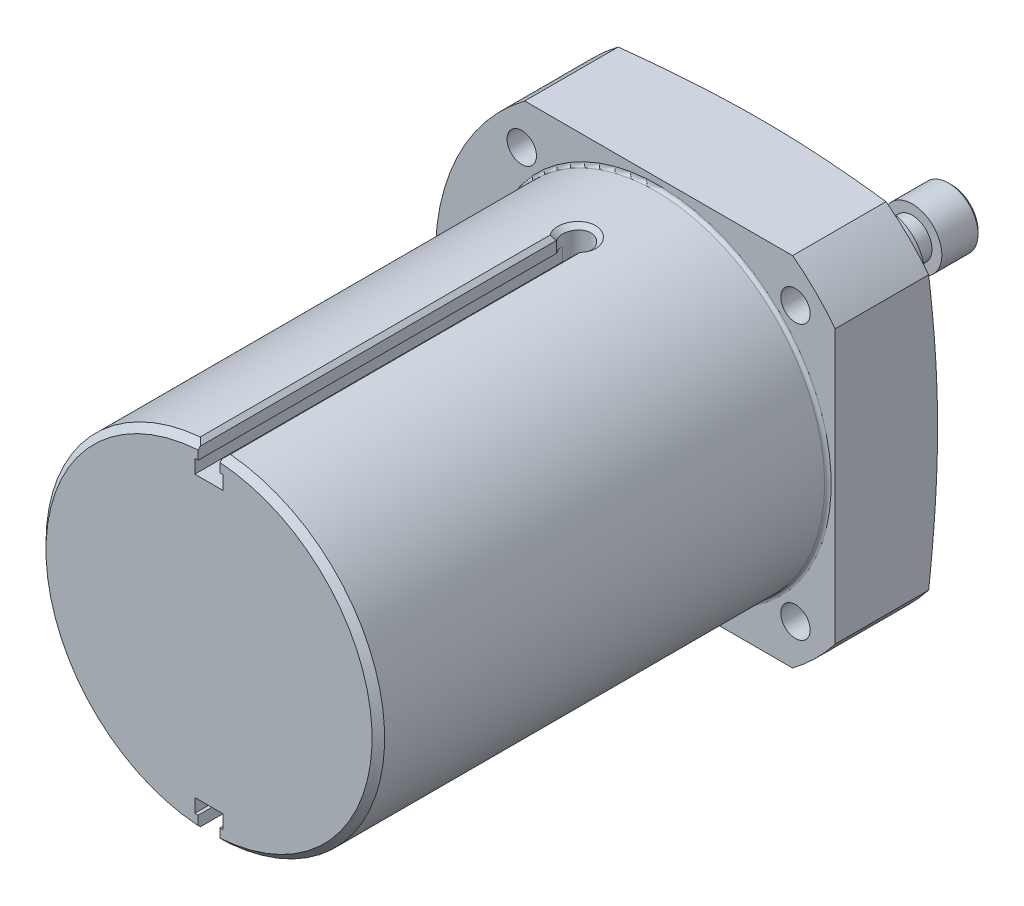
ISO-10303-21;
HEADER;
FILE_DESCRIPTION(('STEP AP214'),'2;1');
FILE_NAME('part.step','',(''),(''),'','','');
FILE_SCHEMA(('AUTOMOTIVE_DESIGN { 1 0 10303 214 1 1 1 1 }'));
ENDSEC;
DATA;
#1=APPLICATION_CONTEXT('core data for automotive mechanical design processes');
#2=APPLICATION_PROTOCOL_DEFINITION('international standard','automotive_design',2000,#1);
#3=PRODUCT_CONTEXT('',#1,'mechanical');
#4=PRODUCT('Part','Part','',(#3));
#5=PRODUCT_RELATED_PRODUCT_CATEGORY('part','',(#4));
#6=PRODUCT_DEFINITION_FORMATION('','',#4);
#7=PRODUCT_DEFINITION_CONTEXT('part definition',#1,'design');
#8=PRODUCT_DEFINITION('design','',#6,#7);
#9=PRODUCT_DEFINITION_SHAPE('','',#8);
#10=(LENGTH_UNIT() NAMED_UNIT(*) SI_UNIT(.MILLI.,.METRE.));
#11=(NAMED_UNIT(*) PLANE_ANGLE_UNIT() SI_UNIT($,.RADIAN.));
#12=(NAMED_UNIT(*) SI_UNIT($,.STERADIAN.) SOLID_ANGLE_UNIT());
#13=UNCERTAINTY_MEASURE_WITH_UNIT(LENGTH_MEASURE(1.E-05),#10,'distance_accuracy_value','');
#14=(GEOMETRIC_REPRESENTATION_CONTEXT(3) GLOBAL_UNCERTAINTY_ASSIGNED_CONTEXT((#13)) GLOBAL_UNIT_ASSIGNED_CONTEXT((#10,
#11,#12)) REPRESENTATION_CONTEXT('',''));
#15=CARTESIAN_POINT('',(0.,0.,0.));
#16=DIRECTION('',(0.,0.,1.));
#17=DIRECTION('',(1.,0.,0.));
#18=AXIS2_PLACEMENT_3D('',#15,#16,#17);
#19=CARTESIAN_POINT('',(9.11225,0.,-24.9968576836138));
#20=DIRECTION('',(0.,0.,1.));
#21=DIRECTION('',(1.,0.,0.));
#22=AXIS2_PLACEMENT_3D('',#19,#20,#21);
#23=PLANE('',#22);
#24=CARTESIAN_POINT('',(0.,0.,-24.9968576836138));
#25=DIRECTION('',(0.,0.,-1.));
#26=DIRECTION('',(-1.,0.,0.));
#27=AXIS2_PLACEMENT_3D('',#24,#25,#26);
#28=CIRCLE('',#27,9.11225);
#29=CARTESIAN_POINT('',(-9.11225,0.,-24.9968576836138));
#30=VERTEX_POINT('',#29);
#31=EDGE_CURVE('E725',#30,#30,#28,.T.);
#32=ORIENTED_EDGE('',*,*,#31,.T.);
#33=EDGE_LOOP('',(#32));
#34=FACE_BOUND('',#33,.T.);
#35=CARTESIAN_POINT('',(0.,0.,-24.9968576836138));
#36=DIRECTION('',(0.,0.,1.));
#37=DIRECTION('',(1.,0.,0.));
#38=AXIS2_PLACEMENT_3D('',#35,#36,#37);
#39=CIRCLE('',#38,4.7625);
#40=CARTESIAN_POINT('',(4.7625,0.,-24.9968576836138));
#41=VERTEX_POINT('',#40);
#42=EDGE_CURVE('E906',#41,#41,#39,.F.);
#43=ORIENTED_EDGE('',*,*,#42,.F.);
#44=EDGE_LOOP('',(#43));
#45=FACE_BOUND('',#44,.T.);
#46=ADVANCED_FACE('F37',(#34,#45),#23,.F.);
#47=CARTESIAN_POINT('',(0.,0.,0.));
#48=DIRECTION('',(0.,0.,1.));
#49=DIRECTION('',(1.,0.,0.));
#50=AXIS2_PLACEMENT_3D('',#47,#48,#49);
#51=PLANE('',#50);
#52=CARTESIAN_POINT('',(0.,0.,0.));
#53=DIRECTION('',(0.,0.,-1.));
#54=DIRECTION('',(-1.,0.,0.));
#55=AXIS2_PLACEMENT_3D('',#52,#53,#54);
#56=CIRCLE('',#55,13.97);
#57=CARTESIAN_POINT('',(-13.97,0.,0.));
#58=VERTEX_POINT('',#57);
#59=EDGE_CURVE('E729',#58,#58,#56,.T.);
#60=ORIENTED_EDGE('',*,*,#59,.T.);
#61=EDGE_LOOP('',(#60));
#62=FACE_BOUND('',#61,.T.);
#63=CARTESIAN_POINT('',(0.,0.,0.));
#64=DIRECTION('',(0.,0.,1.));
#65=DIRECTION('',(1.,0.,0.));
#66=AXIS2_PLACEMENT_3D('',#63,#64,#65);
#67=CIRCLE('',#66,9.51865);
#68=CARTESIAN_POINT('',(9.51865,0.,0.));
#69=VERTEX_POINT('',#68);
#70=EDGE_CURVE('E979',#69,#69,#67,.F.);
#71=ORIENTED_EDGE('',*,*,#70,.F.);
#72=EDGE_LOOP('',(#71));
#73=FACE_BOUND('',#72,.T.);
#74=ADVANCED_FACE('F593',(#62,#73),#51,.F.);
#75=CARTESIAN_POINT('',(0.,0.,138.938));
#76=DIRECTION('',(0.,0.,-1.));
#77=DIRECTION('',(-1.,0.,0.));
#78=AXIS2_PLACEMENT_3D('',#75,#76,#77);
#79=CYLINDRICAL_SURFACE('',#78,53.975);
#80=CARTESIAN_POINT('',(-50.5325210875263,-18.9674705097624,22.3012));
#81=CARTESIAN_POINT('',(-50.5325187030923,-18.9674806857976,22.5348094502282));
#82=CARTESIAN_POINT('',(-50.5255815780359,-18.9859904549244,22.7685794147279));
#83=CARTESIAN_POINT('',(-50.4978945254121,-19.0595056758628,23.2296555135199));
#84=CARTESIAN_POINT('',(-50.4771288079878,-19.1145528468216,23.4569539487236));
#85=CARTESIAN_POINT('',(-50.422045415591,-19.2593854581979,23.8983420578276));
#86=CARTESIAN_POINT('',(-50.3877352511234,-19.3491516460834,24.1124389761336));
#87=CARTESIAN_POINT('',(-50.3060278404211,-19.5605974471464,24.5214516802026));
#88=CARTESIAN_POINT('',(-50.2586334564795,-19.6822700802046,24.7163716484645));
#89=CARTESIAN_POINT('',(-50.1513427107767,-19.9540666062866,25.0819828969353));
#90=CARTESIAN_POINT('',(-50.0914219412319,-20.1042459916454,25.2526257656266));
#91=CARTESIAN_POINT('',(-49.9601222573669,-20.4283458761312,25.5644234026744));
#92=CARTESIAN_POINT('',(-49.8887428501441,-20.6022673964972,25.7055769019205));
#93=CARTESIAN_POINT('',(-49.735769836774,-20.9688640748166,25.95454693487));
#94=CARTESIAN_POINT('',(-49.6541637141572,-21.1615621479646,26.0623220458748));
#95=CARTESIAN_POINT('',(-49.4825465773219,-21.5598045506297,26.241210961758));
#96=CARTESIAN_POINT('',(-49.3925356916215,-21.7653486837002,26.3123253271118));
#97=CARTESIAN_POINT('',(-49.2064537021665,-22.1828229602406,26.4157359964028));
#98=CARTESIAN_POINT('',(-49.1103951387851,-22.3947394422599,26.448110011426));
#99=CARTESIAN_POINT('',(-48.9146017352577,-22.8192239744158,26.473361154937));
#100=CARTESIAN_POINT('',(-48.8148669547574,-23.0317920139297,26.4662389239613));
#101=CARTESIAN_POINT('',(-48.6148214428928,-23.4510899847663,26.4127634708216));
#102=CARTESIAN_POINT('',(-48.5145123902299,-23.6578313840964,26.3664938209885));
#103=CARTESIAN_POINT('',(-48.3162170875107,-24.060218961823,26.2361668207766));
#104=CARTESIAN_POINT('',(-48.2182308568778,-24.2558650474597,26.152109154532));
#105=CARTESIAN_POINT('',(-48.0277068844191,-24.6309631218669,25.9484985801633));
#106=CARTESIAN_POINT('',(-47.9351750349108,-24.8103977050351,25.8289080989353));
#107=CARTESIAN_POINT('',(-47.7588823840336,-25.1480838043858,25.5576539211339));
#108=CARTESIAN_POINT('',(-47.6751217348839,-25.306334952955,25.405989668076));
#109=CARTESIAN_POINT('',(-47.5192056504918,-25.59791373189,25.0744217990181));
#110=CARTESIAN_POINT('',(-47.447081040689,-25.7311753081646,24.8944455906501));
#111=CARTESIAN_POINT('',(-47.3174352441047,-25.9688145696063,24.5116160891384));
#112=CARTESIAN_POINT('',(-47.2599140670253,-26.073192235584,24.3087627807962));
#113=CARTESIAN_POINT('',(-47.1617245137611,-26.2503843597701,23.8858877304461));
#114=CARTESIAN_POINT('',(-47.1210578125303,-26.3231956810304,23.6658642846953));
#115=CARTESIAN_POINT('',(-47.0582249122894,-26.4353600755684,23.2149179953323));
#116=CARTESIAN_POINT('',(-47.0360583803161,-26.4747137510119,22.9839953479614));
#117=CARTESIAN_POINT('',(-47.011166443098,-26.5188896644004,22.5184428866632));
#118=CARTESIAN_POINT('',(-47.0083910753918,-26.5238006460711,22.2838241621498));
#119=CARTESIAN_POINT('',(-47.0222631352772,-26.4991997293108,21.8169796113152));
#120=CARTESIAN_POINT('',(-47.0389104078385,-26.4696881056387,21.5847537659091));
#121=CARTESIAN_POINT('',(-47.090913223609,-26.3770601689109,21.1295771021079));
#122=CARTESIAN_POINT('',(-47.1262457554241,-26.3139851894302,20.9066152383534));
#123=CARTESIAN_POINT('',(-47.214183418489,-26.1558720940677,20.4759538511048));
#124=CARTESIAN_POINT('',(-47.2667887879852,-26.060833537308,20.2682545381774));
#125=CARTESIAN_POINT('',(-47.3873310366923,-25.8409978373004,19.8735488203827));
#126=CARTESIAN_POINT('',(-47.4552989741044,-25.7161403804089,19.6865854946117));
#127=CARTESIAN_POINT('',(-47.6039124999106,-25.4399815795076,19.339093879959));
#128=CARTESIAN_POINT('',(-47.684558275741,-25.2886798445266,19.1785659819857));
#129=CARTESIAN_POINT('',(-47.8557455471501,-24.9632141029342,18.8881565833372));
#130=CARTESIAN_POINT('',(-47.9463077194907,-24.7890021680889,18.7583409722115));
#131=CARTESIAN_POINT('',(-48.1339814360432,-24.4225872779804,18.5334928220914));
#132=CARTESIAN_POINT('',(-48.2310929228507,-24.2303844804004,18.4384599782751));
#133=CARTESIAN_POINT('',(-48.4284833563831,-23.8334149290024,18.2859886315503));
#134=CARTESIAN_POINT('',(-48.5287587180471,-23.6286621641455,18.2285090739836));
#135=CARTESIAN_POINT('',(-48.7293906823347,-23.2120773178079,18.1526416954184));
#136=CARTESIAN_POINT('',(-48.8297472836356,-23.0002453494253,18.1342532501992));
#137=CARTESIAN_POINT('',(-49.0273089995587,-22.5760537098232,18.1370969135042));
#138=CARTESIAN_POINT('',(-49.1245216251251,-22.3636968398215,18.158226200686));
#139=CARTESIAN_POINT('',(-49.3134319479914,-21.9439977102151,18.2392915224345));
#140=CARTESIAN_POINT('',(-49.4051296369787,-21.7366554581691,18.2992276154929));
#141=CARTESIAN_POINT('',(-49.5807546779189,-21.3330230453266,18.4561799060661));
#142=CARTESIAN_POINT('',(-49.6646823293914,-21.1367324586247,18.5531946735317));
#143=CARTESIAN_POINT('',(-49.8229312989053,-20.7609671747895,18.7815381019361));
#144=CARTESIAN_POINT('',(-49.8972528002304,-20.5814921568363,18.9128661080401));
#145=CARTESIAN_POINT('',(-50.0350238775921,-20.2442666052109,19.2064931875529));
#146=CARTESIAN_POINT('',(-50.0984461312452,-20.0865708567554,19.3688679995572));
#147=CARTESIAN_POINT('',(-50.2131208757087,-19.798163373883,19.7198500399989));
#148=CARTESIAN_POINT('',(-50.2643704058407,-19.6674582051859,19.9084636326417));
#149=CARTESIAN_POINT('',(-50.3539744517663,-19.4369044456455,20.3068855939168));
#150=CARTESIAN_POINT('',(-50.3923073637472,-19.3371075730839,20.5167287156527));
#151=CARTESIAN_POINT('',(-50.4554014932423,-19.1718799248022,20.9512540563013));
#152=CARTESIAN_POINT('',(-50.4801784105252,-19.1064093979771,21.1759187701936));
#153=CARTESIAN_POINT('',(-50.5095167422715,-19.0286712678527,21.5518044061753));
#154=CARTESIAN_POINT('',(-50.5181375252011,-19.005753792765,21.7006036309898));
#155=CARTESIAN_POINT('',(-50.5296404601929,-18.9751501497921,21.9999796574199));
#156=CARTESIAN_POINT('',(-50.5325226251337,-18.9674639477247,22.1505564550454));
#157=CARTESIAN_POINT('',(-50.5325210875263,-18.9674705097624,22.3012));
#158=B_SPLINE_CURVE_WITH_KNOTS('',3,(#80,#81,#82,#83,#84,#85,#86,#87,#88,#89,#90,#91,#92,#93,
#94,#95,#96,#97,#98,#99,#100,#101,#102,#103,#104,#105,#106,#107,#108,#109,#110,#111,#112,#113,
#114,#115,#116,#117,#118,#119,#120,#121,#122,#123,#124,#125,#126,#127,#128,#129,#130,#131,#132,
#133,#134,#135,#136,#137,#138,#139,#140,#141,#142,#143,#144,#145,#146,#147,#148,#149,#150,#151,
#152,#153,#154,#155,#156,#157),.UNSPECIFIED.,.T.,.F.,(4,2,2,2,2,2,2,2,2,2,2,2,2,2,2,2,2,2,2,2,2,
2,2,2,2,2,2,2,2,2,2,2,2,2,2,2,2,2,4),(0.,0.70027835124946,1.40135767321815,2.10204878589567,
2.80258673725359,3.50450263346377,4.20644873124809,4.90926248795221,5.61206549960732,
6.31345634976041,7.01483582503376,7.71472175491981,8.41461353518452,9.11524804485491,
9.8158947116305,10.5183680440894,11.2208418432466,11.9233854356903,12.6259163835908,
13.3266365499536,14.027351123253,14.7272047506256,15.427068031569,16.1283590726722,
16.8296604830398,17.5324530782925,18.2352395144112,18.9372563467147,19.6392619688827,
20.3394435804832,21.0396262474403,21.7397819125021,22.43992421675,23.1417968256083,
23.8438399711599,24.5470515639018,25.2494470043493,25.701023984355,26.152599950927),.UNSPECIFIED.);
#159=CARTESIAN_POINT('',(-50.5325210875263,-18.9674705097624,22.3012));
#160=VERTEX_POINT('',#159);
#161=EDGE_CURVE('E775',#160,#160,#158,.T.);
#162=ORIENTED_EDGE('',*,*,#161,.T.);
#163=EDGE_LOOP('',(#162));
#164=FACE_BOUND('',#163,.T.);
#165=CARTESIAN_POINT('',(-50.5325210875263,18.9674705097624,22.3012));
#166=CARTESIAN_POINT('',(-50.5325187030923,18.9674806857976,22.0675905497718));
#167=CARTESIAN_POINT('',(-50.5255815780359,18.9859904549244,21.8338205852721));
#168=CARTESIAN_POINT('',(-50.4978945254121,19.0595056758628,21.3727444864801));
#169=CARTESIAN_POINT('',(-50.4771288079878,19.1145528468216,21.1454460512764));
#170=CARTESIAN_POINT('',(-50.422045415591,19.2593854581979,20.7040579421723));
#171=CARTESIAN_POINT('',(-50.3877352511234,19.3491516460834,20.4899610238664));
#172=CARTESIAN_POINT('',(-50.3060278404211,19.5605974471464,20.0809483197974));
#173=CARTESIAN_POINT('',(-50.2586334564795,19.6822700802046,19.8860283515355));
#174=CARTESIAN_POINT('',(-50.1513427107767,19.9540666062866,19.5204171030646));
#175=CARTESIAN_POINT('',(-50.0914219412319,20.1042459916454,19.3497742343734));
#176=CARTESIAN_POINT('',(-49.9601222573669,20.4283458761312,19.0379765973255));
#177=CARTESIAN_POINT('',(-49.8887428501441,20.6022673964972,18.8968230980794));
#178=CARTESIAN_POINT('',(-49.735769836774,20.9688640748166,18.64785306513));
#179=CARTESIAN_POINT('',(-49.6541637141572,21.1615621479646,18.5400779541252));
#180=CARTESIAN_POINT('',(-49.4825465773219,21.5598045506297,18.361189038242));
#181=CARTESIAN_POINT('',(-49.3925356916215,21.7653486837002,18.2900746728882));
#182=CARTESIAN_POINT('',(-49.2064537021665,22.1828229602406,18.1866640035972));
#183=CARTESIAN_POINT('',(-49.1103951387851,22.3947394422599,18.154289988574));
#184=CARTESIAN_POINT('',(-48.9146017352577,22.8192239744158,18.1290388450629));
#185=CARTESIAN_POINT('',(-48.8148669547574,23.0317920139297,18.1361610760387));
#186=CARTESIAN_POINT('',(-48.6148214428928,23.4510899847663,18.1896365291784));
#187=CARTESIAN_POINT('',(-48.5145123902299,23.6578313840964,18.2359061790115));
#188=CARTESIAN_POINT('',(-48.3162170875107,24.060218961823,18.3662331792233));
#189=CARTESIAN_POINT('',(-48.2182308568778,24.2558650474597,18.4502908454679));
#190=CARTESIAN_POINT('',(-48.0277068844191,24.6309631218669,18.6539014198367));
#191=CARTESIAN_POINT('',(-47.9351750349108,24.8103977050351,18.7734919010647));
#192=CARTESIAN_POINT('',(-47.7588823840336,25.1480838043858,19.0447460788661));
#193=CARTESIAN_POINT('',(-47.6751217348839,25.306334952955,19.1964103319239));
#194=CARTESIAN_POINT('',(-47.5192056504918,25.59791373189,19.5279782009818));
#195=CARTESIAN_POINT('',(-47.447081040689,25.7311753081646,19.7079544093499));
#196=CARTESIAN_POINT('',(-47.3174352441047,25.9688145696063,20.0907839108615));
#197=CARTESIAN_POINT('',(-47.2599140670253,26.073192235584,20.2936372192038));
#198=CARTESIAN_POINT('',(-47.1617245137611,26.2503843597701,20.7165122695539));
#199=CARTESIAN_POINT('',(-47.1210578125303,26.3231956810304,20.9365357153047));
#200=CARTESIAN_POINT('',(-47.0582249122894,26.4353600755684,21.3874820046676));
#201=CARTESIAN_POINT('',(-47.0360583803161,26.4747137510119,21.6184046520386));
#202=CARTESIAN_POINT('',(-47.011166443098,26.5188896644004,22.0839571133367));
#203=CARTESIAN_POINT('',(-47.0083910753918,26.5238006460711,22.3185758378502));
#204=CARTESIAN_POINT('',(-47.0222631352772,26.4991997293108,22.7854203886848));
#205=CARTESIAN_POINT('',(-47.0389104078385,26.4696881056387,23.0176462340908));
#206=CARTESIAN_POINT('',(-47.090913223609,26.3770601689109,23.472822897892));
#207=CARTESIAN_POINT('',(-47.1262457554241,26.3139851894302,23.6957847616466));
#208=CARTESIAN_POINT('',(-47.214183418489,26.1558720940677,24.1264461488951));
#209=CARTESIAN_POINT('',(-47.2667887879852,26.060833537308,24.3341454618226));
#210=CARTESIAN_POINT('',(-47.3873310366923,25.8409978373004,24.7288511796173));
#211=CARTESIAN_POINT('',(-47.4552989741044,25.7161403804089,24.9158145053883));
#212=CARTESIAN_POINT('',(-47.6039124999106,25.4399815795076,25.263306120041));
#213=CARTESIAN_POINT('',(-47.684558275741,25.2886798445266,25.4238340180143));
#214=CARTESIAN_POINT('',(-47.8557455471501,24.9632141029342,25.7142434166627));
#215=CARTESIAN_POINT('',(-47.9463077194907,24.7890021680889,25.8440590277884));
#216=CARTESIAN_POINT('',(-48.1339814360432,24.4225872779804,26.0689071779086));
#217=CARTESIAN_POINT('',(-48.2310929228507,24.2303844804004,26.1639400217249));
#218=CARTESIAN_POINT('',(-48.4284833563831,23.8334149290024,26.3164113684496));
#219=CARTESIAN_POINT('',(-48.5287587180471,23.6286621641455,26.3738909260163));
#220=CARTESIAN_POINT('',(-48.7293906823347,23.2120773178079,26.4497583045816));
#221=CARTESIAN_POINT('',(-48.8297472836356,23.0002453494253,26.4681467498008));
#222=CARTESIAN_POINT('',(-49.0273089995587,22.5760537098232,26.4653030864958));
#223=CARTESIAN_POINT('',(-49.1245216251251,22.3636968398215,26.4441737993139));
#224=CARTESIAN_POINT('',(-49.3134319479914,21.9439977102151,26.3631084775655));
#225=CARTESIAN_POINT('',(-49.4051296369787,21.7366554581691,26.303172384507));
#226=CARTESIAN_POINT('',(-49.5807546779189,21.3330230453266,26.1462200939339));
#227=CARTESIAN_POINT('',(-49.6646823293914,21.1367324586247,26.0492053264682));
#228=CARTESIAN_POINT('',(-49.8229312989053,20.7609671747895,25.8208618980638));
#229=CARTESIAN_POINT('',(-49.8972528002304,20.5814921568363,25.6895338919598));
#230=CARTESIAN_POINT('',(-50.0350238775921,20.2442666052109,25.395906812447));
#231=CARTESIAN_POINT('',(-50.0984461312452,20.0865708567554,25.2335320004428));
#232=CARTESIAN_POINT('',(-50.2131208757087,19.798163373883,24.8825499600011));
#233=CARTESIAN_POINT('',(-50.2643704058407,19.6674582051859,24.6939363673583));
#234=CARTESIAN_POINT('',(-50.3539744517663,19.4369044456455,24.2955144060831));
#235=CARTESIAN_POINT('',(-50.3923073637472,19.3371075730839,24.0856712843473));
#236=CARTESIAN_POINT('',(-50.4554014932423,19.1718799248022,23.6511459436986));
#237=CARTESIAN_POINT('',(-50.4801784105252,19.1064093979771,23.4264812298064));
#238=CARTESIAN_POINT('',(-50.5095167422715,19.0286712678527,23.0505955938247));
#239=CARTESIAN_POINT('',(-50.5181375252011,19.005753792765,22.9017963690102));
#240=CARTESIAN_POINT('',(-50.5296404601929,18.9751501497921,22.6024203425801));
#241=CARTESIAN_POINT('',(-50.5325226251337,18.9674639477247,22.4518435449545));
#242=CARTESIAN_POINT('',(-50.5325210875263,18.9674705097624,22.3012));
#243=B_SPLINE_CURVE_WITH_KNOTS('',3,(#165,#166,#167,#168,#169,#170,#171,#172,#173,#174,#175,
#176,#177,#178,#179,#180,#181,#182,#183,#184,#185,#186,#187,#188,#189,#190,#191,#192,#193,#194,
#195,#196,#197,#198,#199,#200,#201,#202,#203,#204,#205,#206,#207,#208,#209,#210,#211,#212,#213,
#214,#215,#216,#217,#218,#219,#220,#221,#222,#223,#224,#225,#226,#227,#228,#229,#230,#231,#232,
#233,#234,#235,#236,#237,#238,#239,#240,#241,#242),.UNSPECIFIED.,.T.,.F.,(4,2,2,2,2,2,2,2,2,2,2,
2,2,2,2,2,2,2,2,2,2,2,2,2,2,2,2,2,2,2,2,2,2,2,2,2,2,2,4),(0.,0.70027835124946,1.40135767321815,
2.10204878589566,2.80258673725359,3.50450263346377,4.20644873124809,4.9092624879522,
5.61206549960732,6.31345634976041,7.01483582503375,7.71472175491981,8.41461353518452,
9.11524804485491,9.8158947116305,10.5183680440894,11.2208418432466,11.9233854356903,
12.6259163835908,13.3266365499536,14.027351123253,14.7272047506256,15.427068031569,
16.1283590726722,16.8296604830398,17.5324530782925,18.2352395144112,18.9372563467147,
19.6392619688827,20.3394435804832,21.0396262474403,21.7397819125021,22.43992421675,
23.1417968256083,23.8438399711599,24.5470515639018,25.2494470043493,25.701023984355,
26.152599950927),.UNSPECIFIED.);
#244=CARTESIAN_POINT('',(-50.5325210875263,18.9674705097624,22.3012));
#245=VERTEX_POINT('',#244);
#246=EDGE_CURVE('E771',#245,#245,#243,.T.);
#247=ORIENTED_EDGE('',*,*,#246,.T.);
#248=EDGE_LOOP('',(#247));
#249=FACE_BOUND('',#248,.T.);
#250=DIRECTION('',(0.,0.,-1.));
#251=VECTOR('',#250,1.);
#252=CARTESIAN_POINT('',(-32.385,43.18,138.938));
#253=LINE('',#252,#251);
#254=CARTESIAN_POINT('',(-32.385,43.18,30.226));
#255=VERTEX_POINT('',#254);
#256=CARTESIAN_POINT('',(-32.385,43.18,7.62));
#257=VERTEX_POINT('',#256);
#258=EDGE_CURVE('E1145',#255,#257,#253,.T.);
#259=ORIENTED_EDGE('',*,*,#258,.T.);
#260=CARTESIAN_POINT('',(0.,0.,7.62));
#261=DIRECTION('',(0.,0.,-1.));
#262=DIRECTION('',(-1.,0.,0.));
#263=AXIS2_PLACEMENT_3D('',#260,#261,#262);
#264=CIRCLE('',#263,53.975);
#265=CARTESIAN_POINT('',(-32.385,-43.18,7.62));
#266=VERTEX_POINT('',#265);
#267=EDGE_CURVE('E614',#266,#257,#264,.T.);
#268=ORIENTED_EDGE('',*,*,#267,.F.);
#269=DIRECTION('',(0.,0.,-1.));
#270=VECTOR('',#269,1.);
#271=CARTESIAN_POINT('',(-32.385,-43.18,138.938));
#272=LINE('',#271,#270);
#273=CARTESIAN_POINT('',(-32.385,-43.18,30.226));
#274=VERTEX_POINT('',#273);
#275=EDGE_CURVE('E1127',#274,#266,#272,.T.);
#276=ORIENTED_EDGE('',*,*,#275,.F.);
#277=CARTESIAN_POINT('',(0.,0.,30.226));
#278=DIRECTION('',(0.,0.,-1.));
#279=DIRECTION('',(-1.,0.,0.));
#280=AXIS2_PLACEMENT_3D('',#277,#278,#279);
#281=CIRCLE('',#280,53.975);
#282=EDGE_CURVE('E1112',#274,#255,#281,.T.);
#283=ORIENTED_EDGE('',*,*,#282,.T.);
#284=EDGE_LOOP('',(#259,#268,#276,#283));
#285=FACE_BOUND('',#284,.T.);
#286=ADVANCED_FACE('F423',(#164,#249,#285),#79,.T.);
#287=CARTESIAN_POINT('',(-32.385,-43.18,138.938));
#288=DIRECTION('',(0.,1.,0.));
#289=DIRECTION('',(0.,0.,1.));
#290=AXIS2_PLACEMENT_3D('',#287,#288,#289);
#291=PLANE('',#290);
#292=ORIENTED_EDGE('',*,*,#275,.T.);
#293=CARTESIAN_POINT('',(-73.4448779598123,-43.18,13.5671970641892));
#294=CARTESIAN_POINT('',(-72.4172752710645,-43.18,13.3984671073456));
#295=CARTESIAN_POINT('',(-71.3895281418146,-43.18,13.2306172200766));
#296=CARTESIAN_POINT('',(-69.3337159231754,-43.18,12.8968685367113));
#297=CARTESIAN_POINT('',(-68.3056508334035,-43.18,12.7309697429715));
#298=CARTESIAN_POINT('',(-65.2209090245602,-43.18,12.2364822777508));
#299=CARTESIAN_POINT('',(-63.1637154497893,-43.18,11.9111074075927));
#300=CARTESIAN_POINT('',(-59.0471959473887,-43.18,11.2707530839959));
#301=CARTESIAN_POINT('',(-56.987869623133,-43.18,10.955776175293));
#302=CARTESIAN_POINT('',(-52.8672833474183,-43.18,10.338737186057));
#303=CARTESIAN_POINT('',(-50.8060234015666,-43.18,10.0366750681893));
#304=CARTESIAN_POINT('',(-46.6884697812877,-43.18,9.44960094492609));
#305=CARTESIAN_POINT('',(-44.6321841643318,-43.18,9.1645326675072));
#306=CARTESIAN_POINT('',(-40.5169512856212,-43.18,8.61419021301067));
#307=CARTESIAN_POINT('',(-38.4580040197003,-43.18,8.34891606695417));
#308=CARTESIAN_POINT('',(-34.3368835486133,-43.18,7.8429950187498));
#309=CARTESIAN_POINT('',(-32.2747100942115,-43.18,7.60235012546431));
#310=CARTESIAN_POINT('',(-29.1789529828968,-43.18,7.26432015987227));
#311=CARTESIAN_POINT('',(-28.1466187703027,-43.18,7.15546649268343));
#312=CARTESIAN_POINT('',(-26.0810657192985,-43.18,6.94624283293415));
#313=CARTESIAN_POINT('',(-25.0478468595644,-43.18,6.84587305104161));
#314=CARTESIAN_POINT('',(-21.9345226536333,-43.18,6.55764607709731));
#315=CARTESIAN_POINT('',(-19.8530702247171,-43.18,6.38403777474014));
#316=CARTESIAN_POINT('',(-15.6868811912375,-43.18,6.08206355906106));
#317=CARTESIAN_POINT('',(-13.60214469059,-43.18,5.95369624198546));
#318=CARTESIAN_POINT('',(-10.4735312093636,-43.18,5.80011516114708));
#319=CARTESIAN_POINT('',(-9.43059132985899,-43.18,5.75542086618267));
#320=CARTESIAN_POINT('',(-7.34422072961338,-43.18,5.679647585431));
#321=CARTESIAN_POINT('',(-6.30079001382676,-43.18,5.64856846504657));
#322=CARTESIAN_POINT('',(-4.21360580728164,-43.18,5.60051978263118));
#323=CARTESIAN_POINT('',(-3.16985231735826,-43.18,5.58355018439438));
#324=CARTESIAN_POINT('',(-1.08220726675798,-43.18,5.56399548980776));
#325=CARTESIAN_POINT('',(-0.0383157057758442,-43.18,5.56141042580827));
#326=CARTESIAN_POINT('',(2.05145940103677,-43.18,5.5706773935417));
#327=CARTESIAN_POINT('',(3.09734282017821,-43.18,5.58255787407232));
#328=CARTESIAN_POINT('',(5.18884750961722,-43.18,5.62060722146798));
#329=CARTESIAN_POINT('',(6.23446878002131,-43.18,5.6467760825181));
#330=CARTESIAN_POINT('',(8.32527961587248,-43.18,5.7129841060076));
#331=CARTESIAN_POINT('',(9.37046917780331,-43.18,5.75302337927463));
#332=CARTESIAN_POINT('',(11.4602486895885,-43.18,5.8463578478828));
#333=CARTESIAN_POINT('',(12.5048386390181,-43.18,5.89965305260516));
#334=CARTESIAN_POINT('',(15.6384084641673,-43.18,6.07835813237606));
#335=CARTESIAN_POINT('',(17.7263423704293,-43.18,6.22255954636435));
#336=CARTESIAN_POINT('',(20.8555869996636,-43.18,6.47111933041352));
#337=CARTESIAN_POINT('',(21.8982313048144,-43.18,6.55934941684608));
#338=CARTESIAN_POINT('',(23.982649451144,-43.18,6.74562744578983));
#339=CARTESIAN_POINT('',(25.0244232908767,-43.18,6.84367540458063));
#340=CARTESIAN_POINT('',(27.3031290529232,-43.18,7.06798275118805));
#341=CARTESIAN_POINT('',(28.5398796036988,-43.18,7.19607824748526));
#342=CARTESIAN_POINT('',(31.0121771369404,-43.18,7.46341156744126));
#343=CARTESIAN_POINT('',(32.2477241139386,-43.18,7.6026494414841));
#344=CARTESIAN_POINT('',(34.7177109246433,-43.18,7.89094594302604));
#345=CARTESIAN_POINT('',(35.952150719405,-43.18,8.04000490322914));
#346=CARTESIAN_POINT('',(38.4199517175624,-43.18,8.34674392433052));
#347=CARTESIAN_POINT('',(39.6533129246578,-43.18,8.50442395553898));
#348=CARTESIAN_POINT('',(42.1192160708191,-43.18,8.82736592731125));
#349=CARTESIAN_POINT('',(43.3517578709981,-43.18,8.99262892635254));
#350=CARTESIAN_POINT('',(45.8159320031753,-43.18,9.32978959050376));
#351=CARTESIAN_POINT('',(47.0475643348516,-43.18,9.50168725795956));
#352=CARTESIAN_POINT('',(50.7411841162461,-43.18,10.026075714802));
#353=CARTESIAN_POINT('',(53.201937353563,-43.18,10.387267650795));
#354=CARTESIAN_POINT('',(58.1218079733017,-43.18,11.1277168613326));
#355=CARTESIAN_POINT('',(60.580924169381,-43.18,11.5069819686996));
#356=CARTESIAN_POINT('',(65.4969623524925,-43.18,12.2795168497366));
#357=CARTESIAN_POINT('',(67.9538843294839,-43.18,12.6727866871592));
#358=CARTESIAN_POINT('',(72.8659667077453,-43.18,13.4703840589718));
#359=CARTESIAN_POINT('',(75.321127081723,-43.18,13.8747117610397));
#360=CARTESIAN_POINT('',(80.2299709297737,-43.18,14.6921938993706));
#361=CARTESIAN_POINT('',(82.6836544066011,-43.18,15.1053483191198));
#362=CARTESIAN_POINT('',(87.5767030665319,-43.18,15.9365618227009));
#363=CARTESIAN_POINT('',(90.0160747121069,-43.18,16.3545829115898));
#364=CARTESIAN_POINT('',(94.8938003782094,-43.18,17.1963903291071));
#365=CARTESIAN_POINT('',(97.3321544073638,-43.18,17.6201766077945));
#366=CARTESIAN_POINT('',(102.208096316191,-43.18,18.4725243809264));
#367=CARTESIAN_POINT('',(104.645684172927,-43.18,18.9010860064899));
#368=CARTESIAN_POINT('',(109.520162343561,-43.18,19.7621889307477));
#369=CARTESIAN_POINT('',(111.957052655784,-43.18,20.1947302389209));
#370=CARTESIAN_POINT('',(119.26016296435,-43.18,21.4961535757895));
#371=CARTESIAN_POINT('',(124.125497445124,-43.18,22.3700057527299));
#372=CARTESIAN_POINT('',(131.422117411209,-43.18,23.6879685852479));
#373=CARTESIAN_POINT('',(133.854054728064,-43.18,24.1284798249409));
#374=CARTESIAN_POINT('',(138.717550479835,-43.18,25.011594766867));
#375=CARTESIAN_POINT('',(141.149108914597,-43.18,25.4541984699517));
#376=CARTESIAN_POINT('',(143.580504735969,-43.18,25.8976947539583));
#377=B_SPLINE_CURVE_WITH_KNOTS('',3,(#293,#294,#295,#296,#297,#298,#299,#300,#301,#302,#303,
#304,#305,#306,#307,#308,#309,#310,#311,#312,#313,#314,#315,#316,#317,#318,#319,#320,#321,#322,
#323,#324,#325,#326,#327,#328,#329,#330,#331,#332,#333,#334,#335,#336,#337,#338,#339,#340,#341,
#342,#343,#344,#345,#346,#347,#348,#349,#350,#351,#352,#353,#354,#355,#356,#357,#358,#359,#360,
#361,#362,#363,#364,#365,#366,#367,#368,#369,#370,#371,#372,#373,#374,#375,#376),.UNSPECIFIED.,
.F.,.F.,(4,2,2,2,2,2,2,2,2,2,2,2,2,2,2,2,2,2,2,2,2,2,2,2,2,2,2,2,2,2,2,2,2,2,2,2,2,2,2,2,2,4),
(0.,3.12408855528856,6.248180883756,12.4964557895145,18.7462486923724,24.9960235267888,
31.2237998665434,37.4515859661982,43.6798796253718,46.794020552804,49.9082387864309,
56.1738584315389,62.4392836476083,65.5708998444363,68.7024850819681,71.8340622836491,
74.965646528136,78.1033994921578,81.2411511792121,84.3789279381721,87.5167069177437,
93.7948034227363,96.9338846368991,100.072971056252,103.803013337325,107.533072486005,
111.263258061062,114.993430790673,118.724125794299,122.454822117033,129.916084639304,
137.380610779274,144.845170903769,152.309844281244,159.77450369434,167.199283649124,
174.623999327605,182.048919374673,189.47385711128,204.30340165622,211.717935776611,
219.132472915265),.UNSPECIFIED.);
#378=CARTESIAN_POINT('',(32.385,-43.18,7.62));
#379=VERTEX_POINT('',#378);
#380=EDGE_CURVE('E632',#266,#379,#377,.T.);
#381=ORIENTED_EDGE('',*,*,#380,.T.);
#382=DIRECTION('',(0.,0.,-1.));
#383=VECTOR('',#382,1.);
#384=CARTESIAN_POINT('',(32.385,-43.18,138.938));
#385=LINE('',#384,#383);
#386=CARTESIAN_POINT('',(32.385,-43.18,30.226));
#387=VERTEX_POINT('',#386);
#388=EDGE_CURVE('E1125',#387,#379,#385,.T.);
#389=ORIENTED_EDGE('',*,*,#388,.F.);
#390=DIRECTION('',(-1.,0.,0.));
#391=VECTOR('',#390,1.);
#392=CARTESIAN_POINT('',(-32.385,-43.18,30.226));
#393=LINE('',#392,#391);
#394=EDGE_CURVE('E1106',#387,#274,#393,.T.);
#395=ORIENTED_EDGE('',*,*,#394,.T.);
#396=EDGE_LOOP('',(#292,#381,#389,#395));
#397=FACE_BOUND('',#396,.T.);
#398=ADVANCED_FACE('F1158',(#397),#291,.F.);
#399=CARTESIAN_POINT('',(0.,0.,138.938));
#400=DIRECTION('',(0.,0.,-1.));
#401=DIRECTION('',(-1.,0.,0.));
#402=AXIS2_PLACEMENT_3D('',#399,#400,#401);
#403=CYLINDRICAL_SURFACE('',#402,53.975);
#404=ORIENTED_EDGE('',*,*,#388,.T.);
#405=CARTESIAN_POINT('',(42.6974,-33.0186713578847,7.62));
#406=VERTEX_POINT('',#405);
#407=EDGE_CURVE('E1124',#406,#379,#264,.T.);
#408=ORIENTED_EDGE('',*,*,#407,.F.);
#409=DIRECTION('',(0.,0.,-1.));
#410=VECTOR('',#409,1.);
#411=CARTESIAN_POINT('',(42.6974,-33.0186713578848,138.938));
#412=LINE('',#411,#410);
#413=CARTESIAN_POINT('',(42.6974,-33.0186713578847,30.226));
#414=VERTEX_POINT('',#413);
#415=EDGE_CURVE('E1118',#414,#406,#412,.T.);
#416=ORIENTED_EDGE('',*,*,#415,.F.);
#417=EDGE_CURVE('E1101',#414,#387,#281,.T.);
#418=ORIENTED_EDGE('',*,*,#417,.T.);
#419=EDGE_LOOP('',(#404,#408,#416,#418));
#420=FACE_BOUND('',#419,.T.);
#421=ADVANCED_FACE('F1123',(#420),#403,.T.);
#422=CARTESIAN_POINT('',(42.6974,33.0186713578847,138.938));
#423=DIRECTION('',(-1.,0.,0.));
#424=DIRECTION('',(0.,0.,1.));
#425=AXIS2_PLACEMENT_3D('',#422,#423,#424);
#426=PLANE('',#425);
#427=ORIENTED_EDGE('',*,*,#415,.T.);
#428=CARTESIAN_POINT('',(42.6974,-73.718646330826,13.5659051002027));
#429=CARTESIAN_POINT('',(42.6974,-72.6951248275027,13.3972053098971));
#430=CARTESIAN_POINT('',(42.6974,-71.6714626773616,13.2293592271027));
#431=CARTESIAN_POINT('',(42.6974,-69.6238286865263,12.8955597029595));
#432=CARTESIAN_POINT('',(42.6974,-68.5998568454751,12.7296062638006));
#433=CARTESIAN_POINT('',(42.6974,-65.5274096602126,12.2348588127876));
#434=CARTESIAN_POINT('',(42.6974,-63.4784307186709,11.9091823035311));
#435=CARTESIAN_POINT('',(42.6974,-59.3784506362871,11.2679228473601));
#436=CARTESIAN_POINT('',(42.6974,-57.3274491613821,10.9523420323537));
#437=CARTESIAN_POINT('',(42.6974,-53.2235569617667,10.3337136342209));
#438=CARTESIAN_POINT('',(42.6974,-51.1706662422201,10.0306660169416));
#439=CARTESIAN_POINT('',(42.6974,-47.0697139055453,9.44114076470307));
#440=CARTESIAN_POINT('',(42.6974,-45.021660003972,9.15460966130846));
#441=CARTESIAN_POINT('',(42.6974,-40.9229348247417,8.60079447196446));
#442=CARTESIAN_POINT('',(42.6974,-38.8722635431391,8.33351041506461));
#443=CARTESIAN_POINT('',(42.6974,-34.7677048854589,7.82293278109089));
#444=CARTESIAN_POINT('',(42.6974,-32.713817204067,7.57964164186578));
#445=CARTESIAN_POINT('',(42.6974,-28.6026876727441,7.12291540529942));
#446=CARTESIAN_POINT('',(42.6974,-26.5454458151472,6.90948037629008));
#447=CARTESIAN_POINT('',(42.6974,-22.4150594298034,6.51809379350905));
#448=CARTESIAN_POINT('',(42.6974,-20.3418937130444,6.34036354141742));
#449=CARTESIAN_POINT('',(42.6974,-16.1921591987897,6.02948273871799));
#450=CARTESIAN_POINT('',(42.6974,-14.1155904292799,5.8963318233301));
#451=CARTESIAN_POINT('',(42.6974,-10.9991837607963,5.73524343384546));
#452=CARTESIAN_POINT('',(42.6974,-9.96032461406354,5.68799239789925));
#453=CARTESIAN_POINT('',(42.6974,-7.88207217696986,5.60703324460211));
#454=CARTESIAN_POINT('',(42.6974,-6.84267888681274,5.5733251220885));
#455=CARTESIAN_POINT('',(42.6974,-4.76353755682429,5.51999022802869));
#456=CARTESIAN_POINT('',(42.6974,-3.72378951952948,5.50036335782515));
#457=CARTESIAN_POINT('',(42.6974,-1.64412023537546,5.47551223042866));
#458=CARTESIAN_POINT('',(42.6974,-0.604198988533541,5.47028797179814));
#459=CARTESIAN_POINT('',(42.6974,1.47767163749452,5.47433432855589));
#460=CARTESIAN_POINT('',(42.6974,2.51962096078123,5.48363362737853));
#461=CARTESIAN_POINT('',(42.6974,4.60329029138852,5.51662381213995));
#462=CARTESIAN_POINT('',(42.6974,5.64501029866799,5.54031470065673));
#463=CARTESIAN_POINT('',(42.6974,7.72804501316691,5.60170162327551));
#464=CARTESIAN_POINT('',(42.6974,8.76935971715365,5.63939776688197));
#465=CARTESIAN_POINT('',(42.6974,10.8514092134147,5.72820175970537));
#466=CARTESIAN_POINT('',(42.6974,11.8921440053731,5.77930961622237));
#467=CARTESIAN_POINT('',(42.6974,15.0141955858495,5.95170641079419));
#468=CARTESIAN_POINT('',(42.6974,17.0944872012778,6.09204171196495));
#469=CARTESIAN_POINT('',(42.6974,20.2122733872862,6.33529876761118));
#470=CARTESIAN_POINT('',(42.6974,21.2510992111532,6.42184402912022));
#471=CARTESIAN_POINT('',(42.6974,23.3278764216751,6.60490967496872));
#472=CARTESIAN_POINT('',(42.6974,24.3658278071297,6.7014300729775));
#473=CARTESIAN_POINT('',(42.6974,27.9250499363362,7.04805366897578));
#474=CARTESIAN_POINT('',(42.6974,30.4441700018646,7.32034051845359));
#475=CARTESIAN_POINT('',(42.6974,35.4776230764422,7.90620279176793));
#476=CARTESIAN_POINT('',(42.6974,37.9919558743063,8.21977999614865));
#477=CARTESIAN_POINT('',(42.6974,43.0168507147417,8.87850262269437));
#478=CARTESIAN_POINT('',(42.6974,45.5274121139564,9.2236529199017));
#479=CARTESIAN_POINT('',(42.6974,50.5450498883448,9.93799861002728));
#480=CARTESIAN_POINT('',(42.6974,53.052126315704,10.3071936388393));
#481=CARTESIAN_POINT('',(42.6974,58.0648331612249,11.0642559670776));
#482=CARTESIAN_POINT('',(42.6974,60.5704620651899,11.4521332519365));
#483=CARTESIAN_POINT('',(42.6974,65.5794576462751,12.242228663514));
#484=CARTESIAN_POINT('',(42.6974,68.0828243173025,12.644446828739));
#485=CARTESIAN_POINT('',(42.6974,73.0874887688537,13.4601009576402));
#486=CARTESIAN_POINT('',(42.6974,75.5887867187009,13.8735358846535));
#487=CARTESIAN_POINT('',(42.6974,80.5898828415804,14.7093473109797));
#488=CARTESIAN_POINT('',(42.6974,83.0896810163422,15.1317237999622));
#489=CARTESIAN_POINT('',(42.6974,88.0749890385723,15.981442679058));
#490=CARTESIAN_POINT('',(42.6974,90.5605052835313,16.4087475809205));
#491=CARTESIAN_POINT('',(42.6974,95.5305337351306,17.2691542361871));
#492=CARTESIAN_POINT('',(42.6974,98.0150459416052,17.7022559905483));
#493=CARTESIAN_POINT('',(42.6974,102.983299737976,18.5732431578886));
#494=CARTESIAN_POINT('',(42.6974,105.467041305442,19.0111286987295));
#495=CARTESIAN_POINT('',(42.6974,110.433821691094,19.8908679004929));
#496=CARTESIAN_POINT('',(42.6974,112.916860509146,20.3327215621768));
#497=CARTESIAN_POINT('',(42.6974,117.87870835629,21.2191092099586));
#498=CARTESIAN_POINT('',(42.6974,120.357518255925,21.6636383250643));
#499=CARTESIAN_POINT('',(42.6974,125.314632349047,22.555507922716));
#500=CARTESIAN_POINT('',(42.6974,127.792936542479,23.0028484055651));
#501=CARTESIAN_POINT('',(42.6974,132.749026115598,23.8999093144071));
#502=CARTESIAN_POINT('',(42.6974,135.22681151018,24.3496296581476));
#503=CARTESIAN_POINT('',(42.6974,140.182004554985,25.2511406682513));
#504=CARTESIAN_POINT('',(42.6974,142.659412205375,25.702931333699));
#505=CARTESIAN_POINT('',(42.6974,145.136660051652,26.1555949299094));
#506=B_SPLINE_CURVE_WITH_KNOTS('',3,(#428,#429,#430,#431,#432,#433,#434,#435,#436,#437,#438,
#439,#440,#441,#442,#443,#444,#445,#446,#447,#448,#449,#450,#451,#452,#453,#454,#455,#456,#457,
#458,#459,#460,#461,#462,#463,#464,#465,#466,#467,#468,#469,#470,#471,#472,#473,#474,#475,#476,
#477,#478,#479,#480,#481,#482,#483,#484,#485,#486,#487,#488,#489,#490,#491,#492,#493,#494,#495,
#496,#497,#498,#499,#500,#501,#502,#503,#504,#505),.UNSPECIFIED.,.F.,.F.,(4,2,2,2,2,2,2,2,2,2,2,
2,2,2,2,2,2,2,2,2,2,2,2,2,2,2,2,2,2,2,2,2,2,2,2,2,2,2,4),(0.,3.11199273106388,6.22398906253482,
12.4480670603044,18.6734508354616,24.8988176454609,31.1027460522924,37.3066838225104,
43.5112513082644,49.7158329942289,55.9577591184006,62.1996341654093,65.3193596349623,
68.4390839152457,71.5587863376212,74.6784884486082,77.8043596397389,80.9302313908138,
84.0561275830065,87.1820254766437,93.4364389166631,96.563679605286,99.6909245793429,
107.291793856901,114.892991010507,122.49536381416,130.097621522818,137.703988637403,
145.3103761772,152.916063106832,160.521741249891,168.087671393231,175.653602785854,
183.219736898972,190.785872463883,198.340931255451,205.895990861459,213.450791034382,
221.005587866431),.UNSPECIFIED.);
#507=CARTESIAN_POINT('',(42.6974,33.0186713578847,7.62));
#508=VERTEX_POINT('',#507);
#509=EDGE_CURVE('E612',#406,#508,#506,.T.);
#510=ORIENTED_EDGE('',*,*,#509,.T.);
#511=DIRECTION('',(0.,0.,-1.));
#512=VECTOR('',#511,1.);
#513=CARTESIAN_POINT('',(42.6974,33.0186713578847,138.938));
#514=LINE('',#513,#512);
#515=CARTESIAN_POINT('',(42.6974,33.0186713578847,30.226));
#516=VERTEX_POINT('',#515);
#517=EDGE_CURVE('E1120',#516,#508,#514,.T.);
#518=ORIENTED_EDGE('',*,*,#517,.F.);
#519=DIRECTION('',(0.,-1.,0.));
#520=VECTOR('',#519,1.);
#521=CARTESIAN_POINT('',(42.6974,33.0186713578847,30.226));
#522=LINE('',#521,#520);
#523=EDGE_CURVE('E1103',#516,#414,#522,.T.);
#524=ORIENTED_EDGE('',*,*,#523,.T.);
#525=EDGE_LOOP('',(#427,#510,#518,#524));
#526=FACE_BOUND('',#525,.T.);
#527=ADVANCED_FACE('F1116',(#526),#426,.F.);
#528=CARTESIAN_POINT('',(0.,0.,138.938));
#529=DIRECTION('',(0.,0.,-1.));
#530=DIRECTION('',(-1.,0.,0.));
#531=AXIS2_PLACEMENT_3D('',#528,#529,#530);
#532=CYLINDRICAL_SURFACE('',#531,53.975);
#533=ORIENTED_EDGE('',*,*,#517,.T.);
#534=CARTESIAN_POINT('',(32.385,43.18,7.62));
#535=VERTEX_POINT('',#534);
#536=EDGE_CURVE('E613',#535,#508,#264,.T.);
#537=ORIENTED_EDGE('',*,*,#536,.F.);
#538=DIRECTION('',(0.,0.,-1.));
#539=VECTOR('',#538,1.);
#540=CARTESIAN_POINT('',(32.385,43.18,138.938));
#541=LINE('',#540,#539);
#542=CARTESIAN_POINT('',(32.385,43.18,30.226));
#543=VERTEX_POINT('',#542);
#544=EDGE_CURVE('E1129',#543,#535,#541,.T.);
#545=ORIENTED_EDGE('',*,*,#544,.F.);
#546=EDGE_CURVE('E1111',#543,#516,#281,.T.);
#547=ORIENTED_EDGE('',*,*,#546,.T.);
#548=EDGE_LOOP('',(#533,#537,#545,#547));
#549=FACE_BOUND('',#548,.T.);
#550=ADVANCED_FACE('F601',(#549),#532,.T.);
#551=CARTESIAN_POINT('',(-32.385,43.18,138.938));
#552=DIRECTION('',(0.,-1.,0.));
#553=DIRECTION('',(0.,0.,-1.));
#554=AXIS2_PLACEMENT_3D('',#551,#552,#553);
#555=PLANE('',#554);
#556=ORIENTED_EDGE('',*,*,#544,.T.);
#557=CARTESIAN_POINT('',(-73.4448779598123,43.18,13.5671970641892));
#558=CARTESIAN_POINT('',(-72.4172752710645,43.18,13.3984671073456));
#559=CARTESIAN_POINT('',(-71.3895281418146,43.18,13.2306172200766));
#560=CARTESIAN_POINT('',(-69.3337159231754,43.18,12.8968685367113));
#561=CARTESIAN_POINT('',(-68.3056508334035,43.18,12.7309697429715));
#562=CARTESIAN_POINT('',(-65.2209090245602,43.18,12.2364822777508));
#563=CARTESIAN_POINT('',(-63.1637154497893,43.18,11.9111074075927));
#564=CARTESIAN_POINT('',(-59.0471959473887,43.18,11.2707530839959));
#565=CARTESIAN_POINT('',(-56.987869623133,43.18,10.955776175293));
#566=CARTESIAN_POINT('',(-52.8672833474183,43.18,10.338737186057));
#567=CARTESIAN_POINT('',(-50.8060234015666,43.18,10.0366750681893));
#568=CARTESIAN_POINT('',(-46.6884697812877,43.18,9.44960094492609));
#569=CARTESIAN_POINT('',(-44.6321841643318,43.18,9.1645326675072));
#570=CARTESIAN_POINT('',(-40.5169512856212,43.18,8.61419021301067));
#571=CARTESIAN_POINT('',(-38.4580040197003,43.18,8.34891606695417));
#572=CARTESIAN_POINT('',(-34.3368835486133,43.18,7.8429950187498));
#573=CARTESIAN_POINT('',(-32.2747100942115,43.18,7.60235012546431));
#574=CARTESIAN_POINT('',(-29.1789529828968,43.18,7.26432015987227));
#575=CARTESIAN_POINT('',(-28.1466187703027,43.18,7.15546649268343));
#576=CARTESIAN_POINT('',(-26.0810657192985,43.18,6.94624283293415));
#577=CARTESIAN_POINT('',(-25.0478468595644,43.18,6.84587305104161));
#578=CARTESIAN_POINT('',(-21.9345226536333,43.18,6.55764607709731));
#579=CARTESIAN_POINT('',(-19.8530702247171,43.18,6.38403777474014));
#580=CARTESIAN_POINT('',(-15.6868811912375,43.18,6.08206355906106));
#581=CARTESIAN_POINT('',(-13.60214469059,43.18,5.95369624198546));
#582=CARTESIAN_POINT('',(-10.4735312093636,43.18,5.80011516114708));
#583=CARTESIAN_POINT('',(-9.43059132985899,43.18,5.75542086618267));
#584=CARTESIAN_POINT('',(-7.34422072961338,43.18,5.679647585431));
#585=CARTESIAN_POINT('',(-6.30079001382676,43.18,5.64856846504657));
#586=CARTESIAN_POINT('',(-4.21360580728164,43.18,5.60051978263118));
#587=CARTESIAN_POINT('',(-3.16985231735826,43.18,5.58355018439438));
#588=CARTESIAN_POINT('',(-1.08220726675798,43.18,5.56399548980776));
#589=CARTESIAN_POINT('',(-0.0383157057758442,43.18,5.56141042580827));
#590=CARTESIAN_POINT('',(2.05145940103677,43.18,5.5706773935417));
#591=CARTESIAN_POINT('',(3.09734282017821,43.18,5.58255787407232));
#592=CARTESIAN_POINT('',(5.18884750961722,43.18,5.62060722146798));
#593=CARTESIAN_POINT('',(6.23446878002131,43.18,5.6467760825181));
#594=CARTESIAN_POINT('',(8.32527961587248,43.18,5.7129841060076));
#595=CARTESIAN_POINT('',(9.37046917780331,43.18,5.75302337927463));
#596=CARTESIAN_POINT('',(11.4602486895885,43.18,5.8463578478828));
#597=CARTESIAN_POINT('',(12.5048386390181,43.18,5.89965305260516));
#598=CARTESIAN_POINT('',(15.6384084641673,43.18,6.07835813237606));
#599=CARTESIAN_POINT('',(17.7263423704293,43.18,6.22255954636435));
#600=CARTESIAN_POINT('',(20.8555869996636,43.18,6.47111933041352));
#601=CARTESIAN_POINT('',(21.8982313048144,43.18,6.55934941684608));
#602=CARTESIAN_POINT('',(23.982649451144,43.18,6.74562744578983));
#603=CARTESIAN_POINT('',(25.0244232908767,43.18,6.84367540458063));
#604=CARTESIAN_POINT('',(27.3031290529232,43.18,7.06798275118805));
#605=CARTESIAN_POINT('',(28.5398796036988,43.18,7.19607824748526));
#606=CARTESIAN_POINT('',(31.0121771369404,43.18,7.46341156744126));
#607=CARTESIAN_POINT('',(32.2477241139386,43.18,7.6026494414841));
#608=CARTESIAN_POINT('',(34.7177109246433,43.18,7.89094594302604));
#609=CARTESIAN_POINT('',(35.952150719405,43.18,8.04000490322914));
#610=CARTESIAN_POINT('',(38.4199517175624,43.18,8.34674392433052));
#611=CARTESIAN_POINT('',(39.6533129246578,43.18,8.50442395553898));
#612=CARTESIAN_POINT('',(42.1192160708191,43.18,8.82736592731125));
#613=CARTESIAN_POINT('',(43.3517578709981,43.18,8.99262892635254));
#614=CARTESIAN_POINT('',(45.8159320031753,43.18,9.32978959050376));
#615=CARTESIAN_POINT('',(47.0475643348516,43.18,9.50168725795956));
#616=CARTESIAN_POINT('',(50.7411841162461,43.18,10.026075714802));
#617=CARTESIAN_POINT('',(53.201937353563,43.18,10.387267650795));
#618=CARTESIAN_POINT('',(58.1218079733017,43.18,11.1277168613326));
#619=CARTESIAN_POINT('',(60.580924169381,43.18,11.5069819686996));
#620=CARTESIAN_POINT('',(65.4969623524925,43.18,12.2795168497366));
#621=CARTESIAN_POINT('',(67.9538843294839,43.18,12.6727866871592));
#622=CARTESIAN_POINT('',(72.8659667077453,43.18,13.4703840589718));
#623=CARTESIAN_POINT('',(75.321127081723,43.18,13.8747117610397));
#624=CARTESIAN_POINT('',(80.2299709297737,43.18,14.6921938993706));
#625=CARTESIAN_POINT('',(82.6836544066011,43.18,15.1053483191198));
#626=CARTESIAN_POINT('',(87.5767030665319,43.18,15.9365618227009));
#627=CARTESIAN_POINT('',(90.0160747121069,43.18,16.3545829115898));
#628=CARTESIAN_POINT('',(94.8938003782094,43.18,17.1963903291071));
#629=CARTESIAN_POINT('',(97.3321544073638,43.18,17.6201766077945));
#630=CARTESIAN_POINT('',(102.208096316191,43.18,18.4725243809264));
#631=CARTESIAN_POINT('',(104.645684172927,43.18,18.9010860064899));
#632=CARTESIAN_POINT('',(109.520162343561,43.18,19.7621889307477));
#633=CARTESIAN_POINT('',(111.957052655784,43.18,20.1947302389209));
#634=CARTESIAN_POINT('',(119.26016296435,43.18,21.4961535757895));
#635=CARTESIAN_POINT('',(124.125497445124,43.18,22.3700057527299));
#636=CARTESIAN_POINT('',(131.422117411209,43.18,23.6879685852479));
#637=CARTESIAN_POINT('',(133.854054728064,43.18,24.1284798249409));
#638=CARTESIAN_POINT('',(138.717550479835,43.18,25.011594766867));
#639=CARTESIAN_POINT('',(141.149108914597,43.18,25.4541984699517));
#640=CARTESIAN_POINT('',(143.580504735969,43.18,25.8976947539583));
#641=B_SPLINE_CURVE_WITH_KNOTS('',3,(#557,#558,#559,#560,#561,#562,#563,#564,#565,#566,#567,
#568,#569,#570,#571,#572,#573,#574,#575,#576,#577,#578,#579,#580,#581,#582,#583,#584,#585,#586,
#587,#588,#589,#590,#591,#592,#593,#594,#595,#596,#597,#598,#599,#600,#601,#602,#603,#604,#605,
#606,#607,#608,#609,#610,#611,#612,#613,#614,#615,#616,#617,#618,#619,#620,#621,#622,#623,#624,
#625,#626,#627,#628,#629,#630,#631,#632,#633,#634,#635,#636,#637,#638,#639,#640),.UNSPECIFIED.,
.F.,.F.,(4,2,2,2,2,2,2,2,2,2,2,2,2,2,2,2,2,2,2,2,2,2,2,2,2,2,2,2,2,2,2,2,2,2,2,2,2,2,2,2,2,4),
(0.,3.12408855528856,6.248180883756,12.4964557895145,18.7462486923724,24.9960235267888,
31.2237998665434,37.4515859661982,43.6798796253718,46.794020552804,49.9082387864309,
56.1738584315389,62.4392836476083,65.5708998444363,68.7024850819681,71.8340622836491,
74.965646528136,78.1033994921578,81.2411511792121,84.3789279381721,87.5167069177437,
93.7948034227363,96.9338846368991,100.072971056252,103.803013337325,107.533072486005,
111.263258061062,114.993430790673,118.724125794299,122.454822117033,129.916084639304,
137.380610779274,144.845170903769,152.309844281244,159.77450369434,167.199283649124,
174.623999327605,182.048919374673,189.47385711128,204.30340165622,211.717935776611,
219.132472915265),.UNSPECIFIED.);
#642=EDGE_CURVE('E605',#535,#257,#641,.F.);
#643=ORIENTED_EDGE('',*,*,#642,.T.);
#644=ORIENTED_EDGE('',*,*,#258,.F.);
#645=DIRECTION('',(1.,0.,0.));
#646=VECTOR('',#645,1.);
#647=CARTESIAN_POINT('',(-32.385,43.18,30.226));
#648=LINE('',#647,#646);
#649=EDGE_CURVE('E1135',#255,#543,#648,.T.);
#650=ORIENTED_EDGE('',*,*,#649,.T.);
#651=EDGE_LOOP('',(#556,#643,#644,#650));
#652=FACE_BOUND('',#651,.T.);
#653=ADVANCED_FACE('F597',(#652),#555,.F.);
#654=CARTESIAN_POINT('',(-53.975,0.,30.226));
#655=DIRECTION('',(0.,0.,-1.));
#656=DIRECTION('',(-1.,0.,0.));
#657=AXIS2_PLACEMENT_3D('',#654,#655,#656);
#658=PLANE('',#657);
#659=CARTESIAN_POINT('',(0.,0.,30.226));
#660=DIRECTION('',(0.,0.,-1.));
#661=DIRECTION('',(-1.,0.,0.));
#662=AXIS2_PLACEMENT_3D('',#659,#660,#661);
#663=CIRCLE('',#662,41.7322);
#664=CARTESIAN_POINT('',(-41.7322,0.,30.226));
#665=VERTEX_POINT('',#664);
#666=EDGE_CURVE('E889',#665,#665,#663,.T.);
#667=ORIENTED_EDGE('',*,*,#666,.T.);
#668=EDGE_LOOP('',(#667));
#669=FACE_BOUND('',#668,.T.);
#670=CARTESIAN_POINT('',(-33.0922438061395,33.0922438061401,30.226));
#671=DIRECTION('',(0.,0.,-1.));
#672=DIRECTION('',(-1.,0.,0.));
#673=AXIS2_PLACEMENT_3D('',#670,#671,#672);
#674=CIRCLE('',#673,3.55600000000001);
#675=CARTESIAN_POINT('',(-36.6482438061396,33.0922438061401,30.226));
#676=VERTEX_POINT('',#675);
#677=EDGE_CURVE('E762',#676,#676,#674,.T.);
#678=ORIENTED_EDGE('',*,*,#677,.T.);
#679=EDGE_LOOP('',(#678));
#680=FACE_BOUND('',#679,.T.);
#681=CARTESIAN_POINT('',(-33.09224380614,-33.0922438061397,30.226));
#682=DIRECTION('',(0.,0.,-1.));
#683=DIRECTION('',(-1.,0.,0.));
#684=AXIS2_PLACEMENT_3D('',#681,#682,#683);
#685=CIRCLE('',#684,3.55600000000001);
#686=CARTESIAN_POINT('',(-36.64824380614,-33.0922438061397,30.226));
#687=VERTEX_POINT('',#686);
#688=EDGE_CURVE('E656',#687,#687,#685,.T.);
#689=ORIENTED_EDGE('',*,*,#688,.T.);
#690=EDGE_LOOP('',(#689));
#691=FACE_BOUND('',#690,.T.);
#692=CARTESIAN_POINT('',(33.0922438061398,-33.0922438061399,30.226));
#693=DIRECTION('',(0.,0.,-1.));
#694=DIRECTION('',(-1.,0.,0.));
#695=AXIS2_PLACEMENT_3D('',#692,#693,#694);
#696=CIRCLE('',#695,3.55600000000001);
#697=CARTESIAN_POINT('',(29.5362438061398,-33.0922438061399,30.226));
#698=VERTEX_POINT('',#697);
#699=EDGE_CURVE('E746',#698,#698,#696,.T.);
#700=ORIENTED_EDGE('',*,*,#699,.T.);
#701=EDGE_LOOP('',(#700));
#702=FACE_BOUND('',#701,.T.);
#703=CARTESIAN_POINT('',(33.0922438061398,33.0922438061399,30.226));
#704=DIRECTION('',(0.,0.,-1.));
#705=DIRECTION('',(-1.,0.,0.));
#706=AXIS2_PLACEMENT_3D('',#703,#704,#705);
#707=CIRCLE('',#706,3.55600000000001);
#708=CARTESIAN_POINT('',(29.5362438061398,33.0922438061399,30.226));
#709=VERTEX_POINT('',#708);
#710=EDGE_CURVE('E737',#709,#709,#707,.T.);
#711=ORIENTED_EDGE('',*,*,#710,.T.);
#712=EDGE_LOOP('',(#711));
#713=FACE_BOUND('',#712,.T.);
#714=ORIENTED_EDGE('',*,*,#417,.F.);
#715=ORIENTED_EDGE('',*,*,#523,.F.);
#716=ORIENTED_EDGE('',*,*,#546,.F.);
#717=ORIENTED_EDGE('',*,*,#649,.F.);
#718=ORIENTED_EDGE('',*,*,#282,.F.);
#719=ORIENTED_EDGE('',*,*,#394,.F.);
#720=EDGE_LOOP('',(#714,#715,#716,#717,#718,#719));
#721=FACE_BOUND('',#720,.T.);
#722=ADVANCED_FACE('F585',(#669,#680,#691,#702,#713,#721),#658,.F.);
#723=CARTESIAN_POINT('',(0.,0.,0.));
#724=DIRECTION('',(0.,0.,-1.));
#725=DIRECTION('',(-1.,0.,0.));
#726=AXIS2_PLACEMENT_3D('',#723,#724,#725);
#727=CYLINDRICAL_SURFACE('',#726,40.9448);
#728=CARTESIAN_POINT('',(0.,0.,31.0134));
#729=DIRECTION('',(0.,0.,-1.));
#730=DIRECTION('',(-1.,0.,0.));
#731=AXIS2_PLACEMENT_3D('',#728,#729,#730);
#732=CIRCLE('',#731,40.9448);
#733=CARTESIAN_POINT('',(-40.9448,0.,31.0134));
#734=VERTEX_POINT('',#733);
#735=EDGE_CURVE('E892',#734,#734,#732,.F.);
#736=ORIENTED_EDGE('',*,*,#735,.T.);
#737=EDGE_LOOP('',(#736));
#738=FACE_BOUND('',#737,.T.);
#739=CARTESIAN_POINT('',(0.,0.,137.414));
#740=DIRECTION('',(0.,0.,1.));
#741=DIRECTION('',(1.,0.,0.));
#742=AXIS2_PLACEMENT_3D('',#739,#740,#741);
#743=CIRCLE('',#742,40.9448);
#744=CARTESIAN_POINT('',(3.64083593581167,40.7826061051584,137.414));
#745=VERTEX_POINT('',#744);
#746=CARTESIAN_POINT('',(3.6408359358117,-40.7826061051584,137.414));
#747=VERTEX_POINT('',#746);
#748=EDGE_CURVE('E898',#745,#747,#743,.F.);
#749=ORIENTED_EDGE('',*,*,#748,.T.);
#750=DIRECTION('',(0.,0.,-1.));
#751=VECTOR('',#750,1.);
#752=CARTESIAN_POINT('',(3.6408359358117,-40.7826061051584,0.));
#753=LINE('',#752,#751);
#754=CARTESIAN_POINT('',(3.64079347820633,-40.7827132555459,68.5674005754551));
#755=VERTEX_POINT('',#754);
#756=EDGE_CURVE('E573',#747,#755,#753,.T.);
#757=ORIENTED_EDGE('',*,*,#756,.T.);
#758=CARTESIAN_POINT('',(-2.77208071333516,-40.8508533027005,69.3976448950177));
#759=CARTESIAN_POINT('',(-3.54512405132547,-40.7983052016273,68.8358284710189));
#760=CARTESIAN_POINT('',(-4.12369853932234,-40.7378934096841,68.0330226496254));
#761=CARTESIAN_POINT('',(-4.70112806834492,-40.6748145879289,66.2388744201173));
#762=CARTESIAN_POINT('',(-4.69175003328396,-40.675978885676,65.2539971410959));
#763=CARTESIAN_POINT('',(-4.08381792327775,-40.7420534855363,63.4693236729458));
#764=CARTESIAN_POINT('',(-3.48714653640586,-40.8031442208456,62.6772704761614));
#765=CARTESIAN_POINT('',(-1.92581823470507,-40.9073593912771,61.5773025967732));
#766=CARTESIAN_POINT('',(-0.962990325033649,-40.9446314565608,61.2751733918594));
#767=CARTESIAN_POINT('',(0.959704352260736,-40.9449684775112,61.2721762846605));
#768=CARTESIAN_POINT('',(1.92876446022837,-40.9073026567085,61.5778801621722));
#769=CARTESIAN_POINT('',(3.48392556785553,-40.8032191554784,62.6764993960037));
#770=CARTESIAN_POINT('',(4.08370307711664,-40.7420619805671,63.4691833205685));
#771=CARTESIAN_POINT('',(4.69190914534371,-40.6759656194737,65.254267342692));
#772=CARTESIAN_POINT('',(4.7010482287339,-40.6748288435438,66.2394443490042));
#773=CARTESIAN_POINT('',(4.12349890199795,-40.7379094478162,68.033322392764));
#774=CARTESIAN_POINT('',(3.54539100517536,-40.798290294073,68.835772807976));
#775=CARTESIAN_POINT('',(2.77159766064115,-40.850886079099,69.3979978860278));
#776=B_SPLINE_CURVE_WITH_KNOTS('',3,(#758,#759,#760,#761,#762,#763,#764,#765,#766,#767,#768,
#769,#770,#771,#772,#773,#774,#775),.UNSPECIFIED.,.F.,.F.,(4,2,2,2,2,2,2,2,4),
(0.00436171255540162,0.00716833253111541,0.0099749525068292,0.012781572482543,
0.0155881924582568,0.0183948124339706,0.0212014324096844,0.0240080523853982,0.0268146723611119),.UNSPECIFIED.);
#777=CARTESIAN_POINT('',(-3.64071516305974,-40.7826670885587,68.5673037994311));
#778=VERTEX_POINT('',#777);
#779=EDGE_CURVE('E555',#755,#778,#776,.F.);
#780=ORIENTED_EDGE('',*,*,#779,.T.);
#781=DIRECTION('',(0.,0.,-1.));
#782=VECTOR('',#781,1.);
#783=CARTESIAN_POINT('',(-3.6408359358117,-40.7826061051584,0.));
#784=LINE('',#783,#782);
#785=CARTESIAN_POINT('',(-3.6408359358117,-40.7826061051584,137.414));
#786=VERTEX_POINT('',#785);
#787=EDGE_CURVE('E553',#778,#786,#784,.F.);
#788=ORIENTED_EDGE('',*,*,#787,.T.);
#789=CARTESIAN_POINT('',(0.,0.,137.414));
#790=DIRECTION('',(0.,0.,1.));
#791=DIRECTION('',(1.,0.,0.));
#792=AXIS2_PLACEMENT_3D('',#789,#790,#791);
#793=CIRCLE('',#792,40.9448);
#794=CARTESIAN_POINT('',(-3.64083593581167,40.7826061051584,137.414));
#795=VERTEX_POINT('',#794);
#796=EDGE_CURVE('E551',#786,#795,#793,.F.);
#797=ORIENTED_EDGE('',*,*,#796,.T.);
#798=DIRECTION('',(0.,0.,-1.));
#799=VECTOR('',#798,1.);
#800=CARTESIAN_POINT('',(-3.64083593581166,40.7826061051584,0.));
#801=LINE('',#800,#799);
#802=CARTESIAN_POINT('',(-3.64070788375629,40.7827912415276,52.8190060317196));
#803=VERTEX_POINT('',#802);
#804=EDGE_CURVE('E544',#795,#803,#801,.T.);
#805=ORIENTED_EDGE('',*,*,#804,.T.);
#806=CARTESIAN_POINT('',(2.77387021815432,40.8507318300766,53.6483365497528));
#807=CARTESIAN_POINT('',(3.54253466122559,40.7984476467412,53.0877884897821));
#808=CARTESIAN_POINT('',(4.12570081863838,40.7377166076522,52.2824397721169));
#809=CARTESIAN_POINT('',(4.70082012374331,40.6748077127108,50.4881792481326));
#810=CARTESIAN_POINT('',(4.69164930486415,40.6759776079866,49.5040389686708));
#811=CARTESIAN_POINT('',(4.08321292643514,40.7421308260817,47.7212116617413));
#812=CARTESIAN_POINT('',(3.48713133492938,40.8030942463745,46.9297469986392));
#813=CARTESIAN_POINT('',(1.92681046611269,40.9073446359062,45.8295140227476));
#814=CARTESIAN_POINT('',(0.966985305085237,40.9446736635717,45.5268928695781));
#815=CARTESIAN_POINT('',(-0.961510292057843,40.9449261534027,45.5244575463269));
#816=CARTESIAN_POINT('',(-1.92785621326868,40.9073052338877,45.8302463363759));
#817=CARTESIAN_POINT('',(-3.48530165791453,40.8031855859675,46.928462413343));
#818=CARTESIAN_POINT('',(-4.08285798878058,40.7421311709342,47.7211002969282));
#819=CARTESIAN_POINT('',(-4.69243188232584,40.6759311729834,49.5054040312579));
#820=CARTESIAN_POINT('',(-4.70069445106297,40.6748508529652,50.4906488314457));
#821=CARTESIAN_POINT('',(-4.12402262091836,40.7378690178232,52.2855900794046));
#822=CARTESIAN_POINT('',(-3.54344380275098,40.7984179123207,53.0882837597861));
#823=CARTESIAN_POINT('',(-2.77055470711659,40.8509568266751,53.6507598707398));
#824=B_SPLINE_CURVE_WITH_KNOTS('',3,(#806,#807,#808,#809,#810,#811,#812,#813,#814,#815,#816,
#817,#818,#819,#820,#821,#822,#823),.UNSPECIFIED.,.F.,.F.,(4,2,2,2,2,2,2,2,4),
(0.00387225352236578,0.00667921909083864,0.00948618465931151,0.0122931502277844,
0.0151001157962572,0.0179070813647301,0.020714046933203,0.0235210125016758,0.0263279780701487),.UNSPECIFIED.);
#825=CARTESIAN_POINT('',(3.6403235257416,40.7826376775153,52.8183602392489));
#826=VERTEX_POINT('',#825);
#827=EDGE_CURVE('E540',#803,#826,#824,.F.);
#828=ORIENTED_EDGE('',*,*,#827,.T.);
#829=DIRECTION('',(0.,0.,-1.));
#830=VECTOR('',#829,1.);
#831=CARTESIAN_POINT('',(3.64083593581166,40.7826061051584,0.));
#832=LINE('',#831,#830);
#833=EDGE_CURVE('E545',#826,#745,#832,.F.);
#834=ORIENTED_EDGE('',*,*,#833,.T.);
#835=EDGE_LOOP('',(#749,#757,#780,#788,#797,#805,#828,#834));
#836=FACE_BOUND('',#835,.T.);
#837=ADVANCED_FACE('F549',(#738,#836),#727,.T.);
#838=CARTESIAN_POINT('',(0.,0.,138.938));
#839=DIRECTION('',(0.,0.,1.));
#840=DIRECTION('',(1.,0.,0.));
#841=AXIS2_PLACEMENT_3D('',#838,#839,#840);
#842=PLANE('',#841);
#843=DIRECTION('',(0.,-1.,0.));
#844=VECTOR('',#843,1.);
#845=CARTESIAN_POINT('',(-2.64159999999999,0.,138.938));
#846=LINE('',#845,#844);
#847=CARTESIAN_POINT('',(-2.6416,39.3321932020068,138.938));
#848=VERTEX_POINT('',#847);
#849=CARTESIAN_POINT('',(-2.6416,37.1602,138.938));
#850=VERTEX_POINT('',#849);
#851=EDGE_CURVE('E976',#848,#850,#846,.T.);
#852=ORIENTED_EDGE('',*,*,#851,.F.);
#853=CARTESIAN_POINT('',(0.,0.,138.938));
#854=DIRECTION('',(0.,0.,1.));
#855=DIRECTION('',(1.,0.,0.));
#856=AXIS2_PLACEMENT_3D('',#853,#854,#855);
#857=CIRCLE('',#856,39.4207999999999);
#858=CARTESIAN_POINT('',(-2.6416,-39.3321932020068,138.938));
#859=VERTEX_POINT('',#858);
#860=EDGE_CURVE('E411',#848,#859,#857,.T.);
#861=ORIENTED_EDGE('',*,*,#860,.T.);
#862=DIRECTION('',(0.,-1.,0.));
#863=VECTOR('',#862,1.);
#864=CARTESIAN_POINT('',(-2.6416,-37.1602,138.938));
#865=LINE('',#864,#863);
#866=CARTESIAN_POINT('',(-2.6416,-37.1602,138.938));
#867=VERTEX_POINT('',#866);
#868=EDGE_CURVE('E833',#867,#859,#865,.T.);
#869=ORIENTED_EDGE('',*,*,#868,.F.);
#870=DIRECTION('',(1.,0.,0.));
#871=VECTOR('',#870,1.);
#872=CARTESIAN_POINT('',(-3.42899999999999,-37.1602,138.938));
#873=LINE('',#872,#871);
#874=CARTESIAN_POINT('',(-3.42899999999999,-37.1602,138.938));
#875=VERTEX_POINT('',#874);
#876=EDGE_CURVE('E836',#875,#867,#873,.T.);
#877=ORIENTED_EDGE('',*,*,#876,.F.);
#878=DIRECTION('',(0.,-1.,0.));
#879=VECTOR('',#878,1.);
#880=CARTESIAN_POINT('',(-3.42899999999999,-33.8582,138.938));
#881=LINE('',#880,#879);
#882=CARTESIAN_POINT('',(-3.42899999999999,-33.8582,138.938));
#883=VERTEX_POINT('',#882);
#884=EDGE_CURVE('E839',#883,#875,#881,.T.);
#885=ORIENTED_EDGE('',*,*,#884,.F.);
#886=DIRECTION('',(-1.,0.,0.));
#887=VECTOR('',#886,1.);
#888=CARTESIAN_POINT('',(-3.42899999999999,-33.8582,138.938));
#889=LINE('',#888,#887);
#890=CARTESIAN_POINT('',(3.429,-33.8582,138.938));
#891=VERTEX_POINT('',#890);
#892=EDGE_CURVE('E842',#891,#883,#889,.T.);
#893=ORIENTED_EDGE('',*,*,#892,.F.);
#894=DIRECTION('',(0.,1.,0.));
#895=VECTOR('',#894,1.);
#896=CARTESIAN_POINT('',(3.429,-33.8582,138.938));
#897=LINE('',#896,#895);
#898=CARTESIAN_POINT('',(3.429,-37.1602,138.938));
#899=VERTEX_POINT('',#898);
#900=EDGE_CURVE('E845',#899,#891,#897,.T.);
#901=ORIENTED_EDGE('',*,*,#900,.F.);
#902=DIRECTION('',(1.,0.,0.));
#903=VECTOR('',#902,1.);
#904=CARTESIAN_POINT('',(3.429,-37.1602,138.938));
#905=LINE('',#904,#903);
#906=CARTESIAN_POINT('',(2.64160000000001,-37.1602,138.938));
#907=VERTEX_POINT('',#906);
#908=EDGE_CURVE('E829',#907,#899,#905,.T.);
#909=ORIENTED_EDGE('',*,*,#908,.F.);
#910=DIRECTION('',(0.,1.,0.));
#911=VECTOR('',#910,1.);
#912=CARTESIAN_POINT('',(2.64160000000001,0.,138.938));
#913=LINE('',#912,#911);
#914=CARTESIAN_POINT('',(2.64160000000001,-39.3321932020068,138.938));
#915=VERTEX_POINT('',#914);
#916=EDGE_CURVE('E978',#915,#907,#913,.T.);
#917=ORIENTED_EDGE('',*,*,#916,.F.);
#918=CARTESIAN_POINT('',(0.,0.,138.938));
#919=DIRECTION('',(0.,0.,1.));
#920=DIRECTION('',(1.,0.,0.));
#921=AXIS2_PLACEMENT_3D('',#918,#919,#920);
#922=CIRCLE('',#921,39.4207999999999);
#923=CARTESIAN_POINT('',(2.6416,39.3321932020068,138.938));
#924=VERTEX_POINT('',#923);
#925=EDGE_CURVE('E985',#915,#924,#922,.T.);
#926=ORIENTED_EDGE('',*,*,#925,.T.);
#927=DIRECTION('',(0.,1.,0.));
#928=VECTOR('',#927,1.);
#929=CARTESIAN_POINT('',(2.6416,50.8,138.938));
#930=LINE('',#929,#928);
#931=CARTESIAN_POINT('',(2.6416,37.1602,138.938));
#932=VERTEX_POINT('',#931);
#933=EDGE_CURVE('E793',#932,#924,#930,.T.);
#934=ORIENTED_EDGE('',*,*,#933,.F.);
#935=DIRECTION('',(-1.,0.,0.));
#936=VECTOR('',#935,1.);
#937=CARTESIAN_POINT('',(2.6416,37.1602,138.938));
#938=LINE('',#937,#936);
#939=CARTESIAN_POINT('',(3.429,37.1602,138.938));
#940=VERTEX_POINT('',#939);
#941=EDGE_CURVE('E797',#940,#932,#938,.T.);
#942=ORIENTED_EDGE('',*,*,#941,.F.);
#943=DIRECTION('',(0.,1.,0.));
#944=VECTOR('',#943,1.);
#945=CARTESIAN_POINT('',(3.429,37.1602,138.938));
#946=LINE('',#945,#944);
#947=CARTESIAN_POINT('',(3.429,33.8582,138.938));
#948=VERTEX_POINT('',#947);
#949=EDGE_CURVE('E800',#948,#940,#946,.T.);
#950=ORIENTED_EDGE('',*,*,#949,.F.);
#951=DIRECTION('',(1.,0.,0.));
#952=VECTOR('',#951,1.);
#953=CARTESIAN_POINT('',(-3.429,33.8582,138.938));
#954=LINE('',#953,#952);
#955=CARTESIAN_POINT('',(-3.429,33.8582,138.938));
#956=VERTEX_POINT('',#955);
#957=EDGE_CURVE('E803',#956,#948,#954,.T.);
#958=ORIENTED_EDGE('',*,*,#957,.F.);
#959=DIRECTION('',(0.,-1.,0.));
#960=VECTOR('',#959,1.);
#961=CARTESIAN_POINT('',(-3.429,37.1602,138.938));
#962=LINE('',#961,#960);
#963=CARTESIAN_POINT('',(-3.429,37.1602,138.938));
#964=VERTEX_POINT('',#963);
#965=EDGE_CURVE('E806',#964,#956,#962,.T.);
#966=ORIENTED_EDGE('',*,*,#965,.F.);
#967=DIRECTION('',(-1.,0.,0.));
#968=VECTOR('',#967,1.);
#969=CARTESIAN_POINT('',(-2.6416,37.1602,138.938));
#970=LINE('',#969,#968);
#971=EDGE_CURVE('E809',#850,#964,#970,.T.);
#972=ORIENTED_EDGE('',*,*,#971,.F.);
#973=EDGE_LOOP('',(#852,#861,#869,#877,#885,#893,#901,#909,#917,#926,#934,#942,#950,#958,#966,#972));
#974=FACE_BOUND('',#973,.T.);
#975=ADVANCED_FACE('F584',(#974),#842,.T.);
#976=CARTESIAN_POINT('',(0.,0.,7.62));
#977=DIRECTION('',(0.,0.,1.));
#978=DIRECTION('',(1.,0.,0.));
#979=AXIS2_PLACEMENT_3D('',#976,#977,#978);
#980=CONICAL_SURFACE('',#979,53.975,1.38257482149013);
#981=CARTESIAN_POINT('',(-34.6000145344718,27.7510811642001,5.78744195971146));
#982=CARTESIAN_POINT('',(-34.4502070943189,27.7087901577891,5.76014238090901));
#983=CARTESIAN_POINT('',(-34.2985573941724,27.6727890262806,5.73334205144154));
#984=CARTESIAN_POINT('',(-33.9925175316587,27.6136322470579,5.68094481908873));
#985=CARTESIAN_POINT('',(-33.8381267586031,27.59047949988,5.65534818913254));
#986=CARTESIAN_POINT('',(-33.5275977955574,27.5572404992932,5.60556947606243));
#987=CARTESIAN_POINT('',(-33.3714583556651,27.5471642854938,5.5813884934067));
#988=CARTESIAN_POINT('',(-33.0585811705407,27.5402397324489,5.53467201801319));
#989=CARTESIAN_POINT('',(-32.901843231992,27.5433961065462,5.51213711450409));
#990=CARTESIAN_POINT('',(-32.5889324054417,27.5629904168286,5.4689348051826));
#991=CARTESIAN_POINT('',(-32.432759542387,27.5794289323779,5.44826748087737));
#992=CARTESIAN_POINT('',(-32.1220556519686,27.6255446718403,5.40899834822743));
#993=CARTESIAN_POINT('',(-31.9675252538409,27.6552267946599,5.390397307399));
#994=CARTESIAN_POINT('',(-31.6613980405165,27.7276567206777,5.35547237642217));
#995=CARTESIAN_POINT('',(-31.5097994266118,27.7703962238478,5.33914704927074));
#996=CARTESIAN_POINT('',(-31.2105098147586,27.8687119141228,5.30892858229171));
#997=CARTESIAN_POINT('',(-31.0628202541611,27.9242927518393,5.29503632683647));
#998=CARTESIAN_POINT('',(-30.7747628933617,28.0469687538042,5.27003933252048));
#999=CARTESIAN_POINT('',(-30.6343173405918,28.11387330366,5.25889494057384));
#1000=CARTESIAN_POINT('',(-30.3593439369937,28.2593512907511,5.23923944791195));
#1001=CARTESIAN_POINT('',(-30.2248182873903,28.3379290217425,5.23072931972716));
#1002=CARTESIAN_POINT('',(-29.9628037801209,28.5061536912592,5.21644739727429));
#1003=CARTESIAN_POINT('',(-29.8353119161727,28.5957958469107,5.21067442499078));
#1004=CARTESIAN_POINT('',(-29.5882125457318,28.7855708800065,5.20192613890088));
#1005=CARTESIAN_POINT('',(-29.4686079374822,28.8857075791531,5.19895184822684));
#1006=CARTESIAN_POINT('',(-29.2402344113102,29.0938854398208,5.1958662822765));
#1007=CARTESIAN_POINT('',(-29.1313132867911,29.2017589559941,5.1957061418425));
#1008=CARTESIAN_POINT('',(-28.922742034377,29.4261665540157,5.19812581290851));
#1009=CARTESIAN_POINT('',(-28.8230952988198,29.5427037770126,5.20070662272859));
#1010=CARTESIAN_POINT('',(-28.6338588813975,29.78352456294,5.20858062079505));
#1011=CARTESIAN_POINT('',(-28.544265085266,29.9078049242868,5.21387269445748));
#1012=CARTESIAN_POINT('',(-28.3756921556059,30.1632518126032,5.22710657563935));
#1013=CARTESIAN_POINT('',(-28.2967169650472,30.2944208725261,5.23504936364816));
#1014=CARTESIAN_POINT('',(-28.0770828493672,30.6959557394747,5.26267664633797));
#1015=CARTESIAN_POINT('',(-27.9529341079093,30.975346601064,5.28619338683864));
#1016=CARTESIAN_POINT('',(-27.7523357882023,31.5496934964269,5.34245780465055));
#1017=CARTESIAN_POINT('',(-27.6758886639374,31.8446503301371,5.37520595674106));
#1018=CARTESIAN_POINT('',(-27.5715639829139,32.4459419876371,5.44911595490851));
#1019=CARTESIAN_POINT('',(-27.544314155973,32.7523736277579,5.49037915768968));
#1020=CARTESIAN_POINT('',(-27.5405789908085,33.3645658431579,5.57951220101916));
#1021=CARTESIAN_POINT('',(-27.5640988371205,33.6703263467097,5.62738271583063));
#1022=CARTESIAN_POINT('',(-27.6618185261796,34.2791927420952,5.72911827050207));
#1023=CARTESIAN_POINT('',(-27.7370421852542,34.582117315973,5.78308565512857));
#1024=CARTESIAN_POINT('',(-27.9368102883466,35.1705783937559,5.89442684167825));
#1025=CARTESIAN_POINT('',(-28.0613595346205,35.4561132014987,5.95180097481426));
#1026=CARTESIAN_POINT('',(-28.3587272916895,36.0068273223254,6.0692304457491));
#1027=CARTESIAN_POINT('',(-28.5323373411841,36.2715733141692,6.1293148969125));
#1028=CARTESIAN_POINT('',(-28.9219554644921,36.7677854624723,6.24948552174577));
#1029=CARTESIAN_POINT('',(-29.1379657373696,36.9992498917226,6.3095716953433));
#1030=CARTESIAN_POINT('',(-29.6079542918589,37.423761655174,6.42850701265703));
#1031=CARTESIAN_POINT('',(-29.8621756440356,37.6165431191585,6.48734526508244));
#1032=CARTESIAN_POINT('',(-30.4003759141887,37.9560344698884,6.60181792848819));
#1033=CARTESIAN_POINT('',(-30.6843544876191,38.102744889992,6.65745237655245));
#1034=CARTESIAN_POINT('',(-31.2725356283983,38.3449284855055,6.7638319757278));
#1035=CARTESIAN_POINT('',(-31.5766299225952,38.4406542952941,6.81460019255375));
#1036=CARTESIAN_POINT('',(-32.1975903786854,38.5787847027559,6.9102999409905));
#1037=CARTESIAN_POINT('',(-32.5144557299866,38.6211926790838,6.95523184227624));
#1038=CARTESIAN_POINT('',(-33.1475374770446,38.6507913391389,7.03761576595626));
#1039=CARTESIAN_POINT('',(-33.4637090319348,38.6386907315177,7.07515720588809));
#1040=CARTESIAN_POINT('',(-34.090206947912,38.5607969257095,7.14257617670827));
#1041=CARTESIAN_POINT('',(-34.400533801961,38.4950082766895,7.17245435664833));
#1042=CARTESIAN_POINT('',(-35.0015281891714,38.3126990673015,7.22344143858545));
#1043=CARTESIAN_POINT('',(-35.2924213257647,38.1969570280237,7.24467556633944));
#1044=CARTESIAN_POINT('',(-35.8510251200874,37.9180032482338,7.27851333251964));
#1045=CARTESIAN_POINT('',(-36.1187374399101,37.7547949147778,7.29111759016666));
#1046=CARTESIAN_POINT('',(-36.6201606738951,37.3876654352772,7.30730569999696));
#1047=CARTESIAN_POINT('',(-36.8542279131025,37.1842352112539,7.31099184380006));
#1048=CARTESIAN_POINT('',(-37.2852534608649,36.7412881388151,7.30955638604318));
#1049=CARTESIAN_POINT('',(-37.4822131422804,36.5017726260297,7.30443511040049));
#1050=CARTESIAN_POINT('',(-37.8326883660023,35.9946959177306,7.28554979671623));
#1051=CARTESIAN_POINT('',(-37.9863845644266,35.7272579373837,7.27182249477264));
#1052=CARTESIAN_POINT('',(-38.2473019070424,35.1709503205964,7.23605257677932));
#1053=CARTESIAN_POINT('',(-38.3545225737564,34.8820804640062,7.21400987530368));
#1054=CARTESIAN_POINT('',(-38.4785621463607,34.4386421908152,7.17507397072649));
#1055=CARTESIAN_POINT('',(-38.5138206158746,34.2887326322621,7.16107204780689));
#1056=CARTESIAN_POINT('',(-38.5717454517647,33.9866994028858,7.13118727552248));
#1057=CARTESIAN_POINT('',(-38.5944162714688,33.8345765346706,7.11530509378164));
#1058=CARTESIAN_POINT('',(-38.6270556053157,33.5291219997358,7.0817429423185));
#1059=CARTESIAN_POINT('',(-38.6370191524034,33.3757898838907,7.06406227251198));
#1060=CARTESIAN_POINT('',(-38.6442138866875,33.0690839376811,7.027014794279));
#1061=CARTESIAN_POINT('',(-38.6414495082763,32.9157101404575,7.00764857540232));
#1062=CARTESIAN_POINT('',(-38.6231603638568,32.6081308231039,6.96709839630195));
#1063=CARTESIAN_POINT('',(-38.6074863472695,32.4539366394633,6.94589578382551));
#1064=CARTESIAN_POINT('',(-38.5633571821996,32.1476600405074,6.90200317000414));
#1065=CARTESIAN_POINT('',(-38.5349064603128,31.9955769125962,6.87931368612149));
#1066=CARTESIAN_POINT('',(-38.4654612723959,31.6944574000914,6.83256424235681));
#1067=CARTESIAN_POINT('',(-38.4244621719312,31.5454221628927,6.80850377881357));
#1068=CARTESIAN_POINT('',(-38.3302720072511,31.251522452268,6.75916959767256));
#1069=CARTESIAN_POINT('',(-38.277085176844,31.1066565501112,6.73389630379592));
#1070=CARTESIAN_POINT('',(-38.1580258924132,30.8198639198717,6.68188709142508));
#1071=CARTESIAN_POINT('',(-38.0919739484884,30.678014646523,6.65513484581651));
#1072=CARTESIAN_POINT('',(-37.9482466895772,30.4005855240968,6.60069856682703));
#1073=CARTESIAN_POINT('',(-37.8705754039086,30.2650035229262,6.57301485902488));
#1074=CARTESIAN_POINT('',(-37.7041109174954,30.0008923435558,6.51685953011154));
#1075=CARTESIAN_POINT('',(-37.6153104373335,29.8723678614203,6.48838740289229));
#1076=CARTESIAN_POINT('',(-37.4273024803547,29.6233847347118,6.4308622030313));
#1077=CARTESIAN_POINT('',(-37.3280986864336,29.5029232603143,6.40180933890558));
#1078=CARTESIAN_POINT('',(-37.1185015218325,29.2692057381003,6.34288923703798));
#1079=CARTESIAN_POINT('',(-37.0079710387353,29.1560740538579,6.31301629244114));
#1080=CARTESIAN_POINT('',(-36.7777359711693,28.9397162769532,6.25306644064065));
#1081=CARTESIAN_POINT('',(-36.6580346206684,28.8364867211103,6.22298960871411));
#1082=CARTESIAN_POINT('',(-36.4103643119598,28.6406864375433,6.16285286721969));
#1083=CARTESIAN_POINT('',(-36.2824020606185,28.5481072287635,6.13279296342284));
#1084=CARTESIAN_POINT('',(-36.0190650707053,28.3741926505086,6.07289024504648));
#1085=CARTESIAN_POINT('',(-35.8836921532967,28.2928545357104,6.04304737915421));
#1086=CARTESIAN_POINT('',(-35.5638675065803,28.1188152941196,5.97469107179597));
#1087=CARTESIAN_POINT('',(-35.3770976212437,28.0302807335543,5.93632566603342));
#1088=CARTESIAN_POINT('',(-34.9946396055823,27.874493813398,5.86082735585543));
#1089=CARTESIAN_POINT('',(-34.7989514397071,27.8072415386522,5.82369445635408));
#1090=CARTESIAN_POINT('',(-34.6000145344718,27.7510811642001,5.78744195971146));
#1091=B_SPLINE_CURVE_WITH_KNOTS('',3,(#981,#982,#983,#984,#985,#986,#987,#988,#989,#990,#991,
#992,#993,#994,#995,#996,#997,#998,#999,#1000,#1001,#1002,#1003,#1004,#1005,#1006,#1007,#1008,
#1009,#1010,#1011,#1012,#1013,#1014,#1015,#1016,#1017,#1018,#1019,#1020,#1021,#1022,#1023,#1024,
#1025,#1026,#1027,#1028,#1029,#1030,#1031,#1032,#1033,#1034,#1035,#1036,#1037,#1038,#1039,#1040,
#1041,#1042,#1043,#1044,#1045,#1046,#1047,#1048,#1049,#1050,#1051,#1052,#1053,#1054,#1055,#1056,
#1057,#1058,#1059,#1060,#1061,#1062,#1063,#1064,#1065,#1066,#1067,#1068,#1069,#1070,#1071,#1072,
#1073,#1074,#1075,#1076,#1077,#1078,#1079,#1080,#1081,#1082,#1083,#1084,#1085,#1086,#1087,#1088,
#1089,#1090),.UNSPECIFIED.,.T.,.F.,(4,2,2,2,2,2,2,2,2,2,2,2,2,2,2,2,2,2,2,2,2,2,2,2,2,2,2,2,2,2,
2,2,2,2,2,2,2,2,2,2,2,2,2,2,2,2,2,2,2,2,2,2,2,2,4),(0.,0.473937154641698,0.947981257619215,
1.42238909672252,1.89696593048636,2.37156346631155,2.84633670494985,3.32080877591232,
3.79545295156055,4.26278358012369,4.73028653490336,5.19758810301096,5.66506043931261,
6.12440736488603,6.58392165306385,7.04324718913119,7.50274281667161,8.41797977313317,
9.333263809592,10.2601459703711,11.187122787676,12.1330049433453,13.0789792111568,
14.0411845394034,15.0034397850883,15.9720977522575,16.9407445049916,17.9045457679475,
18.8682859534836,19.819532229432,20.7706979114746,21.7075466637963,22.6443281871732,
23.5703127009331,24.4962629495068,25.4182873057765,26.3403211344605,26.8037832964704,
27.267081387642,27.7305605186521,28.1938781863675,28.6626288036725,29.1312171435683,
29.5999787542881,30.0685777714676,30.5442553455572,31.0197683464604,31.4955940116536,
31.9712517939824,32.4535632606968,32.9357054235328,33.4174609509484,33.8990986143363,
34.5284613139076,35.1578265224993),.UNSPECIFIED.);
#1092=CARTESIAN_POINT('',(-34.6000145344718,27.7510811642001,5.78744195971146));
#1093=VERTEX_POINT('',#1092);
#1094=EDGE_CURVE('E657',#1093,#1093,#1091,.T.);
#1095=ORIENTED_EDGE('',*,*,#1094,.T.);
#1096=EDGE_LOOP('',(#1095));
#1097=FACE_BOUND('',#1096,.T.);
#1098=CARTESIAN_POINT('',(-34.6000145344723,-27.7510811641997,5.78744195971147));
#1099=CARTESIAN_POINT('',(-34.7528350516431,-27.7942205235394,5.81529041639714));
#1100=CARTESIAN_POINT('',(-34.9037023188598,-27.8438943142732,5.84365176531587));
#1101=CARTESIAN_POINT('',(-35.200546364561,-27.9559395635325,5.90118150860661));
#1102=CARTESIAN_POINT('',(-35.3465216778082,-28.0183147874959,5.93035014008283));
#1103=CARTESIAN_POINT('',(-35.6326497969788,-28.1553503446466,5.98928480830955));
#1104=CARTESIAN_POINT('',(-35.7727964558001,-28.2300232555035,6.01905142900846));
#1105=CARTESIAN_POINT('',(-36.0461773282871,-28.3910901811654,6.07893806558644));
#1106=CARTESIAN_POINT('',(-36.1794089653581,-28.4774885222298,6.10905820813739));
#1107=CARTESIAN_POINT('',(-36.4378303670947,-28.6612672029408,6.16938834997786));
#1108=CARTESIAN_POINT('',(-36.5630283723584,-28.7586359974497,6.19959822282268));
#1109=CARTESIAN_POINT('',(-36.8046934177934,-28.9637769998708,6.25993610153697));
#1110=CARTESIAN_POINT('',(-36.9211572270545,-29.0715530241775,6.29006407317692));
#1111=CARTESIAN_POINT('',(-37.1443973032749,-29.2966474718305,6.34999975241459));
#1112=CARTESIAN_POINT('',(-37.2511798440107,-29.4139596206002,6.37980765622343));
#1113=CARTESIAN_POINT('',(-37.4544074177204,-29.6574118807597,6.43893406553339));
#1114=CARTESIAN_POINT('',(-37.5508486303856,-29.7835552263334,6.46825238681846));
#1115=CARTESIAN_POINT('',(-37.7327400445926,-30.0438953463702,6.5262284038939));
#1116=CARTESIAN_POINT('',(-37.8181777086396,-30.1781010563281,6.55488531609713));
#1117=CARTESIAN_POINT('',(-37.9773183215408,-30.4535424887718,6.61132921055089));
#1118=CARTESIAN_POINT('',(-38.0510168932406,-30.5947808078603,6.63911586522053));
#1119=CARTESIAN_POINT('',(-38.1860454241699,-30.8831898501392,6.69362131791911));
#1120=CARTESIAN_POINT('',(-38.2473795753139,-31.0303585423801,6.7203404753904));
#1121=CARTESIAN_POINT('',(-38.3572382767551,-31.3296754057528,6.77256179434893));
#1122=CARTESIAN_POINT('',(-38.4057581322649,-31.4818253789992,6.79806350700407));
#1123=CARTESIAN_POINT('',(-38.4891778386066,-31.7885829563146,6.84745887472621));
#1124=CARTESIAN_POINT('',(-38.5241948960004,-31.9431567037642,6.87136480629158));
#1125=CARTESIAN_POINT('',(-38.5809191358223,-32.255008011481,6.91767560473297));
#1126=CARTESIAN_POINT('',(-38.6026213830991,-32.4122865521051,6.94007991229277));
#1127=CARTESIAN_POINT('',(-38.6324687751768,-32.7282932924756,6.9832325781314));
#1128=CARTESIAN_POINT('',(-38.6406197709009,-32.8870208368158,7.00398164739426));
#1129=CARTESIAN_POINT('',(-38.6432812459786,-33.204826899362,7.04371007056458));
#1130=CARTESIAN_POINT('',(-38.6377867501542,-33.3639055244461,7.06268877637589));
#1131=CARTESIAN_POINT('',(-38.6010992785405,-33.8351906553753,7.11625140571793));
#1132=CARTESIAN_POINT('',(-38.5501641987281,-34.1464156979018,7.14813737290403));
#1133=CARTESIAN_POINT('',(-38.3961537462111,-34.7562639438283,7.20377425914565));
#1134=CARTESIAN_POINT('',(-38.2930828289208,-35.0548882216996,7.22752587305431));
#1135=CARTESIAN_POINT('',(-38.0393848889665,-35.6267186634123,7.26607684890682));
#1136=CARTESIAN_POINT('',(-37.8894613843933,-35.9002280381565,7.28099976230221));
#1137=CARTESIAN_POINT('',(-37.5457781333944,-36.4185198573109,7.30206394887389));
#1138=CARTESIAN_POINT('',(-37.3520210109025,-36.663304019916,7.3082057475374));
#1139=CARTESIAN_POINT('',(-36.9281883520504,-37.1149216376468,7.31155141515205));
#1140=CARTESIAN_POINT('',(-36.698462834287,-37.3220830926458,7.30883688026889));
#1141=CARTESIAN_POINT('',(-36.2080096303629,-37.6953247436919,7.29471145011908));
#1142=CARTESIAN_POINT('',(-35.9472825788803,-37.8614057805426,7.28330073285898));
#1143=CARTESIAN_POINT('',(-35.4026350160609,-38.1477392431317,7.2520637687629));
#1144=CARTESIAN_POINT('',(-35.1187416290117,-38.26804435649,7.23224725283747));
#1145=CARTESIAN_POINT('',(-34.535590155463,-38.4599598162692,7.18465266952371));
#1146=CARTESIAN_POINT('',(-34.23633168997,-38.5315689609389,7.15687440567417));
#1147=CARTESIAN_POINT('',(-33.6287087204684,-38.6247602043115,7.09376195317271));
#1148=CARTESIAN_POINT('',(-33.3202945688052,-38.6459826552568,7.05837539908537));
#1149=CARTESIAN_POINT('',(-32.7050444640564,-38.6371639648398,6.98097590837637));
#1150=CARTESIAN_POINT('',(-32.3982086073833,-38.6071197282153,6.93896257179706));
#1151=CARTESIAN_POINT('',(-31.7905437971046,-38.496278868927,6.84867961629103));
#1152=CARTESIAN_POINT('',(-31.489846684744,-38.4148207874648,6.8003350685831));
#1153=CARTESIAN_POINT('',(-30.9069464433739,-38.2032151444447,6.69897001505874));
#1154=CARTESIAN_POINT('',(-30.6247447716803,-38.0730637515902,6.64594914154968));
#1155=CARTESIAN_POINT('',(-30.0824253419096,-37.7656754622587,6.53568487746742));
#1156=CARTESIAN_POINT('',(-29.8226987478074,-37.587766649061,6.47839038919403));
#1157=CARTESIAN_POINT('',(-29.3372293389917,-37.190970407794,6.36174355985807));
#1158=CARTESIAN_POINT('',(-29.111488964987,-36.9720800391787,6.30239107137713));
#1159=CARTESIAN_POINT('',(-28.6978757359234,-36.4968353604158,6.18253276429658));
#1160=CARTESIAN_POINT('',(-28.5104514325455,-36.2400918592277,6.12202145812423));
#1161=CARTESIAN_POINT('',(-28.1819754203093,-35.6982068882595,6.00222685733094));
#1162=CARTESIAN_POINT('',(-28.0409252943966,-35.4130644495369,5.94294360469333));
#1163=CARTESIAN_POINT('',(-27.8091479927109,-34.8217862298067,5.82731470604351));
#1164=CARTESIAN_POINT('',(-27.7185177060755,-34.5156112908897,5.77097490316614));
#1165=CARTESIAN_POINT('',(-27.5909557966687,-33.8914037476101,5.66324224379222));
#1166=CARTESIAN_POINT('',(-27.5540221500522,-33.5733715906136,5.61184920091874));
#1167=CARTESIAN_POINT('',(-27.5354780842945,-32.937955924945,5.51638753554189));
#1168=CARTESIAN_POINT('',(-27.5533070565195,-32.6205989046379,5.47224953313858));
#1169=CARTESIAN_POINT('',(-27.6431910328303,-31.9923778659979,5.39238883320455));
#1170=CARTESIAN_POINT('',(-27.7152400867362,-31.6815131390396,5.35666521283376));
#1171=CARTESIAN_POINT('',(-27.8615866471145,-31.23049919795,5.31086615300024));
#1172=CARTESIAN_POINT('',(-27.9160568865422,-31.0840262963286,5.29699340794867));
#1173=CARTESIAN_POINT('',(-28.0372335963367,-30.7960257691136,5.2717845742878));
#1174=CARTESIAN_POINT('',(-28.103935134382,-30.6544961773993,5.26044746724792));
#1175=CARTESIAN_POINT('',(-28.2491563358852,-30.377398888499,5.24043409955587));
#1176=CARTESIAN_POINT('',(-28.3276793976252,-30.2418329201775,5.23175860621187));
#1177=CARTESIAN_POINT('',(-28.4959491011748,-29.9777677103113,5.21717289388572));
#1178=CARTESIAN_POINT('',(-28.5856913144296,-29.8492657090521,5.21126158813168));
#1179=CARTESIAN_POINT('',(-28.7739864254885,-29.6025924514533,5.20235299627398));
#1180=CARTESIAN_POINT('',(-28.8723420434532,-29.4842724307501,5.19930303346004));
#1181=CARTESIAN_POINT('',(-29.0785183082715,-29.2562282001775,5.19596207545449));
#1182=CARTESIAN_POINT('',(-29.1863352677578,-29.1465006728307,5.19567001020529));
#1183=CARTESIAN_POINT('',(-29.410719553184,-28.9363560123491,5.19784576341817));
#1184=CARTESIAN_POINT('',(-29.5272892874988,-28.8359414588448,5.20031434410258));
#1185=CARTESIAN_POINT('',(-29.768260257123,-28.6452081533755,5.20798323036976));
#1186=CARTESIAN_POINT('',(-29.8926585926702,-28.5548856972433,5.21318252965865));
#1187=CARTESIAN_POINT('',(-30.1475150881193,-28.3855244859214,5.22620778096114));
#1188=CARTESIAN_POINT('',(-30.2779243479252,-28.3064106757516,5.23401495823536));
#1189=CARTESIAN_POINT('',(-30.5446229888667,-28.1592726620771,5.25217621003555));
#1190=CARTESIAN_POINT('',(-30.6809102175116,-28.0912444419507,5.26252935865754));
#1191=CARTESIAN_POINT('',(-30.958524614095,-27.9666418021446,5.28568102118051));
#1192=CARTESIAN_POINT('',(-31.0998548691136,-27.9100745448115,5.29848105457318));
#1193=CARTESIAN_POINT('',(-31.3864272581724,-27.8088105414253,5.32638460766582));
#1194=CARTESIAN_POINT('',(-31.5316680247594,-27.7641097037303,5.34148733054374));
#1195=CARTESIAN_POINT('',(-31.8265455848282,-27.6864253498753,5.37400758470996));
#1196=CARTESIAN_POINT('',(-31.9762116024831,-27.6535617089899,5.39144647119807));
#1197=CARTESIAN_POINT('',(-32.2774505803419,-27.6003507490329,5.428343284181));
#1198=CARTESIAN_POINT('',(-32.4290228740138,-27.5799991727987,5.44780052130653));
#1199=CARTESIAN_POINT('',(-32.7329597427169,-27.5518849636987,5.48853790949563));
#1200=CARTESIAN_POINT('',(-32.8853235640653,-27.5441119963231,5.50981654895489));
#1201=CARTESIAN_POINT('',(-33.1898881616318,-27.541113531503,5.55400963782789));
#1202=CARTESIAN_POINT('',(-33.3420889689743,-27.5458849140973,5.5769236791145));
#1203=CARTESIAN_POINT('',(-33.6810678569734,-27.5704741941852,5.62976003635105));
#1204=CARTESIAN_POINT('',(-33.8675572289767,-27.5935676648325,5.6600629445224));
#1205=CARTESIAN_POINT('',(-34.2369409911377,-27.6584399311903,5.72248689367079));
#1206=CARTESIAN_POINT('',(-34.4198353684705,-27.700218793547,5.75460794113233));
#1207=CARTESIAN_POINT('',(-34.6000145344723,-27.7510811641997,5.78744195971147));
#1208=B_SPLINE_CURVE_WITH_KNOTS('',3,(#1098,#1099,#1100,#1101,#1102,#1103,#1104,#1105,#1106,
#1107,#1108,#1109,#1110,#1111,#1112,#1113,#1114,#1115,#1116,#1117,#1118,#1119,#1120,#1121,#1122,
#1123,#1124,#1125,#1126,#1127,#1128,#1129,#1130,#1131,#1132,#1133,#1134,#1135,#1136,#1137,#1138,
#1139,#1140,#1141,#1142,#1143,#1144,#1145,#1146,#1147,#1148,#1149,#1150,#1151,#1152,#1153,#1154,
#1155,#1156,#1157,#1158,#1159,#1160,#1161,#1162,#1163,#1164,#1165,#1166,#1167,#1168,#1169,#1170,
#1171,#1172,#1173,#1174,#1175,#1176,#1177,#1178,#1179,#1180,#1181,#1182,#1183,#1184,#1185,#1186,
#1187,#1188,#1189,#1190,#1191,#1192,#1193,#1194,#1195,#1196,#1197,#1198,#1199,#1200,#1201,#1202,
#1203,#1204,#1205,#1206,#1207),.UNSPECIFIED.,.T.,.F.,(4,2,2,2,2,2,2,2,2,2,2,2,2,2,2,2,2,2,2,2,2,
2,2,2,2,2,2,2,2,2,2,2,2,2,2,2,2,2,2,2,2,2,2,2,2,2,2,2,2,2,2,2,2,2,4),(0.,0.483480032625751,
0.967103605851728,1.45122492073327,1.93552534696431,2.41932078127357,2.9032943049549,
3.38695192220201,3.87078760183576,4.35516977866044,4.83973214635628,5.3241299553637,
5.80870498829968,6.28897369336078,6.76942030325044,7.24965942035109,7.73007365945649,
8.6759899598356,9.62182543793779,10.5540907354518,11.4863002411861,12.4099453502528,
13.3335715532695,14.2561314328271,15.1787140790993,16.1078623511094,17.0370667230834,
17.9784763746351,18.9199601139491,19.8754553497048,20.8310191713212,21.7971988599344,
22.7634115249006,23.7314745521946,24.6995010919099,25.657651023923,26.6156958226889,
27.085889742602,27.5558944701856,28.0260345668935,28.4959896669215,28.9571126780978,
29.4180567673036,29.8791281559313,30.3400297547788,30.7976822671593,31.2551685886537,
31.7129399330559,32.1705532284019,32.6326784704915,33.0946463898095,33.556234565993,
34.017707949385,34.5877408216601,35.1577757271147),.UNSPECIFIED.);
#1209=CARTESIAN_POINT('',(-34.6000145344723,-27.7510811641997,5.78744195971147));
#1210=VERTEX_POINT('',#1209);
#1211=EDGE_CURVE('E650',#1210,#1210,#1208,.T.);
#1212=ORIENTED_EDGE('',*,*,#1211,.T.);
#1213=EDGE_LOOP('',(#1212));
#1214=FACE_BOUND('',#1213,.T.);
#1215=CARTESIAN_POINT('',(27.7510811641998,-34.6000145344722,5.78744195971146));
#1216=CARTESIAN_POINT('',(27.7942205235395,-34.752835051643,5.81529041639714));
#1217=CARTESIAN_POINT('',(27.8438943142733,-34.9037023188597,5.84365176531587));
#1218=CARTESIAN_POINT('',(27.9559395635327,-35.2005463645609,5.90118150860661));
#1219=CARTESIAN_POINT('',(28.018314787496,-35.346521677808,5.93035014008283));
#1220=CARTESIAN_POINT('',(28.1553503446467,-35.6326497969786,5.98928480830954));
#1221=CARTESIAN_POINT('',(28.2300232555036,-35.7727964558,6.01905142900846));
#1222=CARTESIAN_POINT('',(28.3910901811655,-36.0461773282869,6.07893806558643));
#1223=CARTESIAN_POINT('',(28.4774885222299,-36.179408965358,6.10905820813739));
#1224=CARTESIAN_POINT('',(28.6612672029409,-36.4378303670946,6.16938834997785));
#1225=CARTESIAN_POINT('',(28.7586359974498,-36.5630283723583,6.19959822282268));
#1226=CARTESIAN_POINT('',(28.9637769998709,-36.8046934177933,6.25993610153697));
#1227=CARTESIAN_POINT('',(29.0715530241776,-36.9211572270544,6.29006407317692));
#1228=CARTESIAN_POINT('',(29.2966474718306,-37.1443973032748,6.34999975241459));
#1229=CARTESIAN_POINT('',(29.4139596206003,-37.2511798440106,6.37980765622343));
#1230=CARTESIAN_POINT('',(29.6574118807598,-37.4544074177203,6.43893406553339));
#1231=CARTESIAN_POINT('',(29.7835552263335,-37.5508486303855,6.46825238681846));
#1232=CARTESIAN_POINT('',(30.0438953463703,-37.7327400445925,6.52622840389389));
#1233=CARTESIAN_POINT('',(30.1781010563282,-37.8181777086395,6.55488531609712));
#1234=CARTESIAN_POINT('',(30.4535424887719,-37.9773183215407,6.61132921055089));
#1235=CARTESIAN_POINT('',(30.5947808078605,-38.0510168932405,6.63911586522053));
#1236=CARTESIAN_POINT('',(30.8831898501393,-38.1860454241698,6.69362131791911));
#1237=CARTESIAN_POINT('',(31.0303585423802,-38.2473795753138,6.7203404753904));
#1238=CARTESIAN_POINT('',(31.3296754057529,-38.357238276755,6.77256179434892));
#1239=CARTESIAN_POINT('',(31.4818253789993,-38.4057581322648,6.79806350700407));
#1240=CARTESIAN_POINT('',(31.7885829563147,-38.4891778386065,6.84745887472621));
#1241=CARTESIAN_POINT('',(31.9431567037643,-38.5241948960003,6.87136480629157));
#1242=CARTESIAN_POINT('',(32.2550080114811,-38.5809191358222,6.91767560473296));
#1243=CARTESIAN_POINT('',(32.4122865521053,-38.602621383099,6.94007991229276));
#1244=CARTESIAN_POINT('',(32.7282932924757,-38.6324687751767,6.9832325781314));
#1245=CARTESIAN_POINT('',(32.8870208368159,-38.6406197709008,7.00398164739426));
#1246=CARTESIAN_POINT('',(33.2048268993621,-38.6432812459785,7.04371007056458));
#1247=CARTESIAN_POINT('',(33.3639055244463,-38.6377867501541,7.06268877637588));
#1248=CARTESIAN_POINT('',(33.8351906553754,-38.6010992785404,7.11625140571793));
#1249=CARTESIAN_POINT('',(34.1464156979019,-38.550164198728,7.14813737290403));
#1250=CARTESIAN_POINT('',(34.7562639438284,-38.396153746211,7.20377425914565));
#1251=CARTESIAN_POINT('',(35.0548882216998,-38.2930828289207,7.22752587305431));
#1252=CARTESIAN_POINT('',(35.6267186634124,-38.0393848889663,7.26607684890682));
#1253=CARTESIAN_POINT('',(35.9002280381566,-37.8894613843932,7.28099976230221));
#1254=CARTESIAN_POINT('',(36.4185198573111,-37.5457781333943,7.30206394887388));
#1255=CARTESIAN_POINT('',(36.6633040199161,-37.3520210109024,7.3082057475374));
#1256=CARTESIAN_POINT('',(37.1149216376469,-36.9281883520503,7.31155141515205));
#1257=CARTESIAN_POINT('',(37.3220830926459,-36.6984628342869,7.30883688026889));
#1258=CARTESIAN_POINT('',(37.695324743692,-36.2080096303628,7.29471145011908));
#1259=CARTESIAN_POINT('',(37.8614057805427,-35.9472825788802,7.28330073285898));
#1260=CARTESIAN_POINT('',(38.1477392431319,-35.4026350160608,7.2520637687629));
#1261=CARTESIAN_POINT('',(38.2680443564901,-35.1187416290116,7.23224725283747));
#1262=CARTESIAN_POINT('',(38.4599598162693,-34.5355901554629,7.18465266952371));
#1263=CARTESIAN_POINT('',(38.5315689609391,-34.2363316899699,7.15687440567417));
#1264=CARTESIAN_POINT('',(38.6247602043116,-33.6287087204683,7.09376195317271));
#1265=CARTESIAN_POINT('',(38.6459826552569,-33.3202945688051,7.05837539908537));
#1266=CARTESIAN_POINT('',(38.6371639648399,-32.7050444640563,6.98097590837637));
#1267=CARTESIAN_POINT('',(38.6071197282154,-32.3982086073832,6.93896257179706));
#1268=CARTESIAN_POINT('',(38.4962788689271,-31.7905437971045,6.84867961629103));
#1269=CARTESIAN_POINT('',(38.4148207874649,-31.4898466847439,6.8003350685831));
#1270=CARTESIAN_POINT('',(38.2032151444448,-30.9069464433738,6.69897001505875));
#1271=CARTESIAN_POINT('',(38.0730637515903,-30.6247447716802,6.64594914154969));
#1272=CARTESIAN_POINT('',(37.7656754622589,-30.0824253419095,6.53568487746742));
#1273=CARTESIAN_POINT('',(37.5877666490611,-29.8226987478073,6.47839038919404));
#1274=CARTESIAN_POINT('',(37.1909704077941,-29.3372293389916,6.36174355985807));
#1275=CARTESIAN_POINT('',(36.9720800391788,-29.1114889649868,6.30239107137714));
#1276=CARTESIAN_POINT('',(36.4968353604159,-28.6978757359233,6.18253276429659));
#1277=CARTESIAN_POINT('',(36.2400918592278,-28.5104514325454,6.12202145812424));
#1278=CARTESIAN_POINT('',(35.6982068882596,-28.1819754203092,6.00222685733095));
#1279=CARTESIAN_POINT('',(35.413064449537,-28.0409252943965,5.94294360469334));
#1280=CARTESIAN_POINT('',(34.8217862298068,-27.8091479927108,5.82731470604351));
#1281=CARTESIAN_POINT('',(34.5156112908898,-27.7185177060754,5.77097490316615));
#1282=CARTESIAN_POINT('',(33.8914037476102,-27.5909557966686,5.66324224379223));
#1283=CARTESIAN_POINT('',(33.5733715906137,-27.5540221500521,5.61184920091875));
#1284=CARTESIAN_POINT('',(32.9379559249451,-27.5354780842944,5.5163875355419));
#1285=CARTESIAN_POINT('',(32.620598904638,-27.5533070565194,5.47224953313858));
#1286=CARTESIAN_POINT('',(31.992377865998,-27.6431910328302,5.39238883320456));
#1287=CARTESIAN_POINT('',(31.6815131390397,-27.7152400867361,5.35666521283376));
#1288=CARTESIAN_POINT('',(31.2304991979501,-27.8615866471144,5.31086615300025));
#1289=CARTESIAN_POINT('',(31.0840262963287,-27.9160568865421,5.29699340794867));
#1290=CARTESIAN_POINT('',(30.7960257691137,-28.0372335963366,5.2717845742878));
#1291=CARTESIAN_POINT('',(30.6544961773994,-28.1039351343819,5.26044746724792));
#1292=CARTESIAN_POINT('',(30.3773988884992,-28.2491563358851,5.24043409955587));
#1293=CARTESIAN_POINT('',(30.2418329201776,-28.3276793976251,5.23175860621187));
#1294=CARTESIAN_POINT('',(29.9777677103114,-28.4959491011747,5.21717289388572));
#1295=CARTESIAN_POINT('',(29.8492657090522,-28.5856913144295,5.21126158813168));
#1296=CARTESIAN_POINT('',(29.6025924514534,-28.7739864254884,5.20235299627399));
#1297=CARTESIAN_POINT('',(29.4842724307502,-28.8723420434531,5.19930303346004));
#1298=CARTESIAN_POINT('',(29.2562282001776,-29.0785183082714,5.19596207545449));
#1299=CARTESIAN_POINT('',(29.1465006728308,-29.1863352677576,5.19567001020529));
#1300=CARTESIAN_POINT('',(28.9363560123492,-29.4107195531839,5.19784576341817));
#1301=CARTESIAN_POINT('',(28.8359414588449,-29.5272892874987,5.20031434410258));
#1302=CARTESIAN_POINT('',(28.6452081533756,-29.7682602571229,5.20798323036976));
#1303=CARTESIAN_POINT('',(28.5548856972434,-29.8926585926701,5.21318252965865));
#1304=CARTESIAN_POINT('',(28.3855244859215,-30.1475150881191,5.22620778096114));
#1305=CARTESIAN_POINT('',(28.3064106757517,-30.277924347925,5.23401495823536));
#1306=CARTESIAN_POINT('',(28.1592726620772,-30.5446229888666,5.25217621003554));
#1307=CARTESIAN_POINT('',(28.0912444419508,-30.6809102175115,5.26252935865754));
#1308=CARTESIAN_POINT('',(27.9666418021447,-30.9585246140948,5.28568102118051));
#1309=CARTESIAN_POINT('',(27.9100745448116,-31.0998548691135,5.29848105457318));
#1310=CARTESIAN_POINT('',(27.8088105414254,-31.3864272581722,5.32638460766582));
#1311=CARTESIAN_POINT('',(27.7641097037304,-31.5316680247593,5.34148733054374));
#1312=CARTESIAN_POINT('',(27.6864253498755,-31.8265455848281,5.37400758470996));
#1313=CARTESIAN_POINT('',(27.65356170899,-31.9762116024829,5.39144647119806));
#1314=CARTESIAN_POINT('',(27.600350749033,-32.2774505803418,5.428343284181));
#1315=CARTESIAN_POINT('',(27.5799991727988,-32.4290228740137,5.44780052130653));
#1316=CARTESIAN_POINT('',(27.5518849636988,-32.7329597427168,5.48853790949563));
#1317=CARTESIAN_POINT('',(27.5441119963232,-32.8853235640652,5.50981654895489));
#1318=CARTESIAN_POINT('',(27.5411135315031,-33.1898881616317,5.55400963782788));
#1319=CARTESIAN_POINT('',(27.5458849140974,-33.3420889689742,5.57692367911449));
#1320=CARTESIAN_POINT('',(27.5704741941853,-33.6810678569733,5.62976003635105));
#1321=CARTESIAN_POINT('',(27.5935676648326,-33.8675572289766,5.66006294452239));
#1322=CARTESIAN_POINT('',(27.6584399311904,-34.2369409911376,5.72248689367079));
#1323=CARTESIAN_POINT('',(27.7002187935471,-34.4198353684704,5.75460794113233));
#1324=CARTESIAN_POINT('',(27.7510811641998,-34.6000145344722,5.78744195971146));
#1325=B_SPLINE_CURVE_WITH_KNOTS('',3,(#1215,#1216,#1217,#1218,#1219,#1220,#1221,#1222,#1223,
#1224,#1225,#1226,#1227,#1228,#1229,#1230,#1231,#1232,#1233,#1234,#1235,#1236,#1237,#1238,#1239,
#1240,#1241,#1242,#1243,#1244,#1245,#1246,#1247,#1248,#1249,#1250,#1251,#1252,#1253,#1254,#1255,
#1256,#1257,#1258,#1259,#1260,#1261,#1262,#1263,#1264,#1265,#1266,#1267,#1268,#1269,#1270,#1271,
#1272,#1273,#1274,#1275,#1276,#1277,#1278,#1279,#1280,#1281,#1282,#1283,#1284,#1285,#1286,#1287,
#1288,#1289,#1290,#1291,#1292,#1293,#1294,#1295,#1296,#1297,#1298,#1299,#1300,#1301,#1302,#1303,
#1304,#1305,#1306,#1307,#1308,#1309,#1310,#1311,#1312,#1313,#1314,#1315,#1316,#1317,#1318,#1319,
#1320,#1321,#1322,#1323,#1324),.UNSPECIFIED.,.T.,.F.,(4,2,2,2,2,2,2,2,2,2,2,2,2,2,2,2,2,2,2,2,2,
2,2,2,2,2,2,2,2,2,2,2,2,2,2,2,2,2,2,2,2,2,2,2,2,2,2,2,2,2,2,2,2,2,4),(0.,0.483480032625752,
0.967103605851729,1.45122492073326,1.93552534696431,2.41932078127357,2.9032943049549,
3.38695192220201,3.87078760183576,4.35516977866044,4.83973214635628,5.3241299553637,
5.80870498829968,6.28897369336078,6.76942030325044,7.24965942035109,7.73007365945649,
8.6759899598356,9.62182543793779,10.5540907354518,11.4863002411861,12.4099453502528,
13.3335715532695,14.2561314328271,15.1787140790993,16.1078623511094,17.0370667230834,
17.9784763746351,18.9199601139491,19.8754553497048,20.8310191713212,21.7971988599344,
22.7634115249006,23.7314745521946,24.6995010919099,25.657651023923,26.6156958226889,
27.085889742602,27.5558944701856,28.0260345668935,28.4959896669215,28.9571126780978,
29.4180567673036,29.8791281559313,30.3400297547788,30.7976822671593,31.2551685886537,
31.7129399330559,32.1705532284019,32.6326784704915,33.0946463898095,33.556234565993,
34.017707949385,34.5877408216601,35.1577757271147),.UNSPECIFIED.);
#1326=CARTESIAN_POINT('',(27.7510811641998,-34.6000145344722,5.78744195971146));
#1327=VERTEX_POINT('',#1326);
#1328=EDGE_CURVE('E645',#1327,#1327,#1325,.T.);
#1329=ORIENTED_EDGE('',*,*,#1328,.T.);
#1330=EDGE_LOOP('',(#1329));
#1331=FACE_BOUND('',#1330,.T.);
#1332=CARTESIAN_POINT('',(29.1678718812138,29.1678718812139,5.19611428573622));
#1333=CARTESIAN_POINT('',(29.2763579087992,29.0593841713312,5.19611396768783));
#1334=CARTESIAN_POINT('',(29.3893336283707,28.9554117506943,5.19749015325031));
#1335=CARTESIAN_POINT('',(29.6235075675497,28.7571783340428,5.20297931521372));
#1336=CARTESIAN_POINT('',(29.7447079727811,28.6629199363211,5.20709302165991));
#1337=CARTESIAN_POINT('',(29.9945265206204,28.4847390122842,5.21801697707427));
#1338=CARTESIAN_POINT('',(30.1231511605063,28.4008257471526,5.22482961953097));
#1339=CARTESIAN_POINT('',(30.3868345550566,28.2439769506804,5.24107864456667));
#1340=CARTESIAN_POINT('',(30.5218956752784,28.1710454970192,5.25051599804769));
#1341=CARTESIAN_POINT('',(30.7972373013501,28.0367751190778,5.271895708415));
#1342=CARTESIAN_POINT('',(30.9375103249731,27.9754202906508,5.28383458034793));
#1343=CARTESIAN_POINT('',(31.2224994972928,27.8645451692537,5.31010346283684));
#1344=CARTESIAN_POINT('',(31.3672172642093,27.8150292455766,5.32443435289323));
#1345=CARTESIAN_POINT('',(31.6599359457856,27.7281802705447,5.3553276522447));
#1346=CARTESIAN_POINT('',(31.8079348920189,27.6908401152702,5.37188875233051));
#1347=CARTESIAN_POINT('',(32.1063209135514,27.6284918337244,5.40709090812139));
#1348=CARTESIAN_POINT('',(32.2567088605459,27.6034883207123,5.42573273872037));
#1349=CARTESIAN_POINT('',(32.5603534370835,27.5657502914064,5.46511630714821));
#1350=CARTESIAN_POINT('',(32.7136236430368,27.5531456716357,5.48587781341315));
#1351=CARTESIAN_POINT('',(33.0204902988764,27.5406826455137,5.5291501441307));
#1352=CARTESIAN_POINT('',(33.1740868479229,27.5408289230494,5.55166160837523));
#1353=CARTESIAN_POINT('',(33.4804672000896,27.553816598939,5.59821893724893));
#1354=CARTESIAN_POINT('',(33.6332512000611,27.5666547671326,5.62226441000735));
#1355=CARTESIAN_POINT('',(33.9370777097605,27.6048857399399,5.67169706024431));
#1356=CARTESIAN_POINT('',(34.0881195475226,27.6302832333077,5.69708473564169));
#1357=CARTESIAN_POINT('',(34.3904363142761,27.6940561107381,5.74951043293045));
#1358=CARTESIAN_POINT('',(34.5416540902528,27.7326837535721,5.77657145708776));
#1359=CARTESIAN_POINT('',(34.8401964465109,27.822484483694,5.83165139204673));
#1360=CARTESIAN_POINT('',(34.9875195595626,27.8736622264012,5.85967065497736));
#1361=CARTESIAN_POINT('',(35.2771855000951,27.9881616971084,5.91643167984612));
#1362=CARTESIAN_POINT('',(35.4195297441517,28.051479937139,5.94517323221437));
#1363=CARTESIAN_POINT('',(35.6983326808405,28.1898002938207,6.00317032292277));
#1364=CARTESIAN_POINT('',(35.8347891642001,28.2648067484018,6.03242604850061));
#1365=CARTESIAN_POINT('',(36.2380506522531,28.5091359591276,6.12156029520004));
#1366=CARTESIAN_POINT('',(36.4943851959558,28.696045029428,6.18195022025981));
#1367=CARTESIAN_POINT('',(36.971495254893,29.1106816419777,6.30220858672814));
#1368=CARTESIAN_POINT('',(37.1922693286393,29.3384108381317,6.36207700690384));
#1369=CARTESIAN_POINT('',(37.5931142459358,29.829656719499,6.48001173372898));
#1370=CARTESIAN_POINT('',(37.7729811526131,30.0933426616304,6.53806781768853));
#1371=CARTESIAN_POINT('',(38.0851778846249,30.6482007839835,6.65054574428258));
#1372=CARTESIAN_POINT('',(38.2175086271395,30.9393724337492,6.70496765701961));
#1373=CARTESIAN_POINT('',(38.4297675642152,31.5389554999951,6.8084650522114));
#1374=CARTESIAN_POINT('',(38.5100297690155,31.8472429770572,6.85757289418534));
#1375=CARTESIAN_POINT('',(38.6167379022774,32.4738962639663,6.94963111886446));
#1376=CARTESIAN_POINT('',(38.6431875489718,32.7922613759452,6.99258192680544));
#1377=CARTESIAN_POINT('',(38.6410514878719,33.4253485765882,7.07073615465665));
#1378=CARTESIAN_POINT('',(38.6132122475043,33.7400610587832,7.10603734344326));
#1379=CARTESIAN_POINT('',(38.5043647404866,34.3609642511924,7.1687815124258));
#1380=CARTESIAN_POINT('',(38.4233609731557,34.6671556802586,7.19622515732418));
#1381=CARTESIAN_POINT('',(38.2118208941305,35.2574617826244,7.24225162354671));
#1382=CARTESIAN_POINT('',(38.0820383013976,35.5418368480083,7.26096002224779));
#1383=CARTESIAN_POINT('',(37.7763889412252,36.0851182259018,7.28967388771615));
#1384=CARTESIAN_POINT('',(37.6005253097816,36.3440262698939,7.2996799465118));
#1385=CARTESIAN_POINT('',(37.2098185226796,36.8261735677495,7.31069581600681));
#1386=CARTESIAN_POINT('',(36.9954099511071,37.0497629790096,7.31180020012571));
#1387=CARTESIAN_POINT('',(36.5325101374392,37.4581589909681,7.30523627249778));
#1388=CARTESIAN_POINT('',(36.2840199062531,37.6429667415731,7.29756822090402));
#1389=CARTESIAN_POINT('',(35.7609056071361,37.9681230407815,7.27367303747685));
#1390=CARTESIAN_POINT('',(35.4863624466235,38.1086037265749,7.25747173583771));
#1391=CARTESIAN_POINT('',(34.9183587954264,38.3420997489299,7.21689639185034));
#1392=CARTESIAN_POINT('',(34.6248980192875,38.4351143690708,7.19252222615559));
#1393=CARTESIAN_POINT('',(34.0257342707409,38.571743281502,7.13600139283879));
#1394=CARTESIAN_POINT('',(33.7199734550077,38.6150864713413,7.10381322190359));
#1395=CARTESIAN_POINT('',(33.1063091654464,38.6506311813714,7.03246968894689));
#1396=CARTESIAN_POINT('',(32.7984055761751,38.64282992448,6.99331394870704));
#1397=CARTESIAN_POINT('',(32.1852311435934,38.5763090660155,6.90841419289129));
#1398=CARTESIAN_POINT('',(31.8800375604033,38.5169728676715,6.86259601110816));
#1399=CARTESIAN_POINT('',(31.2845356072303,38.3486044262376,6.76580327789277));
#1400=CARTESIAN_POINT('',(30.9942283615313,38.2395684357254,6.71482833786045));
#1401=CARTESIAN_POINT('',(30.4321925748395,37.9731984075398,6.608143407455));
#1402=CARTESIAN_POINT('',(30.1608065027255,37.8151669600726,6.55237404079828));
#1403=CARTESIAN_POINT('',(29.6487485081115,37.4558928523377,6.43811771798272));
#1404=CARTESIAN_POINT('',(29.4080789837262,37.2546468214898,6.3796305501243));
#1405=CARTESIAN_POINT('',(29.0738909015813,36.9236078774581,6.29070656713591));
#1406=CARTESIAN_POINT('',(28.9663442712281,36.80753342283,6.26066368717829));
#1407=CARTESIAN_POINT('',(28.7615656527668,36.5666589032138,6.20048668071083));
#1408=CARTESIAN_POINT('',(28.6643299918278,36.4418619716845,6.17035259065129));
#1409=CARTESIAN_POINT('',(28.4808211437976,36.184361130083,6.1101920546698));
#1410=CARTESIAN_POINT('',(28.3945524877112,36.0516539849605,6.08016565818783));
#1411=CARTESIAN_POINT('',(28.233659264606,35.7793504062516,6.02046046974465));
#1412=CARTESIAN_POINT('',(28.1590303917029,35.6397565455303,5.9907815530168));
#1413=CARTESIAN_POINT('',(28.0216036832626,35.3539383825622,5.9318464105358));
#1414=CARTESIAN_POINT('',(27.958863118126,35.2076859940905,5.90259282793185));
#1415=CARTESIAN_POINT('',(27.8461479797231,34.9102514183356,5.84489463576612));
#1416=CARTESIAN_POINT('',(27.7961686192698,34.7590711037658,5.81644972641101));
#1417=CARTESIAN_POINT('',(27.7093284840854,34.4527456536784,5.7605829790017));
#1418=CARTESIAN_POINT('',(27.672472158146,34.2975991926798,5.73316149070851));
#1419=CARTESIAN_POINT('',(27.612229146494,33.9845581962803,5.67959907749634));
#1420=CARTESIAN_POINT('',(27.5888372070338,33.8266647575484,5.65345765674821));
#1421=CARTESIAN_POINT('',(27.5558493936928,33.5103657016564,5.60286512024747));
#1422=CARTESIAN_POINT('',(27.546154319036,33.3519721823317,5.5784030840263));
#1423=CARTESIAN_POINT('',(27.5403756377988,33.034742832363,5.53119964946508));
#1424=CARTESIAN_POINT('',(27.5442866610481,32.8759072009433,5.50845757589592));
#1425=CARTESIAN_POINT('',(27.5657533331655,32.5588004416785,5.46489242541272));
#1426=CARTESIAN_POINT('',(27.5833168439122,32.4005296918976,5.4440704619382));
#1427=CARTESIAN_POINT('',(27.632027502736,32.0858836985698,5.40458032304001));
#1428=CARTESIAN_POINT('',(27.6631691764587,31.9295077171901,5.38591128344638));
#1429=CARTESIAN_POINT('',(27.7382156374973,31.6224408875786,5.3512174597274));
#1430=CARTESIAN_POINT('',(27.7818910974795,31.4716985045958,5.33515263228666));
#1431=CARTESIAN_POINT('',(27.8819194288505,31.1742987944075,5.30546194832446));
#1432=CARTESIAN_POINT('',(27.9382672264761,31.027639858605,5.29183511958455));
#1433=CARTESIAN_POINT('',(28.063224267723,30.739591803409,5.26717518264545));
#1434=CARTESIAN_POINT('',(28.1318208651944,30.5981974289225,5.25613942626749));
#1435=CARTESIAN_POINT('',(28.2808185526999,30.3216398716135,5.23677129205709));
#1436=CARTESIAN_POINT('',(28.36121619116,30.1864748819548,5.22843812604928));
#1437=CARTESIAN_POINT('',(28.5516055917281,29.89531759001,5.21308966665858));
#1438=CARTESIAN_POINT('',(28.6642537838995,29.7410178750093,5.20673268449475));
#1439=CARTESIAN_POINT('',(28.9049094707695,29.444773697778,5.19824521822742));
#1440=CARTESIAN_POINT('',(29.0329167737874,29.3028290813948,5.19611468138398));
#1441=CARTESIAN_POINT('',(29.1678718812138,29.1678718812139,5.19611428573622));
#1442=B_SPLINE_CURVE_WITH_KNOTS('',3,(#1332,#1333,#1334,#1335,#1336,#1337,#1338,#1339,#1340,
#1341,#1342,#1343,#1344,#1345,#1346,#1347,#1348,#1349,#1350,#1351,#1352,#1353,#1354,#1355,#1356,
#1357,#1358,#1359,#1360,#1361,#1362,#1363,#1364,#1365,#1366,#1367,#1368,#1369,#1370,#1371,#1372,
#1373,#1374,#1375,#1376,#1377,#1378,#1379,#1380,#1381,#1382,#1383,#1384,#1385,#1386,#1387,#1388,
#1389,#1390,#1391,#1392,#1393,#1394,#1395,#1396,#1397,#1398,#1399,#1400,#1401,#1402,#1403,#1404,
#1405,#1406,#1407,#1408,#1409,#1410,#1411,#1412,#1413,#1414,#1415,#1416,#1417,#1418,#1419,#1420,
#1421,#1422,#1423,#1424,#1425,#1426,#1427,#1428,#1429,#1430,#1431,#1432,#1433,#1434,#1435,#1436,
#1437,#1438,#1439,#1440,#1441),.UNSPECIFIED.,.T.,.F.,(4,2,2,2,2,2,2,2,2,2,2,2,2,2,2,2,2,2,2,2,2,
2,2,2,2,2,2,2,2,2,2,2,2,2,2,2,2,2,2,2,2,2,2,2,2,2,2,2,2,2,2,2,2,2,4),(0.,0.460101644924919,
0.920326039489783,1.38095949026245,1.84176356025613,2.30192988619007,2.76226578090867,
3.22233261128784,3.68257135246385,4.14758198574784,4.61276343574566,5.07782652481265,
5.54306336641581,6.01771623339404,6.4925454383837,6.96723842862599,7.44210801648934,
8.40597593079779,9.36988290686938,10.3384948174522,11.3070880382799,12.2694048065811,
13.2316550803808,14.1807677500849,15.1298001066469,16.064733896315,16.9996040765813,
17.9245287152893,18.849425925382,19.7715394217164,20.6936668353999,21.6208035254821,
22.5479905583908,23.4864262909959,24.4249327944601,25.3774642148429,26.3300699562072,
26.8127995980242,27.2953567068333,27.7781125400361,28.2606893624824,28.7455349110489,
29.2301983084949,29.7150258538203,30.1996640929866,30.6807739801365,31.161694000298,
31.6428911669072,32.1238945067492,32.5966041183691,33.0691248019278,33.5411604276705,
34.0130582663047,34.5854254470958,35.1577854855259),.UNSPECIFIED.);
#1443=CARTESIAN_POINT('',(29.1678718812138,29.1678718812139,5.19611428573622));
#1444=VERTEX_POINT('',#1443);
#1445=EDGE_CURVE('E639',#1444,#1444,#1442,.T.);
#1446=ORIENTED_EDGE('',*,*,#1445,.T.);
#1447=EDGE_LOOP('',(#1446));
#1448=FACE_BOUND('',#1447,.T.);
#1449=ORIENTED_EDGE('',*,*,#59,.F.);
#1450=EDGE_LOOP('',(#1449));
#1451=FACE_BOUND('',#1450,.T.);
#1452=ORIENTED_EDGE('',*,*,#267,.T.);
#1453=ORIENTED_EDGE('',*,*,#642,.F.);
#1454=ORIENTED_EDGE('',*,*,#536,.T.);
#1455=ORIENTED_EDGE('',*,*,#509,.F.);
#1456=ORIENTED_EDGE('',*,*,#407,.T.);
#1457=ORIENTED_EDGE('',*,*,#380,.F.);
#1458=EDGE_LOOP('',(#1452,#1453,#1454,#1455,#1456,#1457));
#1459=FACE_BOUND('',#1458,.T.);
#1460=ADVANCED_FACE('F591',(#1097,#1214,#1331,#1448,#1451,#1459),#980,.T.);
#1461=CARTESIAN_POINT('',(0.,0.,0.));
#1462=DIRECTION('',(0.,0.,-1.));
#1463=DIRECTION('',(-1.,0.,0.));
#1464=AXIS2_PLACEMENT_3D('',#1461,#1462,#1463);
#1465=CYLINDRICAL_SURFACE('',#1464,9.51865);
#1466=CARTESIAN_POINT('',(0.,0.,-12.065));
#1467=DIRECTION('',(0.,0.,-1.));
#1468=DIRECTION('',(-1.,0.,0.));
#1469=AXIS2_PLACEMENT_3D('',#1466,#1467,#1468);
#1470=CIRCLE('',#1469,9.51865);
#1471=CARTESIAN_POINT('',(-9.51865,0.,-12.065));
#1472=VERTEX_POINT('',#1471);
#1473=EDGE_CURVE('E728',#1472,#1472,#1470,.T.);
#1474=ORIENTED_EDGE('',*,*,#1473,.F.);
#1475=EDGE_LOOP('',(#1474));
#1476=FACE_BOUND('',#1475,.T.);
#1477=ORIENTED_EDGE('',*,*,#70,.T.);
#1478=EDGE_LOOP('',(#1477));
#1479=FACE_BOUND('',#1478,.T.);
#1480=ADVANCED_FACE('F623',(#1476,#1479),#1465,.T.);
#1481=CARTESIAN_POINT('',(0.,0.,-12.065));
#1482=DIRECTION('',(0.,0.,1.));
#1483=DIRECTION('',(1.,0.,0.));
#1484=AXIS2_PLACEMENT_3D('',#1481,#1482,#1483);
#1485=CONICAL_SURFACE('',#1484,9.51865,0.0314159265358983);
#1486=ORIENTED_EDGE('',*,*,#31,.F.);
#1487=EDGE_LOOP('',(#1486));
#1488=FACE_BOUND('',#1487,.T.);
#1489=ORIENTED_EDGE('',*,*,#1473,.T.);
#1490=EDGE_LOOP('',(#1489));
#1491=FACE_BOUND('',#1490,.T.);
#1492=ADVANCED_FACE('F696',(#1488,#1491),#1485,.T.);
#1493=CARTESIAN_POINT('',(33.0922438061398,33.0922438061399,0.));
#1494=DIRECTION('',(0.,0.,-1.));
#1495=DIRECTION('',(-1.,0.,0.));
#1496=AXIS2_PLACEMENT_3D('',#1493,#1494,#1495);
#1497=CYLINDRICAL_SURFACE('',#1496,5.54990000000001);
#1498=CARTESIAN_POINT('',(33.0922438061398,33.0922438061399,11.43));
#1499=DIRECTION('',(0.,0.,-1.));
#1500=DIRECTION('',(-1.,0.,0.));
#1501=AXIS2_PLACEMENT_3D('',#1498,#1499,#1500);
#1502=CIRCLE('',#1501,5.54990000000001);
#1503=CARTESIAN_POINT('',(27.5423438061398,33.0922438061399,11.43));
#1504=VERTEX_POINT('',#1503);
#1505=EDGE_CURVE('E743',#1504,#1504,#1502,.T.);
#1506=ORIENTED_EDGE('',*,*,#1505,.F.);
#1507=EDGE_LOOP('',(#1506));
#1508=FACE_BOUND('',#1507,.T.);
#1509=ORIENTED_EDGE('',*,*,#1445,.F.);
#1510=EDGE_LOOP('',(#1509));
#1511=FACE_BOUND('',#1510,.T.);
#1512=ADVANCED_FACE('F691',(#1508,#1511),#1497,.F.);
#1513=CARTESIAN_POINT('',(33.0922438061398,33.0922438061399,0.));
#1514=DIRECTION('',(0.,0.,-1.));
#1515=DIRECTION('',(-1.,0.,0.));
#1516=AXIS2_PLACEMENT_3D('',#1513,#1514,#1515);
#1517=CYLINDRICAL_SURFACE('',#1516,3.55600000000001);
#1518=ORIENTED_EDGE('',*,*,#710,.F.);
#1519=EDGE_LOOP('',(#1518));
#1520=FACE_BOUND('',#1519,.T.);
#1521=CARTESIAN_POINT('',(33.0922438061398,33.0922438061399,11.43));
#1522=DIRECTION('',(0.,0.,-1.));
#1523=DIRECTION('',(-1.,0.,0.));
#1524=AXIS2_PLACEMENT_3D('',#1521,#1522,#1523);
#1525=CIRCLE('',#1524,3.55600000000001);
#1526=CARTESIAN_POINT('',(29.5362438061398,33.0922438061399,11.43));
#1527=VERTEX_POINT('',#1526);
#1528=EDGE_CURVE('E740',#1527,#1527,#1525,.T.);
#1529=ORIENTED_EDGE('',*,*,#1528,.T.);
#1530=EDGE_LOOP('',(#1529));
#1531=FACE_BOUND('',#1530,.T.);
#1532=ADVANCED_FACE('F695',(#1520,#1531),#1517,.F.);
#1533=CARTESIAN_POINT('',(36.6482438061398,33.0922438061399,11.43));
#1534=DIRECTION('',(0.,0.,1.));
#1535=DIRECTION('',(1.,0.,0.));
#1536=AXIS2_PLACEMENT_3D('',#1533,#1534,#1535);
#1537=PLANE('',#1536);
#1538=ORIENTED_EDGE('',*,*,#1528,.F.);
#1539=EDGE_LOOP('',(#1538));
#1540=FACE_BOUND('',#1539,.T.);
#1541=ORIENTED_EDGE('',*,*,#1505,.T.);
#1542=EDGE_LOOP('',(#1541));
#1543=FACE_BOUND('',#1542,.T.);
#1544=ADVANCED_FACE('F684',(#1540,#1543),#1537,.F.);
#1545=CARTESIAN_POINT('',(33.0922438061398,-33.0922438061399,0.));
#1546=DIRECTION('',(0.,0.,-1.));
#1547=DIRECTION('',(-1.,0.,0.));
#1548=AXIS2_PLACEMENT_3D('',#1545,#1546,#1547);
#1549=CYLINDRICAL_SURFACE('',#1548,5.54990000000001);
#1550=CARTESIAN_POINT('',(33.0922438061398,-33.0922438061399,11.43));
#1551=DIRECTION('',(0.,0.,-1.));
#1552=DIRECTION('',(-1.,0.,0.));
#1553=AXIS2_PLACEMENT_3D('',#1550,#1551,#1552);
#1554=CIRCLE('',#1553,5.54990000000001);
#1555=CARTESIAN_POINT('',(27.5423438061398,-33.0922438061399,11.43));
#1556=VERTEX_POINT('',#1555);
#1557=EDGE_CURVE('E655',#1556,#1556,#1554,.T.);
#1558=ORIENTED_EDGE('',*,*,#1557,.F.);
#1559=EDGE_LOOP('',(#1558));
#1560=FACE_BOUND('',#1559,.T.);
#1561=ORIENTED_EDGE('',*,*,#1328,.F.);
#1562=EDGE_LOOP('',(#1561));
#1563=FACE_BOUND('',#1562,.T.);
#1564=ADVANCED_FACE('F679',(#1560,#1563),#1549,.F.);
#1565=CARTESIAN_POINT('',(33.0922438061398,-33.0922438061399,0.));
#1566=DIRECTION('',(0.,0.,-1.));
#1567=DIRECTION('',(-1.,0.,0.));
#1568=AXIS2_PLACEMENT_3D('',#1565,#1566,#1567);
#1569=CYLINDRICAL_SURFACE('',#1568,3.55600000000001);
#1570=ORIENTED_EDGE('',*,*,#699,.F.);
#1571=EDGE_LOOP('',(#1570));
#1572=FACE_BOUND('',#1571,.T.);
#1573=CARTESIAN_POINT('',(33.0922438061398,-33.0922438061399,11.43));
#1574=DIRECTION('',(0.,0.,-1.));
#1575=DIRECTION('',(-1.,0.,0.));
#1576=AXIS2_PLACEMENT_3D('',#1573,#1574,#1575);
#1577=CIRCLE('',#1576,3.55600000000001);
#1578=CARTESIAN_POINT('',(29.5362438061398,-33.0922438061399,11.43));
#1579=VERTEX_POINT('',#1578);
#1580=EDGE_CURVE('E749',#1579,#1579,#1577,.T.);
#1581=ORIENTED_EDGE('',*,*,#1580,.T.);
#1582=EDGE_LOOP('',(#1581));
#1583=FACE_BOUND('',#1582,.T.);
#1584=ADVANCED_FACE('F683',(#1572,#1583),#1569,.F.);
#1585=CARTESIAN_POINT('',(36.6482438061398,-33.0922438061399,11.43));
#1586=DIRECTION('',(0.,0.,1.));
#1587=DIRECTION('',(1.,0.,0.));
#1588=AXIS2_PLACEMENT_3D('',#1585,#1586,#1587);
#1589=PLANE('',#1588);
#1590=ORIENTED_EDGE('',*,*,#1580,.F.);
#1591=EDGE_LOOP('',(#1590));
#1592=FACE_BOUND('',#1591,.T.);
#1593=ORIENTED_EDGE('',*,*,#1557,.T.);
#1594=EDGE_LOOP('',(#1593));
#1595=FACE_BOUND('',#1594,.T.);
#1596=ADVANCED_FACE('F668',(#1592,#1595),#1589,.F.);
#1597=CARTESIAN_POINT('',(-33.09224380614,-33.0922438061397,0.));
#1598=DIRECTION('',(0.,0.,-1.));
#1599=DIRECTION('',(-1.,0.,0.));
#1600=AXIS2_PLACEMENT_3D('',#1597,#1598,#1599);
#1601=CYLINDRICAL_SURFACE('',#1600,5.54990000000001);
#1602=CARTESIAN_POINT('',(-33.09224380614,-33.0922438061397,11.43));
#1603=DIRECTION('',(0.,0.,-1.));
#1604=DIRECTION('',(-1.,0.,0.));
#1605=AXIS2_PLACEMENT_3D('',#1602,#1603,#1604);
#1606=CIRCLE('',#1605,5.54990000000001);
#1607=CARTESIAN_POINT('',(-38.64214380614,-33.0922438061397,11.43));
#1608=VERTEX_POINT('',#1607);
#1609=EDGE_CURVE('E759',#1608,#1608,#1606,.T.);
#1610=ORIENTED_EDGE('',*,*,#1609,.F.);
#1611=EDGE_LOOP('',(#1610));
#1612=FACE_BOUND('',#1611,.T.);
#1613=ORIENTED_EDGE('',*,*,#1211,.F.);
#1614=EDGE_LOOP('',(#1613));
#1615=FACE_BOUND('',#1614,.T.);
#1616=ADVANCED_FACE('F662',(#1612,#1615),#1601,.F.);
#1617=CARTESIAN_POINT('',(-33.09224380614,-33.0922438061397,0.));
#1618=DIRECTION('',(0.,0.,-1.));
#1619=DIRECTION('',(-1.,0.,0.));
#1620=AXIS2_PLACEMENT_3D('',#1617,#1618,#1619);
#1621=CYLINDRICAL_SURFACE('',#1620,3.55600000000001);
#1622=ORIENTED_EDGE('',*,*,#688,.F.);
#1623=EDGE_LOOP('',(#1622));
#1624=FACE_BOUND('',#1623,.T.);
#1625=CARTESIAN_POINT('',(-33.09224380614,-33.0922438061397,11.43));
#1626=DIRECTION('',(0.,0.,-1.));
#1627=DIRECTION('',(-1.,0.,0.));
#1628=AXIS2_PLACEMENT_3D('',#1625,#1626,#1627);
#1629=CIRCLE('',#1628,3.55600000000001);
#1630=CARTESIAN_POINT('',(-36.64824380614,-33.0922438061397,11.43));
#1631=VERTEX_POINT('',#1630);
#1632=EDGE_CURVE('E756',#1631,#1631,#1629,.T.);
#1633=ORIENTED_EDGE('',*,*,#1632,.T.);
#1634=EDGE_LOOP('',(#1633));
#1635=FACE_BOUND('',#1634,.T.);
#1636=ADVANCED_FACE('F667',(#1624,#1635),#1621,.F.);
#1637=CARTESIAN_POINT('',(-29.53624380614,-33.0922438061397,11.43));
#1638=DIRECTION('',(0.,0.,1.));
#1639=DIRECTION('',(1.,0.,0.));
#1640=AXIS2_PLACEMENT_3D('',#1637,#1638,#1639);
#1641=PLANE('',#1640);
#1642=ORIENTED_EDGE('',*,*,#1632,.F.);
#1643=EDGE_LOOP('',(#1642));
#1644=FACE_BOUND('',#1643,.T.);
#1645=ORIENTED_EDGE('',*,*,#1609,.T.);
#1646=EDGE_LOOP('',(#1645));
#1647=FACE_BOUND('',#1646,.T.);
#1648=ADVANCED_FACE('F672',(#1644,#1647),#1641,.F.);
#1649=CARTESIAN_POINT('',(-33.0922438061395,33.0922438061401,0.));
#1650=DIRECTION('',(0.,0.,-1.));
#1651=DIRECTION('',(-1.,0.,0.));
#1652=AXIS2_PLACEMENT_3D('',#1649,#1650,#1651);
#1653=CYLINDRICAL_SURFACE('',#1652,5.54990000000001);
#1654=CARTESIAN_POINT('',(-33.0922438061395,33.0922438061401,11.43));
#1655=DIRECTION('',(0.,0.,-1.));
#1656=DIRECTION('',(-1.,0.,0.));
#1657=AXIS2_PLACEMENT_3D('',#1654,#1655,#1656);
#1658=CIRCLE('',#1657,5.54990000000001);
#1659=CARTESIAN_POINT('',(-38.6421438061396,33.0922438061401,11.43));
#1660=VERTEX_POINT('',#1659);
#1661=EDGE_CURVE('E768',#1660,#1660,#1658,.T.);
#1662=ORIENTED_EDGE('',*,*,#1661,.F.);
#1663=EDGE_LOOP('',(#1662));
#1664=FACE_BOUND('',#1663,.T.);
#1665=ORIENTED_EDGE('',*,*,#1094,.F.);
#1666=EDGE_LOOP('',(#1665));
#1667=FACE_BOUND('',#1666,.T.);
#1668=ADVANCED_FACE('F675',(#1664,#1667),#1653,.F.);
#1669=CARTESIAN_POINT('',(-33.0922438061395,33.0922438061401,0.));
#1670=DIRECTION('',(0.,0.,-1.));
#1671=DIRECTION('',(-1.,0.,0.));
#1672=AXIS2_PLACEMENT_3D('',#1669,#1670,#1671);
#1673=CYLINDRICAL_SURFACE('',#1672,3.55600000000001);
#1674=ORIENTED_EDGE('',*,*,#677,.F.);
#1675=EDGE_LOOP('',(#1674));
#1676=FACE_BOUND('',#1675,.T.);
#1677=CARTESIAN_POINT('',(-33.0922438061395,33.0922438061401,11.43));
#1678=DIRECTION('',(0.,0.,-1.));
#1679=DIRECTION('',(-1.,0.,0.));
#1680=AXIS2_PLACEMENT_3D('',#1677,#1678,#1679);
#1681=CIRCLE('',#1680,3.55600000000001);
#1682=CARTESIAN_POINT('',(-36.6482438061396,33.0922438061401,11.43));
#1683=VERTEX_POINT('',#1682);
#1684=EDGE_CURVE('E765',#1683,#1683,#1681,.T.);
#1685=ORIENTED_EDGE('',*,*,#1684,.T.);
#1686=EDGE_LOOP('',(#1685));
#1687=FACE_BOUND('',#1686,.T.);
#1688=ADVANCED_FACE('F670',(#1676,#1687),#1673,.F.);
#1689=CARTESIAN_POINT('',(-29.5362438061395,33.0922438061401,11.43));
#1690=DIRECTION('',(0.,0.,1.));
#1691=DIRECTION('',(1.,0.,0.));
#1692=AXIS2_PLACEMENT_3D('',#1689,#1690,#1691);
#1693=PLANE('',#1692);
#1694=ORIENTED_EDGE('',*,*,#1684,.F.);
#1695=EDGE_LOOP('',(#1694));
#1696=FACE_BOUND('',#1695,.T.);
#1697=ORIENTED_EDGE('',*,*,#1661,.T.);
#1698=EDGE_LOOP('',(#1697));
#1699=FACE_BOUND('',#1698,.T.);
#1700=ADVANCED_FACE('F1170',(#1696,#1699),#1693,.F.);
#1701=CARTESIAN_POINT('',(0.,0.,22.3012));
#1702=DIRECTION('',(-0.90630778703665,0.4226182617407,0.));
#1703=DIRECTION('',(-0.4226182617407,-0.90630778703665,0.));
#1704=AXIS2_PLACEMENT_3D('',#1701,#1702,#1703);
#1705=CYLINDRICAL_SURFACE('',#1704,4.1656);
#1706=CARTESIAN_POINT('',(-40.3544417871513,18.8175852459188,22.3012));
#1707=DIRECTION('',(-0.90630778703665,0.4226182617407,0.));
#1708=DIRECTION('',(-0.4226182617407,-0.90630778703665,0.));
#1709=AXIS2_PLACEMENT_3D('',#1706,#1707,#1708);
#1710=CIRCLE('',#1709,4.1656);
#1711=CARTESIAN_POINT('',(-42.1149004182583,15.0422695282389,22.3012));
#1712=VERTEX_POINT('',#1711);
#1713=EDGE_CURVE('E772',#1712,#1712,#1710,.T.);
#1714=ORIENTED_EDGE('',*,*,#1713,.F.);
#1715=EDGE_LOOP('',(#1714));
#1716=FACE_BOUND('',#1715,.T.);
#1717=ORIENTED_EDGE('',*,*,#246,.F.);
#1718=EDGE_LOOP('',(#1717));
#1719=FACE_BOUND('',#1718,.T.);
#1720=ADVANCED_FACE('F1168',(#1716,#1719),#1705,.F.);
#1721=CARTESIAN_POINT('',(-42.1149004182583,15.0422695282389,22.3012));
#1722=DIRECTION('',(0.90630778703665,-0.4226182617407,0.));
#1723=DIRECTION('',(0.4226182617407,0.90630778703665,0.));
#1724=AXIS2_PLACEMENT_3D('',#1721,#1722,#1723);
#1725=PLANE('',#1724);
#1726=ORIENTED_EDGE('',*,*,#1713,.T.);
#1727=EDGE_LOOP('',(#1726));
#1728=FACE_BOUND('',#1727,.T.);
#1729=ADVANCED_FACE('F966',(#1728),#1725,.F.);
#1730=CARTESIAN_POINT('',(0.,0.,22.3012));
#1731=DIRECTION('',(-0.90630778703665,-0.4226182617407,0.));
#1732=DIRECTION('',(-0.4226182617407,0.90630778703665,0.));
#1733=AXIS2_PLACEMENT_3D('',#1730,#1731,#1732);
#1734=CYLINDRICAL_SURFACE('',#1733,4.1656);
#1735=CARTESIAN_POINT('',(-40.3544417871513,-18.8175852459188,22.3012));
#1736=DIRECTION('',(0.90630778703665,0.4226182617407,0.));
#1737=DIRECTION('',(-0.4226182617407,0.90630778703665,0.));
#1738=AXIS2_PLACEMENT_3D('',#1735,#1736,#1737);
#1739=CIRCLE('',#1738,4.1656);
#1740=CARTESIAN_POINT('',(-42.1149004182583,-15.0422695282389,22.3012));
#1741=VERTEX_POINT('',#1740);
#1742=EDGE_CURVE('E776',#1741,#1741,#1739,.T.);
#1743=ORIENTED_EDGE('',*,*,#1742,.T.);
#1744=EDGE_LOOP('',(#1743));
#1745=FACE_BOUND('',#1744,.T.);
#1746=ORIENTED_EDGE('',*,*,#161,.F.);
#1747=EDGE_LOOP('',(#1746));
#1748=FACE_BOUND('',#1747,.T.);
#1749=ADVANCED_FACE('F961',(#1745,#1748),#1734,.F.);
#1750=CARTESIAN_POINT('',(-42.1149004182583,-15.0422695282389,22.3012));
#1751=DIRECTION('',(0.90630778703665,0.4226182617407,0.));
#1752=DIRECTION('',(0.4226182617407,-0.90630778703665,0.));
#1753=AXIS2_PLACEMENT_3D('',#1750,#1751,#1752);
#1754=PLANE('',#1753);
#1755=ORIENTED_EDGE('',*,*,#1742,.F.);
#1756=EDGE_LOOP('',(#1755));
#1757=FACE_BOUND('',#1756,.T.);
#1758=ADVANCED_FACE('F879',(#1757),#1754,.F.);
#1759=CARTESIAN_POINT('',(2.6416,50.8,50.038));
#1760=DIRECTION('',(1.,0.,0.));
#1761=DIRECTION('',(0.,1.,0.));
#1762=AXIS2_PLACEMENT_3D('',#1759,#1760,#1761);
#1763=PLANE('',#1762);
#1764=DIRECTION('',(0.,0.,-1.));
#1765=VECTOR('',#1764,1.);
#1766=CARTESIAN_POINT('',(2.6416,39.8688982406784,50.038));
#1767=LINE('',#1766,#1765);
#1768=CARTESIAN_POINT('',(2.6416,39.8688982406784,138.402485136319));
#1769=VERTEX_POINT('',#1768);
#1770=CARTESIAN_POINT('',(2.6416,39.8688982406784,52.3308326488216));
#1771=VERTEX_POINT('',#1770);
#1772=EDGE_CURVE('E57',#1769,#1771,#1767,.T.);
#1773=ORIENTED_EDGE('',*,*,#1772,.T.);
#1774=CARTESIAN_POINT('',(2.6416,39.8031739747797,52.2236030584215));
#1775=CARTESIAN_POINT('',(2.64168016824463,39.8059124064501,52.2280498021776));
#1776=CARTESIAN_POINT('',(2.64175033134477,39.8086497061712,52.2324974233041));
#1777=CARTESIAN_POINT('',(2.64187071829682,39.8141246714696,52.2413986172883));
#1778=CARTESIAN_POINT('',(2.64192092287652,39.8168623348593,52.245852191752));
#1779=CARTESIAN_POINT('',(2.64200134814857,39.8223380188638,52.2547652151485));
#1780=CARTESIAN_POINT('',(2.64203154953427,39.82507603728,52.2592246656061));
#1781=CARTESIAN_POINT('',(2.64207192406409,39.8305524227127,52.2681493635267));
#1782=CARTESIAN_POINT('',(2.64208207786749,39.8332907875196,52.2726146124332));
#1783=CARTESIAN_POINT('',(2.64208231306,39.8387678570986,52.281550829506));
#1784=CARTESIAN_POINT('',(2.64207237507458,39.8415065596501,52.2860217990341));
#1785=CARTESIAN_POINT('',(2.64203238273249,39.8469842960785,52.2949693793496));
#1786=CARTESIAN_POINT('',(2.64200230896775,39.8497233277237,52.2994459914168));
#1787=CARTESIAN_POINT('',(2.64192200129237,39.8552017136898,52.3084047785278));
#1788=CARTESIAN_POINT('',(2.64187174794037,39.8579410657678,52.3128869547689));
#1789=CARTESIAN_POINT('',(2.64175103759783,39.8634200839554,52.3218567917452));
#1790=CARTESIAN_POINT('',(2.64168056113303,39.8661597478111,52.326344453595));
#1791=CARTESIAN_POINT('',(2.6416,39.8688982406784,52.3308326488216));
#1792=B_SPLINE_CURVE_WITH_KNOTS('',3,(#1774,#1775,#1776,#1777,#1778,#1779,#1780,#1781,#1782,
#1783,#1784,#1785,#1786,#1787,#1788,#1789,#1790,#1791),.UNSPECIFIED.,.F.,.F.,(4,2,2,2,2,2,2,2,
4),(0.,0.0156687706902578,0.0313526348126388,0.0470516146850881,0.0627657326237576,
0.0784950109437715,0.0942394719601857,0.109999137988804,0.125774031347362),.UNSPECIFIED.);
#1793=CARTESIAN_POINT('',(2.6416,39.8028865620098,52.2243189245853));
#1794=VERTEX_POINT('',#1793);
#1795=EDGE_CURVE('E50',#1771,#1794,#1792,.F.);
#1796=ORIENTED_EDGE('',*,*,#1795,.T.);
#1797=DIRECTION('',(0.,1.,0.));
#1798=VECTOR('',#1797,1.);
#1799=CARTESIAN_POINT('',(2.6416,24.1595233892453,52.2243189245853));
#1800=LINE('',#1799,#1798);
#1801=CARTESIAN_POINT('',(2.6416,37.1602,52.2243189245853));
#1802=VERTEX_POINT('',#1801);
#1803=EDGE_CURVE('E852',#1794,#1802,#1800,.F.);
#1804=ORIENTED_EDGE('',*,*,#1803,.T.);
#1805=DIRECTION('',(0.,0.,1.));
#1806=VECTOR('',#1805,1.);
#1807=CARTESIAN_POINT('',(2.6416,37.1602,50.038));
#1808=LINE('',#1807,#1806);
#1809=EDGE_CURVE('E779',#1802,#932,#1808,.T.);
#1810=ORIENTED_EDGE('',*,*,#1809,.T.);
#1811=ORIENTED_EDGE('',*,*,#933,.T.);
#1812=CARTESIAN_POINT('',(2.6416,39.3321932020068,138.938));
#1813=CARTESIAN_POINT('',(2.6416,39.5867544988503,138.684010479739));
#1814=CARTESIAN_POINT('',(2.6416,39.8413105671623,138.430015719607));
#1815=CARTESIAN_POINT('',(2.6416,40.3504122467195,137.922015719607));
#1816=CARTESIAN_POINT('',(2.6416,40.6049578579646,137.668010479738));
#1817=CARTESIAN_POINT('',(2.6416,40.8594982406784,137.414));
#1818=B_SPLINE_CURVE_WITH_KNOTS('',3,(#1812,#1813,#1814,#1815,#1816,#1817),.UNSPECIFIED.,.F.,
.F.,(4,2,4),(0.,1.07879987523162,2.15759975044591),.UNSPECIFIED.);
#1819=EDGE_CURVE('E884',#924,#1769,#1818,.T.);
#1820=ORIENTED_EDGE('',*,*,#1819,.T.);
#1821=EDGE_LOOP('',(#1773,#1796,#1804,#1810,#1811,#1820));
#1822=FACE_BOUND('',#1821,.T.);
#1823=ADVANCED_FACE('F868',(#1822),#1763,.F.);
#1824=CARTESIAN_POINT('',(-2.6416,50.8,50.038));
#1825=DIRECTION('',(-1.,0.,0.));
#1826=DIRECTION('',(0.,-1.,0.));
#1827=AXIS2_PLACEMENT_3D('',#1824,#1825,#1826);
#1828=PLANE('',#1827);
#1829=CARTESIAN_POINT('',(-2.64159999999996,39.8688982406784,52.3313300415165));
#1830=CARTESIAN_POINT('',(-2.64168136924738,39.8661536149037,52.3268334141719));
#1831=CARTESIAN_POINT('',(-2.64175254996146,39.8634077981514,52.3223373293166));
#1832=CARTESIAN_POINT('',(-2.64187446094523,39.8579164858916,52.3133507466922));
#1833=CARTESIAN_POINT('',(-2.64192521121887,39.8551709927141,52.3088602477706));
#1834=CARTESIAN_POINT('',(-2.64200630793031,39.8496803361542,52.2998849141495));
#1835=CARTESIAN_POINT('',(-2.64203667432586,39.846935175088,52.2954000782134));
#1836=CARTESIAN_POINT('',(-2.64207705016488,39.8414451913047,52.2864361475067));
#1837=CARTESIAN_POINT('',(-2.64208707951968,39.83870037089,52.2819570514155));
#1838=CARTESIAN_POINT('',(-2.64208682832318,39.8332110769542,52.2730046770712));
#1839=CARTESIAN_POINT('',(-2.64207656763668,39.8304666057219,52.2685313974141));
#1840=CARTESIAN_POINT('',(-2.64203578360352,39.82497801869,52.2595907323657));
#1841=CARTESIAN_POINT('',(-2.64200528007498,39.8222339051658,52.2551233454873));
#1842=CARTESIAN_POINT('',(-2.6419240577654,39.8167460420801,52.2461945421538));
#1843=CARTESIAN_POINT('',(-2.64187335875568,39.8140022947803,52.2417331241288));
#1844=CARTESIAN_POINT('',(-2.64175179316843,39.808515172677,52.232816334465));
#1845=CARTESIAN_POINT('',(-2.64168094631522,39.8057718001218,52.2283609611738));
#1846=CARTESIAN_POINT('',(-2.6416,39.8030272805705,52.2239064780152));
#1847=B_SPLINE_CURVE_WITH_KNOTS('',3,(#1829,#1830,#1831,#1832,#1833,#1834,#1835,#1836,#1837,
#1838,#1839,#1840,#1841,#1842,#1843,#1844,#1845,#1846),.UNSPECIFIED.,.F.,.F.,(4,2,2,2,2,2,2,2,
4),(0.,0.0158061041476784,0.0315966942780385,0.0473718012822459,0.0631314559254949,
0.0788756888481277,0.0946045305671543,0.110318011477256,0.126016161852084),.UNSPECIFIED.);
#1848=CARTESIAN_POINT('',(-2.6416,39.8028641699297,52.2243189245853));
#1849=VERTEX_POINT('',#1848);
#1850=CARTESIAN_POINT('',(-2.6416,39.8688982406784,52.3313300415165));
#1851=VERTEX_POINT('',#1850);
#1852=EDGE_CURVE('E492',#1849,#1851,#1847,.F.);
#1853=ORIENTED_EDGE('',*,*,#1852,.T.);
#1854=DIRECTION('',(0.,0.,1.));
#1855=VECTOR('',#1854,1.);
#1856=CARTESIAN_POINT('',(-2.6416,39.8688982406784,50.038));
#1857=LINE('',#1856,#1855);
#1858=CARTESIAN_POINT('',(-2.6416,39.8688982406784,138.402485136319));
#1859=VERTEX_POINT('',#1858);
#1860=EDGE_CURVE('E949',#1851,#1859,#1857,.T.);
#1861=ORIENTED_EDGE('',*,*,#1860,.T.);
#1862=CARTESIAN_POINT('',(-2.6416,40.8594982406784,137.414));
#1863=CARTESIAN_POINT('',(-2.6416,40.6049578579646,137.668010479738));
#1864=CARTESIAN_POINT('',(-2.6416,40.3504122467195,137.922015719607));
#1865=CARTESIAN_POINT('',(-2.6416,39.8413105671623,138.430015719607));
#1866=CARTESIAN_POINT('',(-2.6416,39.5867544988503,138.684010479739));
#1867=CARTESIAN_POINT('',(-2.6416,39.3321932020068,138.938));
#1868=B_SPLINE_CURVE_WITH_KNOTS('',3,(#1862,#1863,#1864,#1865,#1866,#1867),.UNSPECIFIED.,.F.,
.F.,(4,2,4),(0.,1.07879987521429,2.15759975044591),.UNSPECIFIED.);
#1869=EDGE_CURVE('E431',#1859,#848,#1868,.T.);
#1870=ORIENTED_EDGE('',*,*,#1869,.T.);
#1871=ORIENTED_EDGE('',*,*,#851,.T.);
#1872=DIRECTION('',(0.,0.,1.));
#1873=VECTOR('',#1872,1.);
#1874=CARTESIAN_POINT('',(-2.6416,37.1602,50.038));
#1875=LINE('',#1874,#1873);
#1876=CARTESIAN_POINT('',(-2.6416,37.1602,52.2243189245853));
#1877=VERTEX_POINT('',#1876);
#1878=EDGE_CURVE('E780',#1877,#850,#1875,.T.);
#1879=ORIENTED_EDGE('',*,*,#1878,.F.);
#1880=DIRECTION('',(0.,1.,0.));
#1881=VECTOR('',#1880,1.);
#1882=CARTESIAN_POINT('',(-2.6416,24.1595233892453,52.2243189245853));
#1883=LINE('',#1882,#1881);
#1884=EDGE_CURVE('E859',#1877,#1849,#1883,.T.);
#1885=ORIENTED_EDGE('',*,*,#1884,.T.);
#1886=EDGE_LOOP('',(#1853,#1861,#1870,#1871,#1879,#1885));
#1887=FACE_BOUND('',#1886,.T.);
#1888=ADVANCED_FACE('F878',(#1887),#1828,.F.);
#1889=CARTESIAN_POINT('',(2.6416,37.1602,50.038));
#1890=DIRECTION('',(0.,1.,0.));
#1891=DIRECTION('',(0.,0.,1.));
#1892=AXIS2_PLACEMENT_3D('',#1889,#1890,#1891);
#1893=PLANE('',#1892);
#1894=ORIENTED_EDGE('',*,*,#1809,.F.);
#1895=CARTESIAN_POINT('',(0.,37.1602,50.038));
#1896=DIRECTION('',(0.,1.,0.));
#1897=DIRECTION('',(0.,0.,1.));
#1898=AXIS2_PLACEMENT_3D('',#1895,#1896,#1897);
#1899=CIRCLE('',#1898,3.429);
#1900=CARTESIAN_POINT('',(3.429,37.1602,50.038));
#1901=VERTEX_POINT('',#1900);
#1902=EDGE_CURVE('E847',#1802,#1901,#1899,.T.);
#1903=ORIENTED_EDGE('',*,*,#1902,.T.);
#1904=DIRECTION('',(0.,0.,1.));
#1905=VECTOR('',#1904,1.);
#1906=CARTESIAN_POINT('',(3.429,37.1602,50.038));
#1907=LINE('',#1906,#1905);
#1908=EDGE_CURVE('E790',#1901,#940,#1907,.T.);
#1909=ORIENTED_EDGE('',*,*,#1908,.T.);
#1910=ORIENTED_EDGE('',*,*,#941,.T.);
#1911=EDGE_LOOP('',(#1894,#1903,#1909,#1910));
#1912=FACE_BOUND('',#1911,.T.);
#1913=ADVANCED_FACE('F881',(#1912),#1893,.F.);
#1914=CARTESIAN_POINT('',(3.429,37.1602,50.038));
#1915=DIRECTION('',(1.,0.,0.));
#1916=DIRECTION('',(0.,1.,0.));
#1917=AXIS2_PLACEMENT_3D('',#1914,#1915,#1916);
#1918=PLANE('',#1917);
#1919=ORIENTED_EDGE('',*,*,#949,.T.);
#1920=ORIENTED_EDGE('',*,*,#1908,.F.);
#1921=DIRECTION('',(0.,1.,0.));
#1922=VECTOR('',#1921,1.);
#1923=CARTESIAN_POINT('',(3.429,37.1602,50.038));
#1924=LINE('',#1923,#1922);
#1925=CARTESIAN_POINT('',(3.429,33.8582,50.038));
#1926=VERTEX_POINT('',#1925);
#1927=EDGE_CURVE('E784',#1926,#1901,#1924,.T.);
#1928=ORIENTED_EDGE('',*,*,#1927,.F.);
#1929=DIRECTION('',(0.,0.,1.));
#1930=VECTOR('',#1929,1.);
#1931=CARTESIAN_POINT('',(3.429,33.8582,50.038));
#1932=LINE('',#1931,#1930);
#1933=EDGE_CURVE('E788',#1926,#948,#1932,.T.);
#1934=ORIENTED_EDGE('',*,*,#1933,.T.);
#1935=EDGE_LOOP('',(#1919,#1920,#1928,#1934));
#1936=FACE_BOUND('',#1935,.T.);
#1937=ADVANCED_FACE('F1374',(#1936),#1918,.F.);
#1938=CARTESIAN_POINT('',(-3.429,33.8582,50.038));
#1939=DIRECTION('',(0.,-1.,0.));
#1940=DIRECTION('',(0.,0.,-1.));
#1941=AXIS2_PLACEMENT_3D('',#1938,#1939,#1940);
#1942=PLANE('',#1941);
#1943=ORIENTED_EDGE('',*,*,#1933,.F.);
#1944=CARTESIAN_POINT('',(0.,33.8582,50.038));
#1945=DIRECTION('',(0.,-1.,0.));
#1946=DIRECTION('',(0.,0.,-1.));
#1947=AXIS2_PLACEMENT_3D('',#1944,#1945,#1946);
#1948=CIRCLE('',#1947,3.429);
#1949=CARTESIAN_POINT('',(-3.429,33.8582,50.038));
#1950=VERTEX_POINT('',#1949);
#1951=EDGE_CURVE('E934',#1926,#1950,#1948,.F.);
#1952=ORIENTED_EDGE('',*,*,#1951,.T.);
#1953=DIRECTION('',(0.,0.,1.));
#1954=VECTOR('',#1953,1.);
#1955=CARTESIAN_POINT('',(-3.429,33.8582,50.038));
#1956=LINE('',#1955,#1954);
#1957=EDGE_CURVE('E786',#1950,#956,#1956,.T.);
#1958=ORIENTED_EDGE('',*,*,#1957,.T.);
#1959=ORIENTED_EDGE('',*,*,#957,.T.);
#1960=EDGE_LOOP('',(#1943,#1952,#1958,#1959));
#1961=FACE_BOUND('',#1960,.T.);
#1962=ADVANCED_FACE('F1384',(#1961),#1942,.F.);
#1963=CARTESIAN_POINT('',(-3.429,37.1602,50.038));
#1964=DIRECTION('',(-1.,0.,0.));
#1965=DIRECTION('',(0.,-1.,0.));
#1966=AXIS2_PLACEMENT_3D('',#1963,#1964,#1965);
#1967=PLANE('',#1966);
#1968=ORIENTED_EDGE('',*,*,#965,.T.);
#1969=ORIENTED_EDGE('',*,*,#1957,.F.);
#1970=DIRECTION('',(0.,-1.,0.));
#1971=VECTOR('',#1970,1.);
#1972=CARTESIAN_POINT('',(-3.429,37.1602,50.038));
#1973=LINE('',#1972,#1971);
#1974=CARTESIAN_POINT('',(-3.429,37.1602,50.038));
#1975=VERTEX_POINT('',#1974);
#1976=EDGE_CURVE('E796',#1975,#1950,#1973,.T.);
#1977=ORIENTED_EDGE('',*,*,#1976,.F.);
#1978=DIRECTION('',(0.,0.,1.));
#1979=VECTOR('',#1978,1.);
#1980=CARTESIAN_POINT('',(-3.429,37.1602,50.038));
#1981=LINE('',#1980,#1979);
#1982=EDGE_CURVE('E783',#1975,#964,#1981,.T.);
#1983=ORIENTED_EDGE('',*,*,#1982,.T.);
#1984=EDGE_LOOP('',(#1968,#1969,#1977,#1983));
#1985=FACE_BOUND('',#1984,.T.);
#1986=ADVANCED_FACE('F1394',(#1985),#1967,.F.);
#1987=CARTESIAN_POINT('',(-2.6416,37.1602,50.038));
#1988=DIRECTION('',(0.,1.,0.));
#1989=DIRECTION('',(0.,0.,1.));
#1990=AXIS2_PLACEMENT_3D('',#1987,#1988,#1989);
#1991=PLANE('',#1990);
#1992=ORIENTED_EDGE('',*,*,#1982,.F.);
#1993=CARTESIAN_POINT('',(0.,37.1602,50.038));
#1994=DIRECTION('',(0.,1.,0.));
#1995=DIRECTION('',(0.,0.,1.));
#1996=AXIS2_PLACEMENT_3D('',#1993,#1994,#1995);
#1997=CIRCLE('',#1996,3.429);
#1998=EDGE_CURVE('E981',#1975,#1877,#1997,.T.);
#1999=ORIENTED_EDGE('',*,*,#1998,.T.);
#2000=ORIENTED_EDGE('',*,*,#1878,.T.);
#2001=ORIENTED_EDGE('',*,*,#971,.T.);
#2002=EDGE_LOOP('',(#1992,#1999,#2000,#2001));
#2003=FACE_BOUND('',#2002,.T.);
#2004=ADVANCED_FACE('F959',(#2003),#1991,.F.);
#2005=CARTESIAN_POINT('',(2.64160000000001,-37.1602,65.786));
#2006=DIRECTION('',(1.,0.,0.));
#2007=DIRECTION('',(0.,1.,0.));
#2008=AXIS2_PLACEMENT_3D('',#2005,#2006,#2007);
#2009=PLANE('',#2008);
#2010=CARTESIAN_POINT('',(2.64159999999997,-39.8688982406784,68.0798191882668));
#2011=CARTESIAN_POINT('',(2.6416818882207,-39.8661486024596,68.075313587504));
#2012=CARTESIAN_POINT('',(2.64175352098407,-39.8633977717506,68.0708085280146));
#2013=CARTESIAN_POINT('',(2.64187620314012,-39.8578964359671,68.0618040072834));
#2014=CARTESIAN_POINT('',(2.64192727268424,-39.8551459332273,68.0573045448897));
#2015=CARTESIAN_POINT('',(2.64200887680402,-39.8496452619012,68.0483112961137));
#2016=CARTESIAN_POINT('',(2.64203943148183,-39.8468950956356,68.0438175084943));
#2017=CARTESIAN_POINT('',(2.6420800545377,-39.8413951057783,68.0348356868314));
#2018=CARTESIAN_POINT('',(2.64209014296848,-39.8386452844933,68.030347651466));
#2019=CARTESIAN_POINT('',(2.64208988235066,-39.833145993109,68.0213774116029));
#2020=CARTESIAN_POINT('',(2.64207955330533,-39.8303965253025,68.0168952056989));
#2021=CARTESIAN_POINT('',(2.64203850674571,-39.8248979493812,68.0079367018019));
#2022=CARTESIAN_POINT('',(2.64200780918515,-39.8221488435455,68.0034604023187));
#2023=CARTESIAN_POINT('',(2.6419260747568,-39.8166510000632,67.9945137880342));
#2024=CARTESIAN_POINT('',(2.64187505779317,-39.8139022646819,67.9900434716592));
#2025=CARTESIAN_POINT('',(2.64175273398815,-39.8084051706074,67.9811089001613));
#2026=CARTESIAN_POINT('',(2.64168144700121,-39.8056568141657,67.9766446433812));
#2027=CARTESIAN_POINT('',(2.64160000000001,-39.8029073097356,67.9721812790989));
#2028=B_SPLINE_CURVE_WITH_KNOTS('',3,(#2010,#2011,#2012,#2013,#2014,#2015,#2016,#2017,#2018,
#2019,#2020,#2021,#2022,#2023,#2024,#2025,#2026,#2027),.UNSPECIFIED.,.F.,.F.,(4,2,2,2,2,2,2,2,
4),(0.,0.0158369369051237,0.0316583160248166,0.0474641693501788,0.0632545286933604,
0.0790294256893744,0.0947888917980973,0.110532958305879,0.126261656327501),.UNSPECIFIED.);
#2029=CARTESIAN_POINT('',(2.64160000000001,-39.8028569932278,67.9723189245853));
#2030=VERTEX_POINT('',#2029);
#2031=CARTESIAN_POINT('',(2.64160000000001,-39.8688982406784,68.0798191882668));
#2032=VERTEX_POINT('',#2031);
#2033=EDGE_CURVE('E909',#2030,#2032,#2028,.F.);
#2034=ORIENTED_EDGE('',*,*,#2033,.T.);
#2035=DIRECTION('',(0.,0.,1.));
#2036=VECTOR('',#2035,1.);
#2037=CARTESIAN_POINT('',(2.64160000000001,-39.8688982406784,65.786));
#2038=LINE('',#2037,#2036);
#2039=CARTESIAN_POINT('',(2.64160000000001,-39.8688982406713,138.402485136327));
#2040=VERTEX_POINT('',#2039);
#2041=EDGE_CURVE('E908',#2032,#2040,#2038,.T.);
#2042=ORIENTED_EDGE('',*,*,#2041,.T.);
#2043=CARTESIAN_POINT('',(2.64160000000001,-40.8594982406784,137.414));
#2044=CARTESIAN_POINT('',(2.64160000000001,-40.6049578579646,137.668010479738));
#2045=CARTESIAN_POINT('',(2.64160000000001,-40.3504122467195,137.922015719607));
#2046=CARTESIAN_POINT('',(2.64160000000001,-39.8413105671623,138.430015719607));
#2047=CARTESIAN_POINT('',(2.64160000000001,-39.5867544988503,138.684010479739));
#2048=CARTESIAN_POINT('',(2.64160000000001,-39.3321932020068,138.938));
#2049=B_SPLINE_CURVE_WITH_KNOTS('',3,(#2043,#2044,#2045,#2046,#2047,#2048),.UNSPECIFIED.,.F.,
.F.,(4,2,4),(0.,1.07879987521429,2.15759975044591),.UNSPECIFIED.);
#2050=EDGE_CURVE('E410',#2040,#915,#2049,.T.);
#2051=ORIENTED_EDGE('',*,*,#2050,.T.);
#2052=ORIENTED_EDGE('',*,*,#916,.T.);
#2053=DIRECTION('',(0.,0.,1.));
#2054=VECTOR('',#2053,1.);
#2055=CARTESIAN_POINT('',(2.64160000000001,-37.1602,65.786));
#2056=LINE('',#2055,#2054);
#2057=CARTESIAN_POINT('',(2.64160000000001,-37.1602,67.9723189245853));
#2058=VERTEX_POINT('',#2057);
#2059=EDGE_CURVE('E825',#2058,#907,#2056,.T.);
#2060=ORIENTED_EDGE('',*,*,#2059,.F.);
#2061=DIRECTION('',(0.,-1.,0.));
#2062=VECTOR('',#2061,1.);
#2063=CARTESIAN_POINT('',(2.64160000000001,-24.1595233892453,67.9723189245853));
#2064=LINE('',#2063,#2062);
#2065=EDGE_CURVE('E365',#2058,#2030,#2064,.T.);
#2066=ORIENTED_EDGE('',*,*,#2065,.T.);
#2067=EDGE_LOOP('',(#2034,#2042,#2051,#2052,#2060,#2066));
#2068=FACE_BOUND('',#2067,.T.);
#2069=ADVANCED_FACE('F395',(#2068),#2009,.F.);
#2070=CARTESIAN_POINT('',(-2.6416,-37.1602,65.786));
#2071=DIRECTION('',(-1.,0.,0.));
#2072=DIRECTION('',(0.,-1.,0.));
#2073=AXIS2_PLACEMENT_3D('',#2070,#2071,#2072);
#2074=PLANE('',#2073);
#2075=DIRECTION('',(0.,0.,-1.));
#2076=VECTOR('',#2075,1.);
#2077=CARTESIAN_POINT('',(-2.6416,-39.8688982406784,65.786));
#2078=LINE('',#2077,#2076);
#2079=CARTESIAN_POINT('',(-2.6416,-39.8688982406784,138.40248513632));
#2080=VERTEX_POINT('',#2079);
#2081=CARTESIAN_POINT('',(-2.6416,-39.8688982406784,68.0797572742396));
#2082=VERTEX_POINT('',#2081);
#2083=EDGE_CURVE('E382',#2080,#2082,#2078,.T.);
#2084=ORIENTED_EDGE('',*,*,#2083,.T.);
#2085=CARTESIAN_POINT('',(-2.6416,-39.8029258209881,67.9721428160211));
#2086=CARTESIAN_POINT('',(-2.64168132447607,-39.8056745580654,67.9766052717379));
#2087=CARTESIAN_POINT('',(-2.64175250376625,-39.8084221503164,67.9810686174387));
#2088=CARTESIAN_POINT('',(-2.64187464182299,-39.8139177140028,67.9900013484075));
#2089=CARTESIAN_POINT('',(-2.64192558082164,-39.8166656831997,67.9944707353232));
#2090=CARTESIAN_POINT('',(-2.64200718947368,-39.8221619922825,68.0034154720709));
#2091=CARTESIAN_POINT('',(-2.64203783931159,-39.8249103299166,68.0078908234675));
#2092=CARTESIAN_POINT('',(-2.64207882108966,-39.8304073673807,68.016847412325));
#2093=CARTESIAN_POINT('',(-2.64208913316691,-39.8331560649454,68.021328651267));
#2094=CARTESIAN_POINT('',(-2.64208939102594,-39.8386538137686,68.03029693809));
#2095=CARTESIAN_POINT('',(-2.64207931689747,-39.8414028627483,68.0347839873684));
#2096=CARTESIAN_POINT('',(-2.64203875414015,-39.8469013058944,68.0437638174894));
#2097=CARTESIAN_POINT('',(-2.64200824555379,-39.8496506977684,68.0482565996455));
#2098=CARTESIAN_POINT('',(-2.64192676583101,-39.8551498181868,68.0572478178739));
#2099=CARTESIAN_POINT('',(-2.64187577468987,-39.8578995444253,68.0617462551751));
#2100=CARTESIAN_POINT('',(-2.64175328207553,-39.8633993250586,68.0707487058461));
#2101=CARTESIAN_POINT('',(-2.64168176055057,-39.8661493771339,68.07525272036));
#2102=CARTESIAN_POINT('',(-2.64160000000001,-39.8688982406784,68.0797572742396));
#2103=B_SPLINE_CURVE_WITH_KNOTS('',3,(#2085,#2086,#2087,#2088,#2089,#2090,#2091,#2092,#2093,
#2094,#2095,#2096,#2097,#2098,#2099,#2100,#2101,#2102),.UNSPECIFIED.,.F.,.F.,(4,2,2,2,2,2,2,2,
4),(0.,0.0157251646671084,0.0314656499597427,0.0472214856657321,0.0629927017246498,
0.0787793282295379,0.0945813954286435,0.110398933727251,0.126231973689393),.UNSPECIFIED.);
#2104=CARTESIAN_POINT('',(-2.64159999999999,-39.802859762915,67.9723189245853));
#2105=VERTEX_POINT('',#2104);
#2106=EDGE_CURVE('E376',#2082,#2105,#2103,.F.);
#2107=ORIENTED_EDGE('',*,*,#2106,.T.);
#2108=DIRECTION('',(0.,-1.,0.));
#2109=VECTOR('',#2108,1.);
#2110=CARTESIAN_POINT('',(-2.64159999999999,-24.1595233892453,67.9723189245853));
#2111=LINE('',#2110,#2109);
#2112=CARTESIAN_POINT('',(-2.6416,-37.1602,67.9723189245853));
#2113=VERTEX_POINT('',#2112);
#2114=EDGE_CURVE('E357',#2105,#2113,#2111,.F.);
#2115=ORIENTED_EDGE('',*,*,#2114,.T.);
#2116=DIRECTION('',(0.,0.,1.));
#2117=VECTOR('',#2116,1.);
#2118=CARTESIAN_POINT('',(-2.6416,-37.1602,65.786));
#2119=LINE('',#2118,#2117);
#2120=EDGE_CURVE('E823',#2113,#867,#2119,.T.);
#2121=ORIENTED_EDGE('',*,*,#2120,.T.);
#2122=ORIENTED_EDGE('',*,*,#868,.T.);
#2123=CARTESIAN_POINT('',(-2.6416,-39.3321932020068,138.938));
#2124=CARTESIAN_POINT('',(-2.6416,-39.5867544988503,138.684010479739));
#2125=CARTESIAN_POINT('',(-2.6416,-39.8413105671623,138.430015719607));
#2126=CARTESIAN_POINT('',(-2.6416,-40.3504122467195,137.922015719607));
#2127=CARTESIAN_POINT('',(-2.6416,-40.6049578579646,137.668010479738));
#2128=CARTESIAN_POINT('',(-2.6416,-40.8594982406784,137.414));
#2129=B_SPLINE_CURVE_WITH_KNOTS('',3,(#2123,#2124,#2125,#2126,#2127,#2128),.UNSPECIFIED.,.F.,
.F.,(4,2,4),(0.,1.07879987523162,2.15759975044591),.UNSPECIFIED.);
#2130=EDGE_CURVE('E402',#859,#2080,#2129,.T.);
#2131=ORIENTED_EDGE('',*,*,#2130,.T.);
#2132=EDGE_LOOP('',(#2084,#2107,#2115,#2121,#2122,#2131));
#2133=FACE_BOUND('',#2132,.T.);
#2134=ADVANCED_FACE('F384',(#2133),#2074,.F.);
#2135=CARTESIAN_POINT('',(3.429,-33.8582,65.786));
#2136=DIRECTION('',(1.,0.,0.));
#2137=DIRECTION('',(0.,1.,0.));
#2138=AXIS2_PLACEMENT_3D('',#2135,#2136,#2137);
#2139=PLANE('',#2138);
#2140=ORIENTED_EDGE('',*,*,#900,.T.);
#2141=DIRECTION('',(0.,0.,1.));
#2142=VECTOR('',#2141,1.);
#2143=CARTESIAN_POINT('',(3.429,-33.8582,65.786));
#2144=LINE('',#2143,#2142);
#2145=CARTESIAN_POINT('',(3.429,-33.8582,65.786));
#2146=VERTEX_POINT('',#2145);
#2147=EDGE_CURVE('E815',#2146,#891,#2144,.T.);
#2148=ORIENTED_EDGE('',*,*,#2147,.F.);
#2149=DIRECTION('',(0.,1.,0.));
#2150=VECTOR('',#2149,1.);
#2151=CARTESIAN_POINT('',(3.429,-33.8582,65.786));
#2152=LINE('',#2151,#2150);
#2153=CARTESIAN_POINT('',(3.429,-37.1602,65.786));
#2154=VERTEX_POINT('',#2153);
#2155=EDGE_CURVE('E832',#2154,#2146,#2152,.T.);
#2156=ORIENTED_EDGE('',*,*,#2155,.F.);
#2157=DIRECTION('',(0.,0.,1.));
#2158=VECTOR('',#2157,1.);
#2159=CARTESIAN_POINT('',(3.429,-37.1602,65.786));
#2160=LINE('',#2159,#2158);
#2161=EDGE_CURVE('E812',#2154,#899,#2160,.T.);
#2162=ORIENTED_EDGE('',*,*,#2161,.T.);
#2163=EDGE_LOOP('',(#2140,#2148,#2156,#2162));
#2164=FACE_BOUND('',#2163,.T.);
#2165=ADVANCED_FACE('F394',(#2164),#2139,.F.);
#2166=CARTESIAN_POINT('',(3.429,-37.1602,65.786));
#2167=DIRECTION('',(0.,-1.,0.));
#2168=DIRECTION('',(0.,0.,-1.));
#2169=AXIS2_PLACEMENT_3D('',#2166,#2167,#2168);
#2170=PLANE('',#2169);
#2171=ORIENTED_EDGE('',*,*,#2161,.F.);
#2172=CARTESIAN_POINT('',(0.,-37.1602,65.786));
#2173=DIRECTION('',(0.,-1.,0.));
#2174=DIRECTION('',(0.,0.,-1.));
#2175=AXIS2_PLACEMENT_3D('',#2172,#2173,#2174);
#2176=CIRCLE('',#2175,3.429);
#2177=EDGE_CURVE('E930',#2154,#2058,#2176,.T.);
#2178=ORIENTED_EDGE('',*,*,#2177,.T.);
#2179=ORIENTED_EDGE('',*,*,#2059,.T.);
#2180=ORIENTED_EDGE('',*,*,#908,.T.);
#2181=EDGE_LOOP('',(#2171,#2178,#2179,#2180));
#2182=FACE_BOUND('',#2181,.T.);
#2183=ADVANCED_FACE('F1423',(#2182),#2170,.F.);
#2184=CARTESIAN_POINT('',(-3.42899999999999,-37.1602,65.786));
#2185=DIRECTION('',(0.,-1.,0.));
#2186=DIRECTION('',(0.,0.,-1.));
#2187=AXIS2_PLACEMENT_3D('',#2184,#2185,#2186);
#2188=PLANE('',#2187);
#2189=ORIENTED_EDGE('',*,*,#2120,.F.);
#2190=CARTESIAN_POINT('',(0.,-37.1602,65.786));
#2191=DIRECTION('',(0.,-1.,0.));
#2192=DIRECTION('',(0.,0.,-1.));
#2193=AXIS2_PLACEMENT_3D('',#2190,#2191,#2192);
#2194=CIRCLE('',#2193,3.429);
#2195=CARTESIAN_POINT('',(-3.42899999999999,-37.1602,65.786));
#2196=VERTEX_POINT('',#2195);
#2197=EDGE_CURVE('E354',#2113,#2196,#2194,.T.);
#2198=ORIENTED_EDGE('',*,*,#2197,.T.);
#2199=DIRECTION('',(0.,0.,1.));
#2200=VECTOR('',#2199,1.);
#2201=CARTESIAN_POINT('',(-3.42899999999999,-37.1602,65.786));
#2202=LINE('',#2201,#2200);
#2203=EDGE_CURVE('E821',#2196,#875,#2202,.T.);
#2204=ORIENTED_EDGE('',*,*,#2203,.T.);
#2205=ORIENTED_EDGE('',*,*,#876,.T.);
#2206=EDGE_LOOP('',(#2189,#2198,#2204,#2205));
#2207=FACE_BOUND('',#2206,.T.);
#2208=ADVANCED_FACE('F398',(#2207),#2188,.F.);
#2209=CARTESIAN_POINT('',(-3.42899999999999,-33.8582,65.786));
#2210=DIRECTION('',(-1.,0.,0.));
#2211=DIRECTION('',(0.,-1.,0.));
#2212=AXIS2_PLACEMENT_3D('',#2209,#2210,#2211);
#2213=PLANE('',#2212);
#2214=ORIENTED_EDGE('',*,*,#884,.T.);
#2215=ORIENTED_EDGE('',*,*,#2203,.F.);
#2216=DIRECTION('',(0.,-1.,0.));
#2217=VECTOR('',#2216,1.);
#2218=CARTESIAN_POINT('',(-3.42899999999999,-33.8582,65.786));
#2219=LINE('',#2218,#2217);
#2220=CARTESIAN_POINT('',(-3.42899999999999,-33.8582,65.786));
#2221=VERTEX_POINT('',#2220);
#2222=EDGE_CURVE('E819',#2221,#2196,#2219,.T.);
#2223=ORIENTED_EDGE('',*,*,#2222,.F.);
#2224=DIRECTION('',(0.,0.,1.));
#2225=VECTOR('',#2224,1.);
#2226=CARTESIAN_POINT('',(-3.42899999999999,-33.8582,65.786));
#2227=LINE('',#2226,#2225);
#2228=EDGE_CURVE('E818',#2221,#883,#2227,.T.);
#2229=ORIENTED_EDGE('',*,*,#2228,.T.);
#2230=EDGE_LOOP('',(#2214,#2215,#2223,#2229));
#2231=FACE_BOUND('',#2230,.T.);
#2232=ADVANCED_FACE('F1440',(#2231),#2213,.F.);
#2233=CARTESIAN_POINT('',(-3.42899999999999,-33.8582,65.786));
#2234=DIRECTION('',(0.,1.,0.));
#2235=DIRECTION('',(0.,0.,1.));
#2236=AXIS2_PLACEMENT_3D('',#2233,#2234,#2235);
#2237=PLANE('',#2236);
#2238=ORIENTED_EDGE('',*,*,#2228,.F.);
#2239=CARTESIAN_POINT('',(0.,-33.8582,65.786));
#2240=DIRECTION('',(0.,1.,0.));
#2241=DIRECTION('',(0.,0.,1.));
#2242=AXIS2_PLACEMENT_3D('',#2239,#2240,#2241);
#2243=CIRCLE('',#2242,3.429);
#2244=EDGE_CURVE('E351',#2221,#2146,#2243,.F.);
#2245=ORIENTED_EDGE('',*,*,#2244,.T.);
#2246=ORIENTED_EDGE('',*,*,#2147,.T.);
#2247=ORIENTED_EDGE('',*,*,#892,.T.);
#2248=EDGE_LOOP('',(#2238,#2245,#2246,#2247));
#2249=FACE_BOUND('',#2248,.T.);
#2250=ADVANCED_FACE('F1449',(#2249),#2237,.F.);
#2251=CARTESIAN_POINT('',(0.,24.1595233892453,50.038));
#2252=DIRECTION('',(0.,1.,0.));
#2253=DIRECTION('',(0.,0.,1.));
#2254=AXIS2_PLACEMENT_3D('',#2251,#2252,#2253);
#2255=CYLINDRICAL_SURFACE('',#2254,3.429);
#2256=ORIENTED_EDGE('',*,*,#1803,.F.);
#2257=CARTESIAN_POINT('',(-2.05445896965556,39.8626272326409,52.7834033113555));
#2258=CARTESIAN_POINT('',(-2.62758208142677,39.8113594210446,52.3559672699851));
#2259=CARTESIAN_POINT('',(-3.05810067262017,39.7522754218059,51.7459854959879));
#2260=CARTESIAN_POINT('',(-3.48572215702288,39.690781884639,50.3819761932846));
#2261=CARTESIAN_POINT('',(-3.47959518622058,39.6918360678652,49.633270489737));
#2262=CARTESIAN_POINT('',(-3.02757572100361,39.7564344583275,48.2773448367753));
#2263=CARTESIAN_POINT('',(-2.58446779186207,39.8160117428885,47.6750046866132));
#2264=CARTESIAN_POINT('',(-1.42956979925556,39.9176123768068,46.8404498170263));
#2265=CARTESIAN_POINT('',(-0.712992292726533,39.9543231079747,46.6080752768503));
#2266=CARTESIAN_POINT('',(0.717052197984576,39.9540767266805,46.6099259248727));
#2267=CARTESIAN_POINT('',(1.42879435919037,39.9176508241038,46.8398933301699));
#2268=CARTESIAN_POINT('',(2.58582454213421,39.8159226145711,47.6759808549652));
#2269=CARTESIAN_POINT('',(3.02783893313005,39.7564341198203,48.2774295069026));
#2270=CARTESIAN_POINT('',(3.47901486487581,39.6918813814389,49.6322331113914));
#2271=CARTESIAN_POINT('',(3.48581533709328,39.6907397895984,50.3800995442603));
#2272=CARTESIAN_POINT('',(3.0593451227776,39.7521266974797,51.7435914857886));
#2273=CARTESIAN_POINT('',(2.6269079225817,39.8113884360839,52.3555909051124));
#2274=CARTESIAN_POINT('',(2.05691753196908,39.8624076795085,52.7815617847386));
#2275=B_SPLINE_CURVE_WITH_KNOTS('',3,(#2257,#2258,#2259,#2260,#2261,#2262,#2263,#2264,#2265,
#2266,#2267,#2268,#2269,#2270,#2271,#2272,#2273,#2274),.UNSPECIFIED.,.F.,.F.,(4,2,2,2,2,2,2,2,
4),(0.00387225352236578,0.00667921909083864,0.00948618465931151,0.0122931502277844,
0.0151001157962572,0.0179070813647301,0.020714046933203,0.0235210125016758,0.0263279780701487),.UNSPECIFIED.);
#2276=EDGE_CURVE('E12',#1794,#1849,#2275,.F.);
#2277=ORIENTED_EDGE('',*,*,#2276,.T.);
#2278=ORIENTED_EDGE('',*,*,#1884,.F.);
#2279=ORIENTED_EDGE('',*,*,#1998,.F.);
#2280=ORIENTED_EDGE('',*,*,#1976,.T.);
#2281=ORIENTED_EDGE('',*,*,#1951,.F.);
#2282=ORIENTED_EDGE('',*,*,#1927,.T.);
#2283=ORIENTED_EDGE('',*,*,#1902,.F.);
#2284=EDGE_LOOP('',(#2256,#2277,#2278,#2279,#2280,#2281,#2282,#2283));
#2285=FACE_BOUND('',#2284,.T.);
#2286=ADVANCED_FACE('F1458',(#2285),#2255,.F.);
#2287=CARTESIAN_POINT('',(0.,-24.1595233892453,65.786));
#2288=DIRECTION('',(0.,-1.,0.));
#2289=DIRECTION('',(0.,0.,-1.));
#2290=AXIS2_PLACEMENT_3D('',#2287,#2288,#2289);
#2291=CYLINDRICAL_SURFACE('',#2290,3.429);
#2292=ORIENTED_EDGE('',*,*,#2114,.F.);
#2293=CARTESIAN_POINT('',(2.05523241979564,-39.8625582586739,68.5308243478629));
#2294=CARTESIAN_POINT('',(2.62902608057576,-39.8112349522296,68.1035790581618));
#2295=CARTESIAN_POINT('',(3.05771241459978,-39.75231493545,67.4937821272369));
#2296=CARTESIAN_POINT('',(3.48598460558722,-39.6907604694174,66.1305807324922));
#2297=CARTESIAN_POINT('',(3.47920766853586,-39.6918697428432,65.3819265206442));
#2298=CARTESIAN_POINT('',(3.02820247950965,-39.7563670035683,64.0254078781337));
#2299=CARTESIAN_POINT('',(2.58344746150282,-39.816044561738,63.4230327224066));
#2300=CARTESIAN_POINT('',(1.43024333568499,-39.9176099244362,62.5881714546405));
#2301=CARTESIAN_POINT('',(0.711653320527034,-39.9543644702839,62.3558614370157));
#2302=CARTESIAN_POINT('',(-0.714089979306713,-39.9540356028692,62.3581389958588));
#2303=CARTESIAN_POINT('',(-1.42805864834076,-39.9176652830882,62.587732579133));
#2304=CARTESIAN_POINT('',(-2.58583587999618,-39.8159714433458,63.423618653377));
#2305=CARTESIAN_POINT('',(-3.0282876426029,-39.7563587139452,64.0255145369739));
#2306=CARTESIAN_POINT('',(-3.47908968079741,-39.6918826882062,65.3817211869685));
#2307=CARTESIAN_POINT('',(-3.48604380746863,-39.6907465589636,66.1301476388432));
#2308=CARTESIAN_POINT('',(-3.05786045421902,-39.75229928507,67.4935543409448));
#2309=CARTESIAN_POINT('',(-2.62882812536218,-39.8112494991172,68.103621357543));
#2310=CARTESIAN_POINT('',(-2.05559061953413,-39.8625262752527,68.5305561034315));
#2311=B_SPLINE_CURVE_WITH_KNOTS('',3,(#2293,#2294,#2295,#2296,#2297,#2298,#2299,#2300,#2301,
#2302,#2303,#2304,#2305,#2306,#2307,#2308,#2309,#2310),.UNSPECIFIED.,.F.,.F.,(4,2,2,2,2,2,2,2,
4),(0.00436171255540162,0.00716833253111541,0.0099749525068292,0.012781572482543,
0.0155881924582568,0.0183948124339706,0.0212014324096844,0.0240080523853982,0.0268146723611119),.UNSPECIFIED.);
#2312=EDGE_CURVE('E446',#2105,#2030,#2311,.F.);
#2313=ORIENTED_EDGE('',*,*,#2312,.T.);
#2314=ORIENTED_EDGE('',*,*,#2065,.F.);
#2315=ORIENTED_EDGE('',*,*,#2177,.F.);
#2316=ORIENTED_EDGE('',*,*,#2155,.T.);
#2317=ORIENTED_EDGE('',*,*,#2244,.F.);
#2318=ORIENTED_EDGE('',*,*,#2222,.T.);
#2319=ORIENTED_EDGE('',*,*,#2197,.F.);
#2320=EDGE_LOOP('',(#2292,#2313,#2314,#2315,#2316,#2317,#2318,#2319));
#2321=FACE_BOUND('',#2320,.T.);
#2322=ADVANCED_FACE('F1526',(#2321),#2291,.F.);
#2323=CARTESIAN_POINT('',(6.37539999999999,0.,-40.64));
#2324=DIRECTION('',(0.,0.,1.));
#2325=DIRECTION('',(1.,0.,0.));
#2326=AXIS2_PLACEMENT_3D('',#2323,#2324,#2325);
#2327=PLANE('',#2326);
#2328=DIRECTION('',(0.,1.,0.));
#2329=VECTOR('',#2328,1.);
#2330=CARTESIAN_POINT('',(-3.9624,-2.28769270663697,-40.64));
#2331=LINE('',#2330,#2329);
#2332=CARTESIAN_POINT('',(-3.9624,-2.28769270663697,-40.64));
#2333=VERTEX_POINT('',#2332);
#2334=CARTESIAN_POINT('',(-3.9624,2.28769270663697,-40.64));
#2335=VERTEX_POINT('',#2334);
#2336=EDGE_CURVE('E316',#2333,#2335,#2331,.T.);
#2337=ORIENTED_EDGE('',*,*,#2336,.F.);
#2338=DIRECTION('',(-0.866025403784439,0.5,0.));
#2339=VECTOR('',#2338,1.);
#2340=CARTESIAN_POINT('',(0.,-4.57538541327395,-40.64));
#2341=LINE('',#2340,#2339);
#2342=CARTESIAN_POINT('',(0.,-4.57538541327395,-40.64));
#2343=VERTEX_POINT('',#2342);
#2344=EDGE_CURVE('E284',#2343,#2333,#2341,.T.);
#2345=ORIENTED_EDGE('',*,*,#2344,.F.);
#2346=DIRECTION('',(-0.866025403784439,-0.5,0.));
#2347=VECTOR('',#2346,1.);
#2348=CARTESIAN_POINT('',(3.9624,-2.28769270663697,-40.64));
#2349=LINE('',#2348,#2347);
#2350=CARTESIAN_POINT('',(3.9624,-2.28769270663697,-40.64));
#2351=VERTEX_POINT('',#2350);
#2352=EDGE_CURVE('E302',#2351,#2343,#2349,.T.);
#2353=ORIENTED_EDGE('',*,*,#2352,.F.);
#2354=DIRECTION('',(0.,-1.,0.));
#2355=VECTOR('',#2354,1.);
#2356=CARTESIAN_POINT('',(3.9624,2.28769270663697,-40.64));
#2357=LINE('',#2356,#2355);
#2358=CARTESIAN_POINT('',(3.9624,2.28769270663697,-40.64));
#2359=VERTEX_POINT('',#2358);
#2360=EDGE_CURVE('E305',#2359,#2351,#2357,.T.);
#2361=ORIENTED_EDGE('',*,*,#2360,.F.);
#2362=DIRECTION('',(0.866025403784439,-0.5,0.));
#2363=VECTOR('',#2362,1.);
#2364=CARTESIAN_POINT('',(0.,4.57538541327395,-40.64));
#2365=LINE('',#2364,#2363);
#2366=CARTESIAN_POINT('',(0.,4.57538541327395,-40.64));
#2367=VERTEX_POINT('',#2366);
#2368=EDGE_CURVE('E322',#2367,#2359,#2365,.T.);
#2369=ORIENTED_EDGE('',*,*,#2368,.F.);
#2370=DIRECTION('',(0.866025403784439,0.5,0.));
#2371=VECTOR('',#2370,1.);
#2372=CARTESIAN_POINT('',(-3.9624,2.28769270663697,-40.64));
#2373=LINE('',#2372,#2371);
#2374=EDGE_CURVE('E319',#2335,#2367,#2373,.T.);
#2375=ORIENTED_EDGE('',*,*,#2374,.F.);
#2376=EDGE_LOOP('',(#2337,#2345,#2353,#2361,#2369,#2375));
#2377=FACE_BOUND('',#2376,.T.);
#2378=CARTESIAN_POINT('',(0.,0.,-40.64));
#2379=DIRECTION('',(0.,0.,-1.));
#2380=DIRECTION('',(-1.,0.,0.));
#2381=AXIS2_PLACEMENT_3D('',#2378,#2379,#2380);
#2382=CIRCLE('',#2381,6.37539999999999);
#2383=CARTESIAN_POINT('',(-6.37539999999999,0.,-40.64));
#2384=VERTEX_POINT('',#2383);
#2385=EDGE_CURVE('E345',#2384,#2384,#2382,.T.);
#2386=ORIENTED_EDGE('',*,*,#2385,.T.);
#2387=EDGE_LOOP('',(#2386));
#2388=FACE_BOUND('',#2387,.T.);
#2389=ADVANCED_FACE('F1478',(#2377,#2388),#2327,.F.);
#2390=CARTESIAN_POINT('',(0.,0.,-39.878));
#2391=DIRECTION('',(0.,0.,1.));
#2392=DIRECTION('',(1.,0.,0.));
#2393=AXIS2_PLACEMENT_3D('',#2390,#2391,#2392);
#2394=CONICAL_SURFACE('',#2393,7.13739999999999,0.785398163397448);
#2395=ORIENTED_EDGE('',*,*,#2385,.F.);
#2396=EDGE_LOOP('',(#2395));
#2397=FACE_BOUND('',#2396,.T.);
#2398=CARTESIAN_POINT('',(0.,0.,-39.878));
#2399=DIRECTION('',(0.,0.,-1.));
#2400=DIRECTION('',(-1.,0.,0.));
#2401=AXIS2_PLACEMENT_3D('',#2398,#2399,#2400);
#2402=CIRCLE('',#2401,7.13739999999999);
#2403=CARTESIAN_POINT('',(-7.13739999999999,0.,-39.878));
#2404=VERTEX_POINT('',#2403);
#2405=EDGE_CURVE('E342',#2404,#2404,#2402,.T.);
#2406=ORIENTED_EDGE('',*,*,#2405,.T.);
#2407=EDGE_LOOP('',(#2406));
#2408=FACE_BOUND('',#2407,.T.);
#2409=ADVANCED_FACE('F1472',(#2397,#2408),#2394,.T.);
#2410=CARTESIAN_POINT('',(0.,0.,0.));
#2411=DIRECTION('',(0.,0.,-1.));
#2412=DIRECTION('',(-1.,0.,0.));
#2413=AXIS2_PLACEMENT_3D('',#2410,#2411,#2412);
#2414=CYLINDRICAL_SURFACE('',#2413,7.1374);
#2415=ORIENTED_EDGE('',*,*,#2405,.F.);
#2416=EDGE_LOOP('',(#2415));
#2417=FACE_BOUND('',#2416,.T.);
#2418=CARTESIAN_POINT('',(0.,0.,-31.115));
#2419=DIRECTION('',(0.,0.,-1.));
#2420=DIRECTION('',(-1.,0.,0.));
#2421=AXIS2_PLACEMENT_3D('',#2418,#2419,#2420);
#2422=CIRCLE('',#2421,7.1374);
#2423=CARTESIAN_POINT('',(-7.1374,0.,-31.115));
#2424=VERTEX_POINT('',#2423);
#2425=EDGE_CURVE('E339',#2424,#2424,#2422,.T.);
#2426=ORIENTED_EDGE('',*,*,#2425,.T.);
#2427=EDGE_LOOP('',(#2426));
#2428=FACE_BOUND('',#2427,.T.);
#2429=ADVANCED_FACE('F1477',(#2417,#2428),#2414,.T.);
#2430=CARTESIAN_POINT('',(4.76249999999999,0.,-31.115));
#2431=DIRECTION('',(0.,0.,-1.));
#2432=DIRECTION('',(-1.,0.,0.));
#2433=AXIS2_PLACEMENT_3D('',#2430,#2431,#2432);
#2434=PLANE('',#2433);
#2435=ORIENTED_EDGE('',*,*,#2425,.F.);
#2436=EDGE_LOOP('',(#2435));
#2437=FACE_BOUND('',#2436,.T.);
#2438=CARTESIAN_POINT('',(0.,0.,-31.115));
#2439=DIRECTION('',(0.,0.,-1.));
#2440=DIRECTION('',(-1.,0.,0.));
#2441=AXIS2_PLACEMENT_3D('',#2438,#2439,#2440);
#2442=CIRCLE('',#2441,4.76249999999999);
#2443=CARTESIAN_POINT('',(-4.76249999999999,0.,-31.115));
#2444=VERTEX_POINT('',#2443);
#2445=EDGE_CURVE('E329',#2444,#2444,#2442,.T.);
#2446=ORIENTED_EDGE('',*,*,#2445,.T.);
#2447=EDGE_LOOP('',(#2446));
#2448=FACE_BOUND('',#2447,.T.);
#2449=ADVANCED_FACE('F1489',(#2437,#2448),#2434,.F.);
#2450=CARTESIAN_POINT('',(0.,0.,0.));
#2451=DIRECTION('',(0.,0.,-1.));
#2452=DIRECTION('',(-1.,0.,0.));
#2453=AXIS2_PLACEMENT_3D('',#2450,#2451,#2452);
#2454=CYLINDRICAL_SURFACE('',#2453,4.7625);
#2455=ORIENTED_EDGE('',*,*,#2445,.F.);
#2456=EDGE_LOOP('',(#2455));
#2457=FACE_BOUND('',#2456,.T.);
#2458=ORIENTED_EDGE('',*,*,#42,.T.);
#2459=EDGE_LOOP('',(#2458));
#2460=FACE_BOUND('',#2459,.T.);
#2461=ADVANCED_FACE('F1499',(#2457,#2460),#2454,.T.);
#2462=CARTESIAN_POINT('',(0.,-4.57538541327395,-34.29));
#2463=DIRECTION('',(-0.5,-0.866025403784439,0.));
#2464=DIRECTION('',(0.866025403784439,-0.5,0.));
#2465=AXIS2_PLACEMENT_3D('',#2462,#2463,#2464);
#2466=PLANE('',#2465);
#2467=ORIENTED_EDGE('',*,*,#2344,.T.);
#2468=DIRECTION('',(0.,0.,-1.));
#2469=VECTOR('',#2468,1.);
#2470=CARTESIAN_POINT('',(-3.9624,-2.28769270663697,-34.29));
#2471=LINE('',#2470,#2469);
#2472=CARTESIAN_POINT('',(-3.9624,-2.28769270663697,-34.29));
#2473=VERTEX_POINT('',#2472);
#2474=EDGE_CURVE('E277',#2473,#2333,#2471,.T.);
#2475=ORIENTED_EDGE('',*,*,#2474,.F.);
#2476=DIRECTION('',(-0.866025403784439,0.5,0.));
#2477=VECTOR('',#2476,1.);
#2478=CARTESIAN_POINT('',(0.,-4.57538541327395,-34.29));
#2479=LINE('',#2478,#2477);
#2480=CARTESIAN_POINT('',(0.,-4.57538541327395,-34.29));
#2481=VERTEX_POINT('',#2480);
#2482=EDGE_CURVE('E281',#2481,#2473,#2479,.T.);
#2483=ORIENTED_EDGE('',*,*,#2482,.F.);
#2484=DIRECTION('',(0.,0.,-1.));
#2485=VECTOR('',#2484,1.);
#2486=CARTESIAN_POINT('',(0.,-4.57538541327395,-34.29));
#2487=LINE('',#2486,#2485);
#2488=EDGE_CURVE('E327',#2481,#2343,#2487,.T.);
#2489=ORIENTED_EDGE('',*,*,#2488,.T.);
#2490=EDGE_LOOP('',(#2467,#2475,#2483,#2489));
#2491=FACE_BOUND('',#2490,.T.);
#2492=ADVANCED_FACE('F279',(#2491),#2466,.F.);
#2493=CARTESIAN_POINT('',(3.9624,-2.28769270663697,-34.29));
#2494=DIRECTION('',(0.5,-0.866025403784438,0.));
#2495=DIRECTION('',(0.866025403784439,0.5,0.));
#2496=AXIS2_PLACEMENT_3D('',#2493,#2494,#2495);
#2497=PLANE('',#2496);
#2498=ORIENTED_EDGE('',*,*,#2352,.T.);
#2499=ORIENTED_EDGE('',*,*,#2488,.F.);
#2500=DIRECTION('',(-0.866025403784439,-0.5,0.));
#2501=VECTOR('',#2500,1.);
#2502=CARTESIAN_POINT('',(3.9624,-2.28769270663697,-34.29));
#2503=LINE('',#2502,#2501);
#2504=CARTESIAN_POINT('',(3.9624,-2.28769270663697,-34.29));
#2505=VERTEX_POINT('',#2504);
#2506=EDGE_CURVE('E289',#2505,#2481,#2503,.T.);
#2507=ORIENTED_EDGE('',*,*,#2506,.F.);
#2508=DIRECTION('',(0.,0.,-1.));
#2509=VECTOR('',#2508,1.);
#2510=CARTESIAN_POINT('',(3.9624,-2.28769270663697,-34.29));
#2511=LINE('',#2510,#2509);
#2512=EDGE_CURVE('E330',#2505,#2351,#2511,.T.);
#2513=ORIENTED_EDGE('',*,*,#2512,.T.);
#2514=EDGE_LOOP('',(#2498,#2499,#2507,#2513));
#2515=FACE_BOUND('',#2514,.T.);
#2516=ADVANCED_FACE('F1535',(#2515),#2497,.F.);
#2517=CARTESIAN_POINT('',(3.9624,2.28769270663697,-34.29));
#2518=DIRECTION('',(1.,0.,0.));
#2519=DIRECTION('',(0.,1.,0.));
#2520=AXIS2_PLACEMENT_3D('',#2517,#2518,#2519);
#2521=PLANE('',#2520);
#2522=ORIENTED_EDGE('',*,*,#2360,.T.);
#2523=ORIENTED_EDGE('',*,*,#2512,.F.);
#2524=DIRECTION('',(0.,-1.,0.));
#2525=VECTOR('',#2524,1.);
#2526=CARTESIAN_POINT('',(3.9624,2.28769270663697,-34.29));
#2527=LINE('',#2526,#2525);
#2528=CARTESIAN_POINT('',(3.9624,2.28769270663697,-34.29));
#2529=VERTEX_POINT('',#2528);
#2530=EDGE_CURVE('E312',#2529,#2505,#2527,.T.);
#2531=ORIENTED_EDGE('',*,*,#2530,.F.);
#2532=DIRECTION('',(0.,0.,-1.));
#2533=VECTOR('',#2532,1.);
#2534=CARTESIAN_POINT('',(3.9624,2.28769270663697,-34.29));
#2535=LINE('',#2534,#2533);
#2536=EDGE_CURVE('E332',#2529,#2359,#2535,.T.);
#2537=ORIENTED_EDGE('',*,*,#2536,.T.);
#2538=EDGE_LOOP('',(#2522,#2523,#2531,#2537));
#2539=FACE_BOUND('',#2538,.T.);
#2540=ADVANCED_FACE('F1544',(#2539),#2521,.F.);
#2541=CARTESIAN_POINT('',(0.,4.57538541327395,-34.29));
#2542=DIRECTION('',(0.5,0.866025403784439,0.));
#2543=DIRECTION('',(-0.866025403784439,0.5,0.));
#2544=AXIS2_PLACEMENT_3D('',#2541,#2542,#2543);
#2545=PLANE('',#2544);
#2546=ORIENTED_EDGE('',*,*,#2368,.T.);
#2547=ORIENTED_EDGE('',*,*,#2536,.F.);
#2548=DIRECTION('',(0.866025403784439,-0.5,0.));
#2549=VECTOR('',#2548,1.);
#2550=CARTESIAN_POINT('',(0.,4.57538541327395,-34.29));
#2551=LINE('',#2550,#2549);
#2552=CARTESIAN_POINT('',(0.,4.57538541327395,-34.29));
#2553=VERTEX_POINT('',#2552);
#2554=EDGE_CURVE('E309',#2553,#2529,#2551,.T.);
#2555=ORIENTED_EDGE('',*,*,#2554,.F.);
#2556=DIRECTION('',(0.,0.,-1.));
#2557=VECTOR('',#2556,1.);
#2558=CARTESIAN_POINT('',(0.,4.57538541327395,-34.29));
#2559=LINE('',#2558,#2557);
#2560=EDGE_CURVE('E334',#2553,#2367,#2559,.T.);
#2561=ORIENTED_EDGE('',*,*,#2560,.T.);
#2562=EDGE_LOOP('',(#2546,#2547,#2555,#2561));
#2563=FACE_BOUND('',#2562,.T.);
#2564=ADVANCED_FACE('F1554',(#2563),#2545,.F.);
#2565=CARTESIAN_POINT('',(-3.9624,2.28769270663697,-34.29));
#2566=DIRECTION('',(-0.5,0.866025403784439,0.));
#2567=DIRECTION('',(-0.866025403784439,-0.5,0.));
#2568=AXIS2_PLACEMENT_3D('',#2565,#2566,#2567);
#2569=PLANE('',#2568);
#2570=ORIENTED_EDGE('',*,*,#2374,.T.);
#2571=ORIENTED_EDGE('',*,*,#2560,.F.);
#2572=DIRECTION('',(0.866025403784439,0.5,0.));
#2573=VECTOR('',#2572,1.);
#2574=CARTESIAN_POINT('',(-3.9624,2.28769270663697,-34.29));
#2575=LINE('',#2574,#2573);
#2576=CARTESIAN_POINT('',(-3.9624,2.28769270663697,-34.29));
#2577=VERTEX_POINT('',#2576);
#2578=EDGE_CURVE('E297',#2577,#2553,#2575,.T.);
#2579=ORIENTED_EDGE('',*,*,#2578,.F.);
#2580=DIRECTION('',(0.,0.,-1.));
#2581=VECTOR('',#2580,1.);
#2582=CARTESIAN_POINT('',(-3.9624,2.28769270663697,-34.29));
#2583=LINE('',#2582,#2581);
#2584=EDGE_CURVE('E288',#2577,#2335,#2583,.T.);
#2585=ORIENTED_EDGE('',*,*,#2584,.T.);
#2586=EDGE_LOOP('',(#2570,#2571,#2579,#2585));
#2587=FACE_BOUND('',#2586,.T.);
#2588=ADVANCED_FACE('F1564',(#2587),#2569,.F.);
#2589=CARTESIAN_POINT('',(-3.9624,-2.28769270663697,-34.29));
#2590=DIRECTION('',(-1.,0.,0.));
#2591=DIRECTION('',(0.,0.,1.));
#2592=AXIS2_PLACEMENT_3D('',#2589,#2590,#2591);
#2593=PLANE('',#2592);
#2594=ORIENTED_EDGE('',*,*,#2336,.T.);
#2595=ORIENTED_EDGE('',*,*,#2584,.F.);
#2596=DIRECTION('',(0.,1.,0.));
#2597=VECTOR('',#2596,1.);
#2598=CARTESIAN_POINT('',(-3.9624,-2.28769270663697,-34.29));
#2599=LINE('',#2598,#2597);
#2600=EDGE_CURVE('E292',#2473,#2577,#2599,.T.);
#2601=ORIENTED_EDGE('',*,*,#2600,.F.);
#2602=ORIENTED_EDGE('',*,*,#2474,.T.);
#2603=EDGE_LOOP('',(#2594,#2595,#2601,#2602));
#2604=FACE_BOUND('',#2603,.T.);
#2605=ADVANCED_FACE('F293',(#2604),#2593,.F.);
#2606=CARTESIAN_POINT('',(0.,-4.57538541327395,-34.29));
#2607=DIRECTION('',(0.,0.,1.));
#2608=DIRECTION('',(1.,0.,0.));
#2609=AXIS2_PLACEMENT_3D('',#2606,#2607,#2608);
#2610=PLANE('',#2609);
#2611=ORIENTED_EDGE('',*,*,#2482,.T.);
#2612=ORIENTED_EDGE('',*,*,#2600,.T.);
#2613=ORIENTED_EDGE('',*,*,#2578,.T.);
#2614=ORIENTED_EDGE('',*,*,#2554,.T.);
#2615=ORIENTED_EDGE('',*,*,#2530,.T.);
#2616=ORIENTED_EDGE('',*,*,#2506,.T.);
#2617=EDGE_LOOP('',(#2611,#2612,#2613,#2614,#2615,#2616));
#2618=FACE_BOUND('',#2617,.T.);
#2619=ADVANCED_FACE('F299',(#2618),#2610,.F.);
#2620=CARTESIAN_POINT('',(0.,0.,137.414));
#2621=DIRECTION('',(0.,0.,-1.));
#2622=DIRECTION('',(-1.,0.,0.));
#2623=AXIS2_PLACEMENT_3D('',#2620,#2621,#2622);
#2624=CONICAL_SURFACE('',#2623,40.9448,0.785398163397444);
#2625=ORIENTED_EDGE('',*,*,#796,.F.);
#2626=CARTESIAN_POINT('',(-3.6408359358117,-40.7826061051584,137.414));
#2627=CARTESIAN_POINT('',(-3.47491657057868,-40.6308883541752,137.579898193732));
#2628=CARTESIAN_POINT('',(-3.30868723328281,-40.4788871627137,137.745221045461));
#2629=CARTESIAN_POINT('',(-2.97560858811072,-40.1743178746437,138.074716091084));
#2630=CARTESIAN_POINT('',(-2.80875928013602,-40.0217497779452,138.238888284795));
#2631=CARTESIAN_POINT('',(-2.64160000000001,-39.8688982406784,138.40248513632));
#2632=B_SPLINE_CURVE_WITH_KNOTS('',3,(#2626,#2627,#2628,#2629,#2630,#2631),.UNSPECIFIED.,.F.,
.F.,(4,2,4),(0.,0.838220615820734,1.67644136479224),.UNSPECIFIED.);
#2633=EDGE_CURVE('E445',#786,#2080,#2632,.T.);
#2634=ORIENTED_EDGE('',*,*,#2633,.T.);
#2635=ORIENTED_EDGE('',*,*,#2130,.F.);
#2636=ORIENTED_EDGE('',*,*,#860,.F.);
#2637=ORIENTED_EDGE('',*,*,#1869,.F.);
#2638=CARTESIAN_POINT('',(-2.6416,39.8688982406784,138.402485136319));
#2639=CARTESIAN_POINT('',(-2.80875928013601,40.0217497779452,138.238888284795));
#2640=CARTESIAN_POINT('',(-2.9756085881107,40.1743178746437,138.074716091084));
#2641=CARTESIAN_POINT('',(-3.30868723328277,40.4788871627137,137.745221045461));
#2642=CARTESIAN_POINT('',(-3.47491657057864,40.6308883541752,137.579898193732));
#2643=CARTESIAN_POINT('',(-3.64083593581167,40.7826061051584,137.414));
#2644=B_SPLINE_CURVE_WITH_KNOTS('',3,(#2638,#2639,#2640,#2641,#2642,#2643),.UNSPECIFIED.,.F.,
.F.,(4,2,4),(0.,0.83822074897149,1.67644136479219),.UNSPECIFIED.);
#2645=EDGE_CURVE('E440',#1859,#795,#2644,.T.);
#2646=ORIENTED_EDGE('',*,*,#2645,.T.);
#2647=EDGE_LOOP('',(#2625,#2634,#2635,#2636,#2637,#2646));
#2648=FACE_BOUND('',#2647,.T.);
#2649=ADVANCED_FACE('F417',(#2648),#2624,.T.);
#2650=CARTESIAN_POINT('',(0.,0.,137.414));
#2651=DIRECTION('',(0.,0.,-1.));
#2652=DIRECTION('',(-1.,0.,0.));
#2653=AXIS2_PLACEMENT_3D('',#2650,#2651,#2652);
#2654=CONICAL_SURFACE('',#2653,40.9448,0.785398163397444);
#2655=ORIENTED_EDGE('',*,*,#2050,.F.);
#2656=CARTESIAN_POINT('',(2.64160000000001,-39.8688982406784,138.402485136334));
#2657=CARTESIAN_POINT('',(2.80875928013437,-40.0217497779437,138.238888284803));
#2658=CARTESIAN_POINT('',(2.97560858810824,-40.1743178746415,138.074716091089));
#2659=CARTESIAN_POINT('',(3.30868723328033,-40.4788871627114,137.745221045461));
#2660=CARTESIAN_POINT('',(3.47491657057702,-40.6308883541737,137.579898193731));
#2661=CARTESIAN_POINT('',(3.6408359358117,-40.7826061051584,137.414));
#2662=B_SPLINE_CURVE_WITH_KNOTS('',3,(#2656,#2657,#2658,#2659,#2660,#2661),.UNSPECIFIED.,.F.,
.F.,(4,2,4),(0.,0.838220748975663,1.67644136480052),.UNSPECIFIED.);
#2663=EDGE_CURVE('E366',#2040,#747,#2662,.T.);
#2664=ORIENTED_EDGE('',*,*,#2663,.T.);
#2665=ORIENTED_EDGE('',*,*,#748,.F.);
#2666=CARTESIAN_POINT('',(3.64083593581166,40.7826061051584,137.414));
#2667=CARTESIAN_POINT('',(3.47491657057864,40.6308883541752,137.579898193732));
#2668=CARTESIAN_POINT('',(3.30868723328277,40.4788871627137,137.745221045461));
#2669=CARTESIAN_POINT('',(2.9756085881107,40.1743178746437,138.074716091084));
#2670=CARTESIAN_POINT('',(2.80875928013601,40.0217497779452,138.238888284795));
#2671=CARTESIAN_POINT('',(2.6416,39.8688982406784,138.402485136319));
#2672=B_SPLINE_CURVE_WITH_KNOTS('',3,(#2666,#2667,#2668,#2669,#2670,#2671),.UNSPECIFIED.,.F.,
.F.,(4,2,4),(0.,0.838220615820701,1.67644136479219),.UNSPECIFIED.);
#2673=EDGE_CURVE('E904',#745,#1769,#2672,.T.);
#2674=ORIENTED_EDGE('',*,*,#2673,.T.);
#2675=ORIENTED_EDGE('',*,*,#1819,.F.);
#2676=ORIENTED_EDGE('',*,*,#925,.F.);
#2677=EDGE_LOOP('',(#2655,#2664,#2665,#2674,#2675,#2676));
#2678=FACE_BOUND('',#2677,.T.);
#2679=ADVANCED_FACE('F421',(#2678),#2654,.T.);
#2680=CARTESIAN_POINT('',(0.,0.,31.0134));
#2681=DIRECTION('',(0.,0.,-1.));
#2682=DIRECTION('',(-1.,0.,0.));
#2683=AXIS2_PLACEMENT_3D('',#2680,#2681,#2682);
#2684=TOROIDAL_SURFACE('',#2683,41.7322,0.7874);
#2685=ORIENTED_EDGE('',*,*,#735,.F.);
#2686=EDGE_LOOP('',(#2685));
#2687=FACE_BOUND('',#2686,.T.);
#2688=ORIENTED_EDGE('',*,*,#666,.F.);
#2689=EDGE_LOOP('',(#2688));
#2690=FACE_BOUND('',#2689,.T.);
#2691=ADVANCED_FACE('F1032',(#2687,#2690),#2684,.F.);
#2692=CARTESIAN_POINT('',(-3.64083593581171,-40.7826061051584,0.));
#2693=DIRECTION('',(0.674817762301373,-0.737984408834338,0.));
#2694=DIRECTION('',(0.737984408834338,0.674817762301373,0.));
#2695=AXIS2_PLACEMENT_3D('',#2692,#2693,#2694);
#2696=PLANE('',#2695);
#2697=ORIENTED_EDGE('',*,*,#2633,.F.);
#2698=ORIENTED_EDGE('',*,*,#787,.F.);
#2699=CARTESIAN_POINT('',(-2.64159999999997,-39.8688982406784,68.0797572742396));
#2700=CARTESIAN_POINT('',(-2.67890721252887,-39.903012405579,68.0983543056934));
#2701=CARTESIAN_POINT('',(-2.71622644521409,-39.9371390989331,68.1169042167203));
#2702=CARTESIAN_POINT('',(-2.79209651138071,-40.0065199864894,68.15451263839));
#2703=CARTESIAN_POINT('',(-2.83064812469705,-40.0417749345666,68.1735681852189));
#2704=CARTESIAN_POINT('',(-2.90898498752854,-40.1134122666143,68.2121835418));
#2705=CARTESIAN_POINT('',(-2.94877103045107,-40.1497953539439,68.2317404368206));
#2706=CARTESIAN_POINT('',(-3.02957781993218,-40.2236890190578,68.2713553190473));
#2707=CARTESIAN_POINT('',(-3.07059934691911,-40.2612002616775,68.2914104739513));
#2708=CARTESIAN_POINT('',(-3.15387746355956,-40.3373502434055,68.3320196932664));
#2709=CARTESIAN_POINT('',(-3.1961348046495,-40.3759896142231,68.3525710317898));
#2710=CARTESIAN_POINT('',(-3.28188414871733,-40.4543958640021,68.3941714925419));
#2711=CARTESIAN_POINT('',(-3.3253768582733,-40.4941633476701,68.4152180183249));
#2712=CARTESIAN_POINT('',(-3.41359582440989,-40.5748258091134,68.457808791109));
#2713=CARTESIAN_POINT('',(-3.45832272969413,-40.6157213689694,68.4793505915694));
#2714=CARTESIAN_POINT('',(-3.54900823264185,-40.6986400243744,68.5229329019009));
#2715=CARTESIAN_POINT('',(-3.59496740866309,-40.7406636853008,68.5449711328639));
#2716=CARTESIAN_POINT('',(-3.64093597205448,-40.782697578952,68.5669701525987));
#2717=B_SPLINE_CURVE_WITH_KNOTS('',3,(#2699,#2700,#2701,#2702,#2703,#2704,#2705,#2706,#2707,
#2708,#2709,#2710,#2711,#2712,#2713,#2714,#2715,#2716),.UNSPECIFIED.,.F.,.F.,(4,2,2,2,2,2,2,2,
4),(0.,0.161595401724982,0.328419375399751,0.500472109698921,0.67775319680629,0.860261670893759,
1.04799604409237,1.24095434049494,1.43913412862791),.UNSPECIFIED.);
#2718=EDGE_CURVE('E317',#2082,#778,#2717,.T.);
#2719=ORIENTED_EDGE('',*,*,#2718,.F.);
#2720=ORIENTED_EDGE('',*,*,#2083,.F.);
#2721=EDGE_LOOP('',(#2697,#2698,#2719,#2720));
#2722=FACE_BOUND('',#2721,.T.);
#2723=ADVANCED_FACE('F1031',(#2722),#2696,.T.);
#2724=CARTESIAN_POINT('',(2.77159766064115,-40.850886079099,69.3979978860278));
#2725=CARTESIAN_POINT('',(3.54539100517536,-40.798290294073,68.835772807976));
#2726=CARTESIAN_POINT('',(4.12349890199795,-40.7379094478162,68.033322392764));
#2727=CARTESIAN_POINT('',(4.7010482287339,-40.6748288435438,66.2394443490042));
#2728=CARTESIAN_POINT('',(4.69190914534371,-40.6759656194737,65.254267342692));
#2729=CARTESIAN_POINT('',(4.08370307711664,-40.7420619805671,63.4691833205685));
#2730=CARTESIAN_POINT('',(3.48392556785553,-40.8032191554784,62.6764993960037));
#2731=CARTESIAN_POINT('',(1.92876446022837,-40.9073026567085,61.5778801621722));
#2732=CARTESIAN_POINT('',(0.959704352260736,-40.9449684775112,61.2721762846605));
#2733=CARTESIAN_POINT('',(-0.962990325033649,-40.9446314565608,61.2751733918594));
#2734=CARTESIAN_POINT('',(-1.92581823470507,-40.9073593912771,61.5773025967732));
#2735=CARTESIAN_POINT('',(-3.48714653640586,-40.8031442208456,62.6772704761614));
#2736=CARTESIAN_POINT('',(-4.08381792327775,-40.7420534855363,63.4693236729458));
#2737=CARTESIAN_POINT('',(-4.69175003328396,-40.675978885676,65.2539971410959));
#2738=CARTESIAN_POINT('',(-4.70112806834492,-40.6748145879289,66.2388744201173));
#2739=CARTESIAN_POINT('',(-4.12369853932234,-40.7378934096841,68.0330226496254));
#2740=CARTESIAN_POINT('',(-3.54512405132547,-40.7983052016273,68.8358284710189));
#2741=CARTESIAN_POINT('',(-2.77208071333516,-40.8508533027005,69.3976448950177));
#2742=CARTESIAN_POINT('',(2.05523241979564,-39.8625582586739,68.5308243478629));
#2743=CARTESIAN_POINT('',(2.62902608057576,-39.8112349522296,68.1035790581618));
#2744=CARTESIAN_POINT('',(3.05771241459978,-39.75231493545,67.4937821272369));
#2745=CARTESIAN_POINT('',(3.48598460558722,-39.6907604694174,66.1305807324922));
#2746=CARTESIAN_POINT('',(3.47920766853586,-39.6918697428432,65.3819265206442));
#2747=CARTESIAN_POINT('',(3.02820247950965,-39.7563670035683,64.0254078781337));
#2748=CARTESIAN_POINT('',(2.58344746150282,-39.816044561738,63.4230327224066));
#2749=CARTESIAN_POINT('',(1.43024333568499,-39.9176099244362,62.5881714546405));
#2750=CARTESIAN_POINT('',(0.711653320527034,-39.9543644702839,62.3558614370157));
#2751=CARTESIAN_POINT('',(-0.714089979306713,-39.9540356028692,62.3581389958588));
#2752=CARTESIAN_POINT('',(-1.42805864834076,-39.9176652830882,62.587732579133));
#2753=CARTESIAN_POINT('',(-2.58583587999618,-39.8159714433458,63.423618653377));
#2754=CARTESIAN_POINT('',(-3.0282876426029,-39.7563587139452,64.0255145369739));
#2755=CARTESIAN_POINT('',(-3.47908968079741,-39.6918826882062,65.3817211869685));
#2756=CARTESIAN_POINT('',(-3.48604380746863,-39.6907465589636,66.1301476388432));
#2757=CARTESIAN_POINT('',(-3.05786045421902,-39.75229928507,67.4935543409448));
#2758=CARTESIAN_POINT('',(-2.62882812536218,-39.8112494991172,68.103621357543));
#2759=CARTESIAN_POINT('',(-2.05559061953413,-39.8625262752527,68.5305561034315));
#2760=B_SPLINE_SURFACE_WITH_KNOTS('',1,3,((#2724,#2725,#2726,#2727,#2728,#2729,#2730,#2731,
#2732,#2733,#2734,#2735,#2736,#2737,#2738,#2739,#2740,#2741),(#2742,#2743,#2744,#2745,#2746,
#2747,#2748,#2749,#2750,#2751,#2752,#2753,#2754,#2755,#2756,#2757,#2758,#2759)),.UNSPECIFIED.,
.F.,.F.,.F.,(2,2),(4,2,2,2,2,2,2,2,4),(0.,1.),(0.00436171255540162,0.00716833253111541,
0.0099749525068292,0.012781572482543,0.0155881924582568,0.0183948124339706,0.0212014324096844,
0.0240080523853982,0.0268146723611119),.UNSPECIFIED.);
#2761=CARTESIAN_POINT('',(3.64101876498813,-40.7827701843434,68.5671063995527));
#2762=CARTESIAN_POINT('',(3.59505175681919,-40.7407376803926,68.5451064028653));
#2763=CARTESIAN_POINT('',(3.54909409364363,-40.6987154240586,68.5230672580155));
#2764=CARTESIAN_POINT('',(3.4584101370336,-40.6157983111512,68.4794825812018));
#2765=CARTESIAN_POINT('',(3.4136832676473,-40.574902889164,68.4579393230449));
#2766=CARTESIAN_POINT('',(3.32546292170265,-40.4942394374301,68.4153450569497));
#2767=CARTESIAN_POINT('',(3.28196879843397,-40.4544708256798,68.3942964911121));
#2768=CARTESIAN_POINT('',(3.19621520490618,-40.3760610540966,68.3526913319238));
#2769=CARTESIAN_POINT('',(3.15395502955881,-40.3374192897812,68.3321373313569));
#2770=CARTESIAN_POINT('',(3.07066985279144,-40.2612632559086,68.2915221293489));
#2771=CARTESIAN_POINT('',(3.02964410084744,-40.2237483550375,68.2714636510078));
#2772=CARTESIAN_POINT('',(2.94882750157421,-40.1498461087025,68.231841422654));
#2773=CARTESIAN_POINT('',(2.90903587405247,-40.1134580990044,68.2122805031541));
#2774=CARTESIAN_POINT('',(2.83068651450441,-40.0418096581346,68.1736563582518));
#2775=CARTESIAN_POINT('',(2.79212798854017,-40.0065485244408,68.1545960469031));
#2776=CARTESIAN_POINT('',(2.71624280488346,-39.9371540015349,68.1169773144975));
#2777=CARTESIAN_POINT('',(2.67891536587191,-39.9030198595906,68.0984218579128));
#2778=CARTESIAN_POINT('',(2.64159999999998,-39.8688982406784,68.0798191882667));
#2779=B_SPLINE_CURVE_WITH_KNOTS('',3,(#2761,#2762,#2763,#2764,#2765,#2766,#2767,#2768,#2769,
#2770,#2771,#2772,#2773,#2774,#2775,#2776,#2777,#2778),.UNSPECIFIED.,.F.,.F.,(4,2,2,2,2,2,2,2,
4),(0.,0.198174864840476,0.391134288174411,0.578875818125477,0.761397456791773,0.93869769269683,
1.11077553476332,1.27763054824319,1.43926289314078),.UNSPECIFIED.);
#2780=EDGE_CURVE('E1000',#2032,#755,#2779,.F.);
#2781=ORIENTED_EDGE('',*,*,#2718,.T.);
#2782=ORIENTED_EDGE('',*,*,#779,.F.);
#2783=ORIENTED_EDGE('',*,*,#2780,.F.);
#2784=ORIENTED_EDGE('',*,*,#2033,.F.);
#2785=ORIENTED_EDGE('',*,*,#2312,.F.);
#2786=ORIENTED_EDGE('',*,*,#2106,.F.);
#2787=EDGE_LOOP('',(#2781,#2782,#2783,#2784,#2785,#2786));
#2788=FACE_BOUND('',#2787,.T.);
#2789=ADVANCED_FACE('F1008',(#2788),#2760,.T.);
#2790=CARTESIAN_POINT('',(3.6408359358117,-40.7826061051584,0.));
#2791=DIRECTION('',(0.67481776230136,0.73798440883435,0.));
#2792=DIRECTION('',(-0.73798440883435,0.67481776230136,0.));
#2793=AXIS2_PLACEMENT_3D('',#2790,#2791,#2792);
#2794=PLANE('',#2793);
#2795=ORIENTED_EDGE('',*,*,#2663,.F.);
#2796=ORIENTED_EDGE('',*,*,#2041,.F.);
#2797=ORIENTED_EDGE('',*,*,#2780,.T.);
#2798=ORIENTED_EDGE('',*,*,#756,.F.);
#2799=EDGE_LOOP('',(#2795,#2796,#2797,#2798));
#2800=FACE_BOUND('',#2799,.T.);
#2801=ADVANCED_FACE('F1030',(#2800),#2794,.F.);
#2802=CARTESIAN_POINT('',(3.64083593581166,40.7826061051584,0.));
#2803=DIRECTION('',(-0.674817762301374,0.737984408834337,0.));
#2804=DIRECTION('',(-0.737984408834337,-0.674817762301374,0.));
#2805=AXIS2_PLACEMENT_3D('',#2802,#2803,#2804);
#2806=PLANE('',#2805);
#2807=ORIENTED_EDGE('',*,*,#2673,.F.);
#2808=ORIENTED_EDGE('',*,*,#833,.F.);
#2809=CARTESIAN_POINT('',(2.64159999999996,39.8688982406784,52.3308326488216));
#2810=CARTESIAN_POINT('',(2.67889300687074,39.9029994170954,52.3494067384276));
#2811=CARTESIAN_POINT('',(2.7161979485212,39.9371130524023,52.3679339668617));
#2812=CARTESIAN_POINT('',(2.79204196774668,40.0064701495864,52.4054983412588));
#2813=CARTESIAN_POINT('',(2.83058182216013,40.0417143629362,52.4245325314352));
#2814=CARTESIAN_POINT('',(2.90889772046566,40.1133325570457,52.4631064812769));
#2815=CARTESIAN_POINT('',(2.94867455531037,40.1497072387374,52.4826433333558));
#2816=CARTESIAN_POINT('',(3.02946549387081,40.2235864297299,52.5222194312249));
#2817=CARTESIAN_POINT('',(3.07048037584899,40.2610916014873,52.5422558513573));
#2818=CARTESIAN_POINT('',(3.15374777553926,40.3372317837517,52.5828289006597));
#2819=CARTESIAN_POINT('',(3.19600104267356,40.3758674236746,52.6033628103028));
#2820=CARTESIAN_POINT('',(3.28174481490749,40.4542685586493,52.6449297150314));
#2821=CARTESIAN_POINT('',(3.32523602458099,40.4940346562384,52.6659601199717));
#2822=CARTESIAN_POINT('',(3.41345456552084,40.5746966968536,52.7085199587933));
#2823=CARTESIAN_POINT('',(3.45818254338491,40.6155932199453,52.7300469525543));
#2824=CARTESIAN_POINT('',(3.54887275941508,40.6985161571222,52.7736009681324));
#2825=CARTESIAN_POINT('',(3.59483557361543,40.7405431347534,52.7956257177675));
#2826=CARTESIAN_POINT('',(3.64080770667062,40.7825802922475,52.8176114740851));
#2827=B_SPLINE_CURVE_WITH_KNOTS('',3,(#2809,#2810,#2811,#2812,#2813,#2814,#2815,#2816,#2817,
#2818,#2819,#2820,#2821,#2822,#2823,#2824,#2825,#2826),.UNSPECIFIED.,.F.,.F.,(4,2,2,2,2,2,2,2,
4),(0.,0.161517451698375,0.328274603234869,0.500271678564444,0.677508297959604,
0.859983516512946,1.04769586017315,1.24064335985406,1.4388235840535),.UNSPECIFIED.);
#2828=EDGE_CURVE('E521',#1771,#826,#2827,.T.);
#2829=ORIENTED_EDGE('',*,*,#2828,.F.);
#2830=ORIENTED_EDGE('',*,*,#1772,.F.);
#2831=EDGE_LOOP('',(#2807,#2808,#2829,#2830));
#2832=FACE_BOUND('',#2831,.T.);
#2833=ADVANCED_FACE('F39',(#2832),#2806,.T.);
#2834=CARTESIAN_POINT('',(-2.77055470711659,40.8509568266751,53.6507598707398));
#2835=CARTESIAN_POINT('',(-3.54344380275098,40.7984179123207,53.0882837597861));
#2836=CARTESIAN_POINT('',(-4.12402262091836,40.7378690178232,52.2855900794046));
#2837=CARTESIAN_POINT('',(-4.70069445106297,40.6748508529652,50.4906488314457));
#2838=CARTESIAN_POINT('',(-4.69243188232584,40.6759311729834,49.5054040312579));
#2839=CARTESIAN_POINT('',(-4.08285798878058,40.7421311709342,47.7211002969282));
#2840=CARTESIAN_POINT('',(-3.48530165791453,40.8031855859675,46.928462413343));
#2841=CARTESIAN_POINT('',(-1.92785621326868,40.9073052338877,45.8302463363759));
#2842=CARTESIAN_POINT('',(-0.961510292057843,40.9449261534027,45.5244575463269));
#2843=CARTESIAN_POINT('',(0.966985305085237,40.9446736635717,45.5268928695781));
#2844=CARTESIAN_POINT('',(1.92681046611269,40.9073446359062,45.8295140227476));
#2845=CARTESIAN_POINT('',(3.48713133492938,40.8030942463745,46.9297469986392));
#2846=CARTESIAN_POINT('',(4.08321292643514,40.7421308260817,47.7212116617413));
#2847=CARTESIAN_POINT('',(4.69164930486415,40.6759776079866,49.5040389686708));
#2848=CARTESIAN_POINT('',(4.70082012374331,40.6748077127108,50.4881792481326));
#2849=CARTESIAN_POINT('',(4.12570081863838,40.7377166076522,52.2824397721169));
#2850=CARTESIAN_POINT('',(3.54253466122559,40.7984476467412,53.0877884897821));
#2851=CARTESIAN_POINT('',(2.77387021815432,40.8507318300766,53.6483365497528));
#2852=CARTESIAN_POINT('',(-2.05445896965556,39.8626272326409,52.7834033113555));
#2853=CARTESIAN_POINT('',(-2.62758208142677,39.8113594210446,52.3559672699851));
#2854=CARTESIAN_POINT('',(-3.05810067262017,39.7522754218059,51.7459854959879));
#2855=CARTESIAN_POINT('',(-3.48572215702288,39.690781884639,50.3819761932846));
#2856=CARTESIAN_POINT('',(-3.47959518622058,39.6918360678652,49.633270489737));
#2857=CARTESIAN_POINT('',(-3.02757572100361,39.7564344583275,48.2773448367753));
#2858=CARTESIAN_POINT('',(-2.58446779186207,39.8160117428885,47.6750046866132));
#2859=CARTESIAN_POINT('',(-1.42956979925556,39.9176123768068,46.8404498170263));
#2860=CARTESIAN_POINT('',(-0.712992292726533,39.9543231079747,46.6080752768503));
#2861=CARTESIAN_POINT('',(0.717052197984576,39.9540767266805,46.6099259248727));
#2862=CARTESIAN_POINT('',(1.42879435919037,39.9176508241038,46.8398933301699));
#2863=CARTESIAN_POINT('',(2.58582454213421,39.8159226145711,47.6759808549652));
#2864=CARTESIAN_POINT('',(3.02783893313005,39.7564341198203,48.2774295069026));
#2865=CARTESIAN_POINT('',(3.47901486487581,39.6918813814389,49.6322331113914));
#2866=CARTESIAN_POINT('',(3.48581533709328,39.6907397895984,50.3800995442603));
#2867=CARTESIAN_POINT('',(3.0593451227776,39.7521266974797,51.7435914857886));
#2868=CARTESIAN_POINT('',(2.6269079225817,39.8113884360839,52.3555909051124));
#2869=CARTESIAN_POINT('',(2.05691753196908,39.8624076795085,52.7815617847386));
#2870=B_SPLINE_SURFACE_WITH_KNOTS('',1,3,((#2834,#2835,#2836,#2837,#2838,#2839,#2840,#2841,
#2842,#2843,#2844,#2845,#2846,#2847,#2848,#2849,#2850,#2851),(#2852,#2853,#2854,#2855,#2856,
#2857,#2858,#2859,#2860,#2861,#2862,#2863,#2864,#2865,#2866,#2867,#2868,#2869)),.UNSPECIFIED.,
.F.,.F.,.F.,(2,2),(4,2,2,2,2,2,2,2,4),(0.,1.),(0.00387225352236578,0.00667921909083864,
0.00948618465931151,0.0122931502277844,0.0151001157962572,0.0179070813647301,0.020714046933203,
0.0235210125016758,0.0263279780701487),.UNSPECIFIED.);
#2871=CARTESIAN_POINT('',(-3.64101618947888,40.7827486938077,52.8184673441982));
#2872=CARTESIAN_POINT('',(-3.59507215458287,40.7407369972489,52.7964820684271));
#2873=CARTESIAN_POINT('',(-3.54913713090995,40.698735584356,52.7744582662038));
#2874=CARTESIAN_POINT('',(-3.45849163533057,40.6158544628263,52.7309022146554));
#2875=CARTESIAN_POINT('',(-3.41378060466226,40.5749741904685,52.7093722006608));
#2876=CARTESIAN_POINT('',(-3.32558529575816,40.4943353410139,52.6668021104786));
#2877=CARTESIAN_POINT('',(-3.28210038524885,40.4545761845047,52.6457644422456));
#2878=CARTESIAN_POINT('',(-3.19635875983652,40.3761796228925,52.6041785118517));
#2879=CARTESIAN_POINT('',(-3.15410135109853,40.3375416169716,52.5836328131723));
#2880=CARTESIAN_POINT('',(-3.07081543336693,40.2613873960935,52.5430313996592));
#2881=CARTESIAN_POINT('',(-3.02978618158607,40.2238705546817,52.5229783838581));
#2882=CARTESIAN_POINT('',(-2.94895649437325,40.1499587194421,52.4833640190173));
#2883=CARTESIAN_POINT('',(-2.90915528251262,40.1135630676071,52.4638054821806));
#2884=CARTESIAN_POINT('',(-2.83078085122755,40.0418936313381,52.4251828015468));
#2885=CARTESIAN_POINT('',(-2.79220683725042,40.0066191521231,52.4061215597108));
#2886=CARTESIAN_POINT('',(-2.71628497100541,39.9371922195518,52.3684974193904));
#2887=CARTESIAN_POINT('',(-2.67893633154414,39.9030390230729,52.3499374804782));
#2888=CARTESIAN_POINT('',(-2.64159999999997,39.8688982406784,52.3313300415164));
#2889=B_SPLINE_CURVE_WITH_KNOTS('',3,(#2871,#2872,#2873,#2874,#2875,#2876,#2877,#2878,#2879,
#2880,#2881,#2882,#2883,#2884,#2885,#2886,#2887,#2888),.UNSPECIFIED.,.F.,.F.,(4,2,2,2,2,2,2,2,
4),(0.,0.198072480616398,0.390956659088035,0.578649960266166,0.761150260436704,
0.938455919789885,1.11056581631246,1.27747938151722,1.43919663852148),.UNSPECIFIED.);
#2890=EDGE_CURVE('E481',#1851,#803,#2889,.F.);
#2891=ORIENTED_EDGE('',*,*,#2828,.T.);
#2892=ORIENTED_EDGE('',*,*,#827,.F.);
#2893=ORIENTED_EDGE('',*,*,#2890,.F.);
#2894=ORIENTED_EDGE('',*,*,#1852,.F.);
#2895=ORIENTED_EDGE('',*,*,#2276,.F.);
#2896=ORIENTED_EDGE('',*,*,#1795,.F.);
#2897=EDGE_LOOP('',(#2891,#2892,#2893,#2894,#2895,#2896));
#2898=FACE_BOUND('',#2897,.T.);
#2899=ADVANCED_FACE('F459',(#2898),#2870,.T.);
#2900=CARTESIAN_POINT('',(-3.64083593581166,40.7826061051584,0.));
#2901=DIRECTION('',(-0.674817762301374,-0.737984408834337,0.));
#2902=DIRECTION('',(0.737984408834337,-0.674817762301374,0.));
#2903=AXIS2_PLACEMENT_3D('',#2900,#2901,#2902);
#2904=PLANE('',#2903);
#2905=ORIENTED_EDGE('',*,*,#2645,.F.);
#2906=ORIENTED_EDGE('',*,*,#1860,.F.);
#2907=ORIENTED_EDGE('',*,*,#2890,.T.);
#2908=ORIENTED_EDGE('',*,*,#804,.F.);
#2909=EDGE_LOOP('',(#2905,#2906,#2907,#2908));
#2910=FACE_BOUND('',#2909,.T.);
#2911=ADVANCED_FACE('F456',(#2910),#2904,.F.);
#2912=CLOSED_SHELL('',(#46,#74,#286,#398,#421,#527,#550,#653,#722,#837,#975,#1460,#1480,#1492,
#1512,#1532,#1544,#1564,#1584,#1596,#1616,#1636,#1648,#1668,#1688,#1700,#1720,#1729,#1749,#1758,
#1823,#1888,#1913,#1937,#1962,#1986,#2004,#2069,#2134,#2165,#2183,#2208,#2232,#2250,#2286,#2322,
#2389,#2409,#2429,#2449,#2461,#2492,#2516,#2540,#2564,#2588,#2605,#2619,#2649,#2679,#2691,#2723,
#2789,#2801,#2833,#2899,#2911));
#2913=CARTESIAN_POINT('',(0.,0.,-5.94685768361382));
#2914=DIRECTION('',(0.,0.,-1.));
#2915=DIRECTION('',(-1.,0.,0.));
#2916=AXIS2_PLACEMENT_3D('',#2913,#2914,#2915);
#2917=CONICAL_SURFACE('',#2916,4.2164,1.02974425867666);
#2918=CARTESIAN_POINT('',(0.,0.,-3.41338896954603));
#2919=VERTEX_POINT('',#2918);
#2920=VERTEX_LOOP('',#2919);
#2921=FACE_BOUND('',#2920,.T.);
#2922=CARTESIAN_POINT('',(0.,0.,-5.94685768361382));
#2923=DIRECTION('',(0.,0.,-1.));
#2924=DIRECTION('',(-1.,0.,0.));
#2925=AXIS2_PLACEMENT_3D('',#2922,#2923,#2924);
#2926=CIRCLE('',#2925,4.2164);
#2927=CARTESIAN_POINT('',(-4.2164,0.,-5.94685768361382));
#2928=VERTEX_POINT('',#2927);
#2929=EDGE_CURVE('E732',#2928,#2928,#2926,.T.);
#2930=ORIENTED_EDGE('',*,*,#2929,.T.);
#2931=EDGE_LOOP('',(#2930));
#2932=FACE_BOUND('',#2931,.T.);
#2933=ADVANCED_FACE('F708',(#2921,#2932),#2917,.F.);
#2934=CARTESIAN_POINT('',(0.,0.,-24.9968576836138));
#2935=DIRECTION('',(0.,0.,-1.));
#2936=DIRECTION('',(-1.,0.,0.));
#2937=AXIS2_PLACEMENT_3D('',#2934,#2935,#2936);
#2938=CYLINDRICAL_SURFACE('',#2937,4.2164);
#2939=ORIENTED_EDGE('',*,*,#2929,.F.);
#2940=EDGE_LOOP('',(#2939));
#2941=FACE_BOUND('',#2940,.T.);
#2942=CARTESIAN_POINT('',(0.,0.,-24.9968576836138));
#2943=DIRECTION('',(0.,0.,-1.));
#2944=DIRECTION('',(-1.,0.,0.));
#2945=AXIS2_PLACEMENT_3D('',#2942,#2943,#2944);
#2946=CIRCLE('',#2945,4.2164);
#2947=CARTESIAN_POINT('',(-4.2164,0.,-24.9968576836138));
#2948=VERTEX_POINT('',#2947);
#2949=EDGE_CURVE('E348',#2948,#2948,#2946,.F.);
#2950=ORIENTED_EDGE('',*,*,#2949,.F.);
#2951=EDGE_LOOP('',(#2950));
#2952=FACE_BOUND('',#2951,.T.);
#2953=ADVANCED_FACE('F704',(#2941,#2952),#2938,.F.);
#2954=CARTESIAN_POINT('',(0.,0.,-24.9968576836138));
#2955=DIRECTION('',(0.,0.,-1.));
#2956=DIRECTION('',(-1.,0.,0.));
#2957=AXIS2_PLACEMENT_3D('',#2954,#2955,#2956);
#2958=PLANE('',#2957);
#2959=ORIENTED_EDGE('',*,*,#2949,.T.);
#2960=EDGE_LOOP('',(#2959));
#2961=FACE_BOUND('',#2960,.T.);
#2962=ADVANCED_FACE('F707',(#2961),#2958,.F.);
#2963=CLOSED_SHELL('',(#2933,#2953,#2962));
#2964=ORIENTED_CLOSED_SHELL('',*,#2963,.T.);
#2965=BREP_WITH_VOIDS('B2',#2912,(#2964));
#2966=ADVANCED_BREP_SHAPE_REPRESENTATION('',(#18,#2965),#14);
#2967=SHAPE_DEFINITION_REPRESENTATION(#9,#2966);
ENDSEC;
END-ISO-10303-21;
